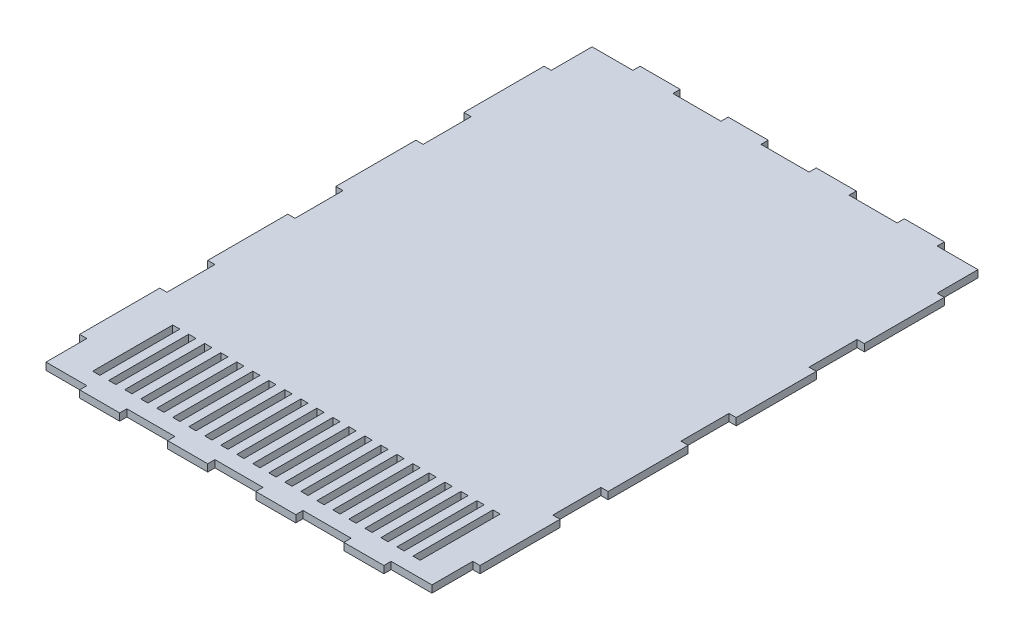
ISO-10303-21;
HEADER;
FILE_DESCRIPTION(('STEP AP214'),'2;1');
FILE_NAME('part.step','',(''),(''),'','','');
FILE_SCHEMA(('AUTOMOTIVE_DESIGN { 1 0 10303 214 1 1 1 1 }'));
ENDSEC;
DATA;
#1=APPLICATION_CONTEXT('core data for automotive mechanical design processes');
#2=APPLICATION_PROTOCOL_DEFINITION('international standard','automotive_design',2000,#1);
#3=PRODUCT_CONTEXT('',#1,'mechanical');
#4=PRODUCT('Part','Part','',(#3));
#5=PRODUCT_RELATED_PRODUCT_CATEGORY('part','',(#4));
#6=PRODUCT_DEFINITION_FORMATION('','',#4);
#7=PRODUCT_DEFINITION_CONTEXT('part definition',#1,'design');
#8=PRODUCT_DEFINITION('design','',#6,#7);
#9=PRODUCT_DEFINITION_SHAPE('','',#8);
#10=(LENGTH_UNIT() NAMED_UNIT(*) SI_UNIT(.MILLI.,.METRE.));
#11=(NAMED_UNIT(*) PLANE_ANGLE_UNIT() SI_UNIT($,.RADIAN.));
#12=(NAMED_UNIT(*) SI_UNIT($,.STERADIAN.) SOLID_ANGLE_UNIT());
#13=UNCERTAINTY_MEASURE_WITH_UNIT(LENGTH_MEASURE(1.E-05),#10,'distance_accuracy_value','');
#14=(GEOMETRIC_REPRESENTATION_CONTEXT(3) GLOBAL_UNCERTAINTY_ASSIGNED_CONTEXT((#13)) GLOBAL_UNIT_ASSIGNED_CONTEXT((#10,
#11,#12)) REPRESENTATION_CONTEXT('',''));
#15=CARTESIAN_POINT('',(0.,0.,0.));
#16=DIRECTION('',(0.,0.,1.));
#17=DIRECTION('',(1.,0.,0.));
#18=AXIS2_PLACEMENT_3D('',#15,#16,#17);
#19=CARTESIAN_POINT('',(241.,9.,-341.));
#20=DIRECTION('',(-1.,0.,0.));
#21=DIRECTION('',(0.,0.,1.));
#22=AXIS2_PLACEMENT_3D('',#19,#20,#21);
#23=PLANE('',#22);
#24=DIRECTION('',(0.,0.,-1.));
#25=VECTOR('',#24,1.);
#26=CARTESIAN_POINT('',(241.,9.,-341.));
#27=LINE('',#26,#25);
#28=CARTESIAN_POINT('',(241.,9.,190.));
#29=VERTEX_POINT('',#28);
#30=CARTESIAN_POINT('',(241.,9.,130.));
#31=VERTEX_POINT('',#30);
#32=EDGE_CURVE('E2471',#29,#31,#27,.T.);
#33=ORIENTED_EDGE('',*,*,#32,.F.);
#34=DIRECTION('',(0.,1.,0.));
#35=VECTOR('',#34,1.);
#36=CARTESIAN_POINT('',(241.000000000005,-100.404183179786,190.));
#37=LINE('',#36,#35);
#38=CARTESIAN_POINT('',(241.000000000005,0.,190.));
#39=VERTEX_POINT('',#38);
#40=EDGE_CURVE('E1902',#39,#29,#37,.T.);
#41=ORIENTED_EDGE('',*,*,#40,.F.);
#42=DIRECTION('',(0.,0.,-1.));
#43=VECTOR('',#42,1.);
#44=CARTESIAN_POINT('',(241.,0.,-341.));
#45=LINE('',#44,#43);
#46=CARTESIAN_POINT('',(241.,0.,130.));
#47=VERTEX_POINT('',#46);
#48=EDGE_CURVE('E2496',#39,#47,#45,.T.);
#49=ORIENTED_EDGE('',*,*,#48,.T.);
#50=DIRECTION('',(0.,1.,0.));
#51=VECTOR('',#50,1.);
#52=CARTESIAN_POINT('',(241.000000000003,-100.404183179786,130.));
#53=LINE('',#52,#51);
#54=EDGE_CURVE('E1987',#47,#31,#53,.T.);
#55=ORIENTED_EDGE('',*,*,#54,.T.);
#56=EDGE_LOOP('',(#33,#41,#49,#55));
#57=FACE_BOUND('',#56,.T.);
#58=ADVANCED_FACE('F38',(#57),#23,.F.);
#59=CARTESIAN_POINT('',(-241.,9.,341.));
#60=DIRECTION('',(1.,0.,0.));
#61=DIRECTION('',(0.,0.,-1.));
#62=AXIS2_PLACEMENT_3D('',#59,#60,#61);
#63=PLANE('',#62);
#64=DIRECTION('',(0.,0.,1.));
#65=VECTOR('',#64,1.);
#66=CARTESIAN_POINT('',(-241.,0.,341.));
#67=LINE('',#66,#65);
#68=CARTESIAN_POINT('',(-240.999999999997,0.,130.));
#69=VERTEX_POINT('',#68);
#70=CARTESIAN_POINT('',(-241.,0.,190.));
#71=VERTEX_POINT('',#70);
#72=EDGE_CURVE('E2606',#69,#71,#67,.T.);
#73=ORIENTED_EDGE('',*,*,#72,.T.);
#74=DIRECTION('',(0.,1.,0.));
#75=VECTOR('',#74,1.);
#76=CARTESIAN_POINT('',(-240.999999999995,-100.404183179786,190.));
#77=LINE('',#76,#75);
#78=CARTESIAN_POINT('',(-241.,9.,190.));
#79=VERTEX_POINT('',#78);
#80=EDGE_CURVE('E1937',#71,#79,#77,.T.);
#81=ORIENTED_EDGE('',*,*,#80,.T.);
#82=DIRECTION('',(0.,0.,1.));
#83=VECTOR('',#82,1.);
#84=CARTESIAN_POINT('',(-241.,9.,341.));
#85=LINE('',#84,#83);
#86=CARTESIAN_POINT('',(-241.,9.,130.));
#87=VERTEX_POINT('',#86);
#88=EDGE_CURVE('E4489',#87,#79,#85,.T.);
#89=ORIENTED_EDGE('',*,*,#88,.F.);
#90=DIRECTION('',(0.,1.,0.));
#91=VECTOR('',#90,1.);
#92=CARTESIAN_POINT('',(-240.999999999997,-100.404183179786,130.));
#93=LINE('',#92,#91);
#94=EDGE_CURVE('E2027',#69,#87,#93,.T.);
#95=ORIENTED_EDGE('',*,*,#94,.F.);
#96=EDGE_LOOP('',(#73,#81,#89,#95));
#97=FACE_BOUND('',#96,.T.);
#98=ADVANCED_FACE('F2714',(#97),#63,.F.);
#99=CARTESIAN_POINT('',(241.,9.,29.9999999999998));
#100=VERTEX_POINT('',#99);
#101=CARTESIAN_POINT('',(241.,9.,-30.0000000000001));
#102=VERTEX_POINT('',#101);
#103=EDGE_CURVE('E2619',#100,#102,#27,.T.);
#104=ORIENTED_EDGE('',*,*,#103,.F.);
#105=DIRECTION('',(0.,1.,0.));
#106=VECTOR('',#105,1.);
#107=CARTESIAN_POINT('',(241.000000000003,-100.404183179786,29.9999999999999));
#108=LINE('',#107,#106);
#109=CARTESIAN_POINT('',(241.000000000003,0.,29.9999999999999));
#110=VERTEX_POINT('',#109);
#111=EDGE_CURVE('E1972',#110,#100,#108,.T.);
#112=ORIENTED_EDGE('',*,*,#111,.F.);
#113=CARTESIAN_POINT('',(241.,0.,-30.0000000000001));
#114=VERTEX_POINT('',#113);
#115=EDGE_CURVE('E2642',#110,#114,#45,.T.);
#116=ORIENTED_EDGE('',*,*,#115,.T.);
#117=DIRECTION('',(0.,1.,0.));
#118=VECTOR('',#117,1.);
#119=CARTESIAN_POINT('',(241.000000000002,-100.404183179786,-30.0000000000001));
#120=LINE('',#119,#118);
#121=EDGE_CURVE('E2058',#114,#102,#120,.T.);
#122=ORIENTED_EDGE('',*,*,#121,.T.);
#123=EDGE_LOOP('',(#104,#112,#116,#122));
#124=FACE_BOUND('',#123,.T.);
#125=ADVANCED_FACE('F2641',(#124),#23,.F.);
#126=CARTESIAN_POINT('',(-240.999999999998,0.,-30.0000000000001));
#127=VERTEX_POINT('',#126);
#128=CARTESIAN_POINT('',(-241.,0.,30.));
#129=VERTEX_POINT('',#128);
#130=EDGE_CURVE('E2608',#127,#129,#67,.T.);
#131=ORIENTED_EDGE('',*,*,#130,.T.);
#132=DIRECTION('',(0.,1.,0.));
#133=VECTOR('',#132,1.);
#134=CARTESIAN_POINT('',(-240.999999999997,-100.404183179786,29.9999999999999));
#135=LINE('',#134,#133);
#136=CARTESIAN_POINT('',(-241.,9.,30.));
#137=VERTEX_POINT('',#136);
#138=EDGE_CURVE('E2008',#129,#137,#135,.T.);
#139=ORIENTED_EDGE('',*,*,#138,.T.);
#140=CARTESIAN_POINT('',(-241.,9.,-29.9999999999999));
#141=VERTEX_POINT('',#140);
#142=EDGE_CURVE('E4486',#141,#137,#85,.T.);
#143=ORIENTED_EDGE('',*,*,#142,.F.);
#144=DIRECTION('',(0.,1.,0.));
#145=VECTOR('',#144,1.);
#146=CARTESIAN_POINT('',(-240.999999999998,-100.404183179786,-30.0000000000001));
#147=LINE('',#146,#145);
#148=EDGE_CURVE('E2098',#127,#141,#147,.T.);
#149=ORIENTED_EDGE('',*,*,#148,.F.);
#150=EDGE_LOOP('',(#131,#139,#143,#149));
#151=FACE_BOUND('',#150,.T.);
#152=ADVANCED_FACE('F2720',(#151),#63,.F.);
#153=CARTESIAN_POINT('',(241.,9.,-130.));
#154=VERTEX_POINT('',#153);
#155=CARTESIAN_POINT('',(241.,9.,-190.));
#156=VERTEX_POINT('',#155);
#157=EDGE_CURVE('E2617',#154,#156,#27,.T.);
#158=ORIENTED_EDGE('',*,*,#157,.F.);
#159=DIRECTION('',(0.,1.,0.));
#160=VECTOR('',#159,1.);
#161=CARTESIAN_POINT('',(241.000000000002,-100.404183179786,-130.));
#162=LINE('',#161,#160);
#163=CARTESIAN_POINT('',(241.000000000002,0.,-130.));
#164=VERTEX_POINT('',#163);
#165=EDGE_CURVE('E2043',#164,#154,#162,.T.);
#166=ORIENTED_EDGE('',*,*,#165,.F.);
#167=CARTESIAN_POINT('',(241.,0.,-190.));
#168=VERTEX_POINT('',#167);
#169=EDGE_CURVE('E2663',#164,#168,#45,.T.);
#170=ORIENTED_EDGE('',*,*,#169,.T.);
#171=DIRECTION('',(0.,1.,0.));
#172=VECTOR('',#171,1.);
#173=CARTESIAN_POINT('',(241.,-100.404183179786,-190.));
#174=LINE('',#173,#172);
#175=EDGE_CURVE('E2129',#168,#156,#174,.T.);
#176=ORIENTED_EDGE('',*,*,#175,.T.);
#177=EDGE_LOOP('',(#158,#166,#170,#176));
#178=FACE_BOUND('',#177,.T.);
#179=ADVANCED_FACE('F2662',(#178),#23,.F.);
#180=CARTESIAN_POINT('',(-241.,0.,-190.));
#181=VERTEX_POINT('',#180);
#182=CARTESIAN_POINT('',(-241.,0.,-130.));
#183=VERTEX_POINT('',#182);
#184=EDGE_CURVE('E2506',#181,#183,#67,.T.);
#185=ORIENTED_EDGE('',*,*,#184,.T.);
#186=DIRECTION('',(0.,1.,0.));
#187=VECTOR('',#186,1.);
#188=CARTESIAN_POINT('',(-240.999999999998,-100.404183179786,-130.));
#189=LINE('',#188,#187);
#190=CARTESIAN_POINT('',(-241.,9.,-130.));
#191=VERTEX_POINT('',#190);
#192=EDGE_CURVE('E2079',#183,#191,#189,.T.);
#193=ORIENTED_EDGE('',*,*,#192,.T.);
#194=CARTESIAN_POINT('',(-241.,9.,-190.));
#195=VERTEX_POINT('',#194);
#196=EDGE_CURVE('E2484',#195,#191,#85,.T.);
#197=ORIENTED_EDGE('',*,*,#196,.F.);
#198=DIRECTION('',(0.,1.,0.));
#199=VECTOR('',#198,1.);
#200=CARTESIAN_POINT('',(-241.,-100.404183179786,-190.));
#201=LINE('',#200,#199);
#202=EDGE_CURVE('E2150',#181,#195,#201,.T.);
#203=ORIENTED_EDGE('',*,*,#202,.F.);
#204=EDGE_LOOP('',(#185,#193,#197,#203));
#205=FACE_BOUND('',#204,.T.);
#206=ADVANCED_FACE('F2730',(#205),#63,.F.);
#207=DIRECTION('',(0.,1.,0.));
#208=VECTOR('',#207,1.);
#209=CARTESIAN_POINT('',(241.,-100.404183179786,-290.));
#210=LINE('',#209,#208);
#211=CARTESIAN_POINT('',(241.,0.,-290.));
#212=VERTEX_POINT('',#211);
#213=CARTESIAN_POINT('',(241.,9.,-290.));
#214=VERTEX_POINT('',#213);
#215=EDGE_CURVE('E2114',#212,#214,#210,.T.);
#216=ORIENTED_EDGE('',*,*,#215,.F.);
#217=CARTESIAN_POINT('',(241.,0.,-341.));
#218=VERTEX_POINT('',#217);
#219=EDGE_CURVE('E2441',#212,#218,#45,.T.);
#220=ORIENTED_EDGE('',*,*,#219,.T.);
#221=DIRECTION('',(0.,-1.,0.));
#222=VECTOR('',#221,1.);
#223=CARTESIAN_POINT('',(241.,9.,-341.));
#224=LINE('',#223,#222);
#225=CARTESIAN_POINT('',(241.,9.,-341.));
#226=VERTEX_POINT('',#225);
#227=EDGE_CURVE('E11',#226,#218,#224,.T.);
#228=ORIENTED_EDGE('',*,*,#227,.F.);
#229=EDGE_CURVE('E2472',#214,#226,#27,.T.);
#230=ORIENTED_EDGE('',*,*,#229,.F.);
#231=EDGE_LOOP('',(#216,#220,#228,#230));
#232=FACE_BOUND('',#231,.T.);
#233=ADVANCED_FACE('F2679',(#232),#23,.F.);
#234=CARTESIAN_POINT('',(-241.,9.,290.));
#235=VERTEX_POINT('',#234);
#236=CARTESIAN_POINT('',(-241.,9.,341.));
#237=VERTEX_POINT('',#236);
#238=EDGE_CURVE('E2477',#235,#237,#85,.T.);
#239=ORIENTED_EDGE('',*,*,#238,.F.);
#240=DIRECTION('',(0.,1.,0.));
#241=VECTOR('',#240,1.);
#242=CARTESIAN_POINT('',(-240.999999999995,-100.404183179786,290.));
#243=LINE('',#242,#241);
#244=CARTESIAN_POINT('',(-240.999999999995,0.,290.));
#245=VERTEX_POINT('',#244);
#246=EDGE_CURVE('E1956',#245,#235,#243,.T.);
#247=ORIENTED_EDGE('',*,*,#246,.F.);
#248=CARTESIAN_POINT('',(-241.,0.,341.));
#249=VERTEX_POINT('',#248);
#250=EDGE_CURVE('E2500',#245,#249,#67,.T.);
#251=ORIENTED_EDGE('',*,*,#250,.T.);
#252=DIRECTION('',(0.,-1.,0.));
#253=VECTOR('',#252,1.);
#254=CARTESIAN_POINT('',(-241.,9.,341.));
#255=LINE('',#254,#253);
#256=EDGE_CURVE('E2515',#237,#249,#255,.T.);
#257=ORIENTED_EDGE('',*,*,#256,.F.);
#258=EDGE_LOOP('',(#239,#247,#251,#257));
#259=FACE_BOUND('',#258,.T.);
#260=ADVANCED_FACE('F2729',(#259),#63,.F.);
#261=CARTESIAN_POINT('',(-241.,9.,341.));
#262=DIRECTION('',(0.,0.,-1.));
#263=DIRECTION('',(-1.,0.,0.));
#264=AXIS2_PLACEMENT_3D('',#261,#262,#263);
#265=PLANE('',#264);
#266=DIRECTION('',(1.,0.,0.));
#267=VECTOR('',#266,1.);
#268=CARTESIAN_POINT('',(-241.,0.,341.));
#269=LINE('',#268,#267);
#270=CARTESIAN_POINT('',(-140.000000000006,0.,341.));
#271=VERTEX_POINT('',#270);
#272=CARTESIAN_POINT('',(-80.0000000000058,0.,341.));
#273=VERTEX_POINT('',#272);
#274=EDGE_CURVE('E2510',#271,#273,#269,.T.);
#275=ORIENTED_EDGE('',*,*,#274,.T.);
#276=DIRECTION('',(0.,1.,0.));
#277=VECTOR('',#276,1.);
#278=CARTESIAN_POINT('',(-80.0000000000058,-50.8035431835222,341.));
#279=LINE('',#278,#277);
#280=CARTESIAN_POINT('',(-80.0000000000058,9.,341.));
#281=VERTEX_POINT('',#280);
#282=EDGE_CURVE('E2185',#273,#281,#279,.T.);
#283=ORIENTED_EDGE('',*,*,#282,.T.);
#284=DIRECTION('',(1.,0.,0.));
#285=VECTOR('',#284,1.);
#286=CARTESIAN_POINT('',(-241.,9.,341.));
#287=LINE('',#286,#285);
#288=CARTESIAN_POINT('',(-140.000000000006,9.,341.));
#289=VERTEX_POINT('',#288);
#290=EDGE_CURVE('E2490',#289,#281,#287,.T.);
#291=ORIENTED_EDGE('',*,*,#290,.F.);
#292=DIRECTION('',(0.,1.,0.));
#293=VECTOR('',#292,1.);
#294=CARTESIAN_POINT('',(-140.000000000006,-50.8035431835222,341.));
#295=LINE('',#294,#293);
#296=EDGE_CURVE('E2311',#271,#289,#295,.T.);
#297=ORIENTED_EDGE('',*,*,#296,.F.);
#298=EDGE_LOOP('',(#275,#283,#291,#297));
#299=FACE_BOUND('',#298,.T.);
#300=ADVANCED_FACE('F2735',(#299),#265,.F.);
#301=CARTESIAN_POINT('',(-30.0000000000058,9.,341.));
#302=VERTEX_POINT('',#301);
#303=CARTESIAN_POINT('',(29.9999999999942,9.,341.));
#304=VERTEX_POINT('',#303);
#305=EDGE_CURVE('E2491',#302,#304,#287,.T.);
#306=ORIENTED_EDGE('',*,*,#305,.F.);
#307=DIRECTION('',(0.,1.,0.));
#308=VECTOR('',#307,1.);
#309=CARTESIAN_POINT('',(-30.0000000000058,-50.8035431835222,341.));
#310=LINE('',#309,#308);
#311=CARTESIAN_POINT('',(-30.0000000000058,0.,341.));
#312=VERTEX_POINT('',#311);
#313=EDGE_CURVE('E2204',#312,#302,#310,.T.);
#314=ORIENTED_EDGE('',*,*,#313,.F.);
#315=CARTESIAN_POINT('',(29.9999999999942,0.,341.));
#316=VERTEX_POINT('',#315);
#317=EDGE_CURVE('E2511',#312,#316,#269,.T.);
#318=ORIENTED_EDGE('',*,*,#317,.T.);
#319=DIRECTION('',(0.,1.,0.));
#320=VECTOR('',#319,1.);
#321=CARTESIAN_POINT('',(29.9999999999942,-50.8035431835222,341.));
#322=LINE('',#321,#320);
#323=EDGE_CURVE('E2220',#316,#304,#322,.T.);
#324=ORIENTED_EDGE('',*,*,#323,.T.);
#325=EDGE_LOOP('',(#306,#314,#318,#324));
#326=FACE_BOUND('',#325,.T.);
#327=ADVANCED_FACE('F4395',(#326),#265,.F.);
#328=CARTESIAN_POINT('',(79.9999999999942,9.,341.));
#329=VERTEX_POINT('',#328);
#330=CARTESIAN_POINT('',(139.999999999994,9.,341.));
#331=VERTEX_POINT('',#330);
#332=EDGE_CURVE('E4446',#329,#331,#287,.T.);
#333=ORIENTED_EDGE('',*,*,#332,.F.);
#334=DIRECTION('',(0.,1.,0.));
#335=VECTOR('',#334,1.);
#336=CARTESIAN_POINT('',(79.9999999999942,-50.8035431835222,341.));
#337=LINE('',#336,#335);
#338=CARTESIAN_POINT('',(79.9999999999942,0.,341.));
#339=VERTEX_POINT('',#338);
#340=EDGE_CURVE('E2240',#339,#329,#337,.T.);
#341=ORIENTED_EDGE('',*,*,#340,.F.);
#342=CARTESIAN_POINT('',(139.999999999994,0.,341.));
#343=VERTEX_POINT('',#342);
#344=EDGE_CURVE('E2612',#339,#343,#269,.T.);
#345=ORIENTED_EDGE('',*,*,#344,.T.);
#346=DIRECTION('',(0.,1.,0.));
#347=VECTOR('',#346,1.);
#348=CARTESIAN_POINT('',(139.999999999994,-50.8035431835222,341.));
#349=LINE('',#348,#347);
#350=EDGE_CURVE('E2256',#343,#331,#349,.T.);
#351=ORIENTED_EDGE('',*,*,#350,.T.);
#352=EDGE_LOOP('',(#333,#341,#345,#351));
#353=FACE_BOUND('',#352,.T.);
#354=ADVANCED_FACE('F4387',(#353),#265,.F.);
#355=CARTESIAN_POINT('',(189.999999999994,9.,341.));
#356=VERTEX_POINT('',#355);
#357=CARTESIAN_POINT('',(241.,9.,341.));
#358=VERTEX_POINT('',#357);
#359=EDGE_CURVE('E2483',#356,#358,#287,.T.);
#360=ORIENTED_EDGE('',*,*,#359,.F.);
#361=DIRECTION('',(0.,1.,0.));
#362=VECTOR('',#361,1.);
#363=CARTESIAN_POINT('',(189.999999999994,-50.8035431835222,341.));
#364=LINE('',#363,#362);
#365=CARTESIAN_POINT('',(189.999999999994,0.,341.));
#366=VERTEX_POINT('',#365);
#367=EDGE_CURVE('E2276',#366,#356,#364,.T.);
#368=ORIENTED_EDGE('',*,*,#367,.F.);
#369=CARTESIAN_POINT('',(241.,0.,341.));
#370=VERTEX_POINT('',#369);
#371=EDGE_CURVE('E2505',#366,#370,#269,.T.);
#372=ORIENTED_EDGE('',*,*,#371,.T.);
#373=DIRECTION('',(0.,-1.,0.));
#374=VECTOR('',#373,1.);
#375=CARTESIAN_POINT('',(241.,9.,341.));
#376=LINE('',#375,#374);
#377=EDGE_CURVE('E2489',#358,#370,#376,.T.);
#378=ORIENTED_EDGE('',*,*,#377,.F.);
#379=EDGE_LOOP('',(#360,#368,#372,#378));
#380=FACE_BOUND('',#379,.T.);
#381=ADVANCED_FACE('F2751',(#380),#265,.F.);
#382=CARTESIAN_POINT('',(-241.,9.,-341.));
#383=DIRECTION('',(0.,0.,1.));
#384=DIRECTION('',(1.,0.,0.));
#385=AXIS2_PLACEMENT_3D('',#382,#383,#384);
#386=PLANE('',#385);
#387=DIRECTION('',(-1.,0.,0.));
#388=VECTOR('',#387,1.);
#389=CARTESIAN_POINT('',(-241.,9.,-341.));
#390=LINE('',#389,#388);
#391=CARTESIAN_POINT('',(139.999999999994,9.,-341.));
#392=VERTEX_POINT('',#391);
#393=CARTESIAN_POINT('',(79.9999999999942,9.,-341.));
#394=VERTEX_POINT('',#393);
#395=EDGE_CURVE('E2478',#392,#394,#390,.T.);
#396=ORIENTED_EDGE('',*,*,#395,.F.);
#397=DIRECTION('',(0.,1.,0.));
#398=VECTOR('',#397,1.);
#399=CARTESIAN_POINT('',(139.999999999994,-50.8035431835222,-341.));
#400=LINE('',#399,#398);
#401=CARTESIAN_POINT('',(139.999999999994,0.,-341.));
#402=VERTEX_POINT('',#401);
#403=EDGE_CURVE('E2327',#402,#392,#400,.T.);
#404=ORIENTED_EDGE('',*,*,#403,.F.);
#405=DIRECTION('',(-1.,0.,0.));
#406=VECTOR('',#405,1.);
#407=CARTESIAN_POINT('',(-241.,0.,-341.));
#408=LINE('',#407,#406);
#409=CARTESIAN_POINT('',(79.9999999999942,0.,-341.));
#410=VERTEX_POINT('',#409);
#411=EDGE_CURVE('E2501',#402,#410,#408,.T.);
#412=ORIENTED_EDGE('',*,*,#411,.T.);
#413=DIRECTION('',(0.,1.,0.));
#414=VECTOR('',#413,1.);
#415=CARTESIAN_POINT('',(79.9999999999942,-50.8035431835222,-341.));
#416=LINE('',#415,#414);
#417=EDGE_CURVE('E2377',#410,#394,#416,.T.);
#418=ORIENTED_EDGE('',*,*,#417,.T.);
#419=EDGE_LOOP('',(#396,#404,#412,#418));
#420=FACE_BOUND('',#419,.T.);
#421=ADVANCED_FACE('F2551',(#420),#386,.F.);
#422=CARTESIAN_POINT('',(29.9999999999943,9.,-341.));
#423=VERTEX_POINT('',#422);
#424=CARTESIAN_POINT('',(-30.0000000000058,9.,-341.));
#425=VERTEX_POINT('',#424);
#426=EDGE_CURVE('E2543',#423,#425,#390,.T.);
#427=ORIENTED_EDGE('',*,*,#426,.F.);
#428=DIRECTION('',(0.,1.,0.));
#429=VECTOR('',#428,1.);
#430=CARTESIAN_POINT('',(29.9999999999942,-50.8035431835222,-341.));
#431=LINE('',#430,#429);
#432=CARTESIAN_POINT('',(29.9999999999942,0.,-341.));
#433=VERTEX_POINT('',#432);
#434=EDGE_CURVE('E2362',#433,#423,#431,.T.);
#435=ORIENTED_EDGE('',*,*,#434,.F.);
#436=CARTESIAN_POINT('',(-30.0000000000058,0.,-341.));
#437=VERTEX_POINT('',#436);
#438=EDGE_CURVE('E2568',#433,#437,#408,.T.);
#439=ORIENTED_EDGE('',*,*,#438,.T.);
#440=DIRECTION('',(0.,1.,0.));
#441=VECTOR('',#440,1.);
#442=CARTESIAN_POINT('',(-30.0000000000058,-50.8035431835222,-341.));
#443=LINE('',#442,#441);
#444=EDGE_CURVE('E2413',#437,#425,#443,.T.);
#445=ORIENTED_EDGE('',*,*,#444,.T.);
#446=EDGE_LOOP('',(#427,#435,#439,#445));
#447=FACE_BOUND('',#446,.T.);
#448=ADVANCED_FACE('F2567',(#447),#386,.F.);
#449=CARTESIAN_POINT('',(-80.0000000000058,9.,-341.));
#450=VERTEX_POINT('',#449);
#451=CARTESIAN_POINT('',(-140.000000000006,9.,-341.));
#452=VERTEX_POINT('',#451);
#453=EDGE_CURVE('E2541',#450,#452,#390,.T.);
#454=ORIENTED_EDGE('',*,*,#453,.F.);
#455=DIRECTION('',(0.,1.,0.));
#456=VECTOR('',#455,1.);
#457=CARTESIAN_POINT('',(-80.0000000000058,-50.8035431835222,-341.));
#458=LINE('',#457,#456);
#459=CARTESIAN_POINT('',(-80.0000000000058,0.,-341.));
#460=VERTEX_POINT('',#459);
#461=EDGE_CURVE('E2398',#460,#450,#458,.T.);
#462=ORIENTED_EDGE('',*,*,#461,.F.);
#463=CARTESIAN_POINT('',(-140.000000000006,0.,-341.));
#464=VERTEX_POINT('',#463);
#465=EDGE_CURVE('E2585',#460,#464,#408,.T.);
#466=ORIENTED_EDGE('',*,*,#465,.T.);
#467=DIRECTION('',(0.,1.,0.));
#468=VECTOR('',#467,1.);
#469=CARTESIAN_POINT('',(-140.000000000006,-50.8035431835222,-341.));
#470=LINE('',#469,#468);
#471=EDGE_CURVE('E2459',#464,#452,#470,.T.);
#472=ORIENTED_EDGE('',*,*,#471,.T.);
#473=EDGE_LOOP('',(#454,#462,#466,#472));
#474=FACE_BOUND('',#473,.T.);
#475=ADVANCED_FACE('F2584',(#474),#386,.F.);
#476=DIRECTION('',(0.,1.,0.));
#477=VECTOR('',#476,1.);
#478=CARTESIAN_POINT('',(-190.000000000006,-50.8035431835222,-341.));
#479=LINE('',#478,#477);
#480=CARTESIAN_POINT('',(-190.000000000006,0.,-341.));
#481=VERTEX_POINT('',#480);
#482=CARTESIAN_POINT('',(-190.000000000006,9.,-341.));
#483=VERTEX_POINT('',#482);
#484=EDGE_CURVE('E2453',#481,#483,#479,.T.);
#485=ORIENTED_EDGE('',*,*,#484,.F.);
#486=CARTESIAN_POINT('',(-241.,0.,-341.));
#487=VERTEX_POINT('',#486);
#488=EDGE_CURVE('E2495',#481,#487,#408,.T.);
#489=ORIENTED_EDGE('',*,*,#488,.T.);
#490=DIRECTION('',(0.,-1.,0.));
#491=VECTOR('',#490,1.);
#492=CARTESIAN_POINT('',(-241.,9.,-341.));
#493=LINE('',#492,#491);
#494=CARTESIAN_POINT('',(-241.,9.,-341.));
#495=VERTEX_POINT('',#494);
#496=EDGE_CURVE('E47',#495,#487,#493,.T.);
#497=ORIENTED_EDGE('',*,*,#496,.F.);
#498=EDGE_CURVE('E2470',#483,#495,#390,.T.);
#499=ORIENTED_EDGE('',*,*,#498,.F.);
#500=EDGE_LOOP('',(#485,#489,#497,#499));
#501=FACE_BOUND('',#500,.T.);
#502=ADVANCED_FACE('F2599',(#501),#386,.F.);
#503=CARTESIAN_POINT('',(241.,0.,290.));
#504=VERTEX_POINT('',#503);
#505=EDGE_CURVE('E2492',#370,#504,#45,.T.);
#506=ORIENTED_EDGE('',*,*,#505,.T.);
#507=DIRECTION('',(0.,1.,0.));
#508=VECTOR('',#507,1.);
#509=CARTESIAN_POINT('',(241.000000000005,-100.404183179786,290.));
#510=LINE('',#509,#508);
#511=CARTESIAN_POINT('',(241.,9.,290.));
#512=VERTEX_POINT('',#511);
#513=EDGE_CURVE('E1917',#504,#512,#510,.T.);
#514=ORIENTED_EDGE('',*,*,#513,.T.);
#515=EDGE_CURVE('E2466',#358,#512,#27,.T.);
#516=ORIENTED_EDGE('',*,*,#515,.F.);
#517=ORIENTED_EDGE('',*,*,#377,.T.);
#518=EDGE_LOOP('',(#506,#514,#516,#517));
#519=FACE_BOUND('',#518,.T.);
#520=ADVANCED_FACE('F40',(#519),#23,.F.);
#521=CARTESIAN_POINT('',(189.999999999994,0.,-341.));
#522=VERTEX_POINT('',#521);
#523=EDGE_CURVE('E2497',#218,#522,#408,.T.);
#524=ORIENTED_EDGE('',*,*,#523,.T.);
#525=DIRECTION('',(0.,1.,0.));
#526=VECTOR('',#525,1.);
#527=CARTESIAN_POINT('',(189.999999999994,-50.8035431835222,-341.));
#528=LINE('',#527,#526);
#529=CARTESIAN_POINT('',(189.999999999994,9.,-341.));
#530=VERTEX_POINT('',#529);
#531=EDGE_CURVE('E2342',#522,#530,#528,.T.);
#532=ORIENTED_EDGE('',*,*,#531,.T.);
#533=EDGE_CURVE('E2473',#226,#530,#390,.T.);
#534=ORIENTED_EDGE('',*,*,#533,.F.);
#535=ORIENTED_EDGE('',*,*,#227,.T.);
#536=EDGE_LOOP('',(#524,#532,#534,#535));
#537=FACE_BOUND('',#536,.T.);
#538=ADVANCED_FACE('F2690',(#537),#386,.F.);
#539=CARTESIAN_POINT('',(-241.,0.,-290.));
#540=VERTEX_POINT('',#539);
#541=EDGE_CURVE('E2502',#487,#540,#67,.T.);
#542=ORIENTED_EDGE('',*,*,#541,.T.);
#543=DIRECTION('',(0.,1.,0.));
#544=VECTOR('',#543,1.);
#545=CARTESIAN_POINT('',(-241.,-100.404183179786,-290.));
#546=LINE('',#545,#544);
#547=CARTESIAN_POINT('',(-241.,9.,-290.));
#548=VERTEX_POINT('',#547);
#549=EDGE_CURVE('E2165',#540,#548,#546,.T.);
#550=ORIENTED_EDGE('',*,*,#549,.T.);
#551=EDGE_CURVE('E2479',#495,#548,#85,.T.);
#552=ORIENTED_EDGE('',*,*,#551,.F.);
#553=ORIENTED_EDGE('',*,*,#496,.T.);
#554=EDGE_LOOP('',(#542,#550,#552,#553));
#555=FACE_BOUND('',#554,.T.);
#556=ADVANCED_FACE('F2524',(#555),#63,.F.);
#557=CARTESIAN_POINT('',(-190.000000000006,0.,341.));
#558=VERTEX_POINT('',#557);
#559=EDGE_CURVE('E2507',#249,#558,#269,.T.);
#560=ORIENTED_EDGE('',*,*,#559,.T.);
#561=DIRECTION('',(0.,1.,0.));
#562=VECTOR('',#561,1.);
#563=CARTESIAN_POINT('',(-190.000000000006,-50.8035431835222,341.));
#564=LINE('',#563,#562);
#565=CARTESIAN_POINT('',(-190.000000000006,9.,341.));
#566=VERTEX_POINT('',#565);
#567=EDGE_CURVE('E2292',#558,#566,#564,.T.);
#568=ORIENTED_EDGE('',*,*,#567,.T.);
#569=EDGE_CURVE('E2485',#237,#566,#287,.T.);
#570=ORIENTED_EDGE('',*,*,#569,.F.);
#571=ORIENTED_EDGE('',*,*,#256,.T.);
#572=EDGE_LOOP('',(#560,#568,#570,#571));
#573=FACE_BOUND('',#572,.T.);
#574=ADVANCED_FACE('F2747',(#573),#265,.F.);
#575=CARTESIAN_POINT('',(0.,9.,0.));
#576=DIRECTION('',(0.,1.,0.));
#577=DIRECTION('',(0.,0.,1.));
#578=AXIS2_PLACEMENT_3D('',#575,#576,#577);
#579=PLANE('',#578);
#580=DIRECTION('',(0.,0.,1.));
#581=VECTOR('',#580,1.);
#582=CARTESIAN_POINT('',(-202.,9.,221.733226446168));
#583=LINE('',#582,#581);
#584=CARTESIAN_POINT('',(-202.,9.,221.733226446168));
#585=VERTEX_POINT('',#584);
#586=CARTESIAN_POINT('',(-202.,9.,321.733226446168));
#587=VERTEX_POINT('',#586);
#588=EDGE_CURVE('E54',#585,#587,#583,.T.);
#589=ORIENTED_EDGE('',*,*,#588,.F.);
#590=DIRECTION('',(-1.,0.,0.));
#591=VECTOR('',#590,1.);
#592=CARTESIAN_POINT('',(-202.,9.,221.733226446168));
#593=LINE('',#592,#591);
#594=CARTESIAN_POINT('',(-193.,9.,221.733226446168));
#595=VERTEX_POINT('',#594);
#596=EDGE_CURVE('E992',#595,#585,#593,.T.);
#597=ORIENTED_EDGE('',*,*,#596,.F.);
#598=DIRECTION('',(0.,0.,-1.));
#599=VECTOR('',#598,1.);
#600=CARTESIAN_POINT('',(-193.,9.,221.733226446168));
#601=LINE('',#600,#599);
#602=CARTESIAN_POINT('',(-193.,9.,321.733226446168));
#603=VERTEX_POINT('',#602);
#604=EDGE_CURVE('E996',#603,#595,#601,.T.);
#605=ORIENTED_EDGE('',*,*,#604,.F.);
#606=DIRECTION('',(1.,0.,0.));
#607=VECTOR('',#606,1.);
#608=CARTESIAN_POINT('',(-202.,9.,321.733226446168));
#609=LINE('',#608,#607);
#610=EDGE_CURVE('E1005',#587,#603,#609,.T.);
#611=ORIENTED_EDGE('',*,*,#610,.F.);
#612=EDGE_LOOP('',(#589,#597,#605,#611));
#613=FACE_BOUND('',#612,.T.);
#614=DIRECTION('',(-1.,0.,0.));
#615=VECTOR('',#614,1.);
#616=CARTESIAN_POINT('',(-182.,9.,221.733226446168));
#617=LINE('',#616,#615);
#618=CARTESIAN_POINT('',(-173.,9.,221.733226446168));
#619=VERTEX_POINT('',#618);
#620=CARTESIAN_POINT('',(-182.,9.,221.733226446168));
#621=VERTEX_POINT('',#620);
#622=EDGE_CURVE('E62',#619,#621,#617,.T.);
#623=ORIENTED_EDGE('',*,*,#622,.F.);
#624=DIRECTION('',(0.,0.,-1.));
#625=VECTOR('',#624,1.);
#626=CARTESIAN_POINT('',(-173.,9.,221.733226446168));
#627=LINE('',#626,#625);
#628=CARTESIAN_POINT('',(-173.,9.,321.733226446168));
#629=VERTEX_POINT('',#628);
#630=EDGE_CURVE('E1026',#629,#619,#627,.T.);
#631=ORIENTED_EDGE('',*,*,#630,.F.);
#632=DIRECTION('',(1.,0.,0.));
#633=VECTOR('',#632,1.);
#634=CARTESIAN_POINT('',(-182.,9.,321.733226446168));
#635=LINE('',#634,#633);
#636=CARTESIAN_POINT('',(-182.,9.,321.733226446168));
#637=VERTEX_POINT('',#636);
#638=EDGE_CURVE('E1046',#637,#629,#635,.T.);
#639=ORIENTED_EDGE('',*,*,#638,.F.);
#640=DIRECTION('',(0.,0.,1.));
#641=VECTOR('',#640,1.);
#642=CARTESIAN_POINT('',(-182.,9.,221.733226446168));
#643=LINE('',#642,#641);
#644=EDGE_CURVE('E1041',#621,#637,#643,.T.);
#645=ORIENTED_EDGE('',*,*,#644,.F.);
#646=EDGE_LOOP('',(#623,#631,#639,#645));
#647=FACE_BOUND('',#646,.T.);
#648=DIRECTION('',(-1.,0.,0.));
#649=VECTOR('',#648,1.);
#650=CARTESIAN_POINT('',(-162.,9.,221.733226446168));
#651=LINE('',#650,#649);
#652=CARTESIAN_POINT('',(-153.,9.,221.733226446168));
#653=VERTEX_POINT('',#652);
#654=CARTESIAN_POINT('',(-162.,9.,221.733226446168));
#655=VERTEX_POINT('',#654);
#656=EDGE_CURVE('E1081',#653,#655,#651,.T.);
#657=ORIENTED_EDGE('',*,*,#656,.F.);
#658=DIRECTION('',(0.,0.,-1.));
#659=VECTOR('',#658,1.);
#660=CARTESIAN_POINT('',(-153.,9.,221.733226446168));
#661=LINE('',#660,#659);
#662=CARTESIAN_POINT('',(-153.,9.,321.733226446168));
#663=VERTEX_POINT('',#662);
#664=EDGE_CURVE('E1068',#663,#653,#661,.T.);
#665=ORIENTED_EDGE('',*,*,#664,.F.);
#666=DIRECTION('',(1.,0.,0.));
#667=VECTOR('',#666,1.);
#668=CARTESIAN_POINT('',(-162.,9.,321.733226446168));
#669=LINE('',#668,#667);
#670=CARTESIAN_POINT('',(-162.,9.,321.733226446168));
#671=VERTEX_POINT('',#670);
#672=EDGE_CURVE('E1089',#671,#663,#669,.T.);
#673=ORIENTED_EDGE('',*,*,#672,.F.);
#674=DIRECTION('',(0.,0.,1.));
#675=VECTOR('',#674,1.);
#676=CARTESIAN_POINT('',(-162.,9.,221.733226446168));
#677=LINE('',#676,#675);
#678=EDGE_CURVE('E1084',#655,#671,#677,.T.);
#679=ORIENTED_EDGE('',*,*,#678,.F.);
#680=EDGE_LOOP('',(#657,#665,#673,#679));
#681=FACE_BOUND('',#680,.T.);
#682=DIRECTION('',(-1.,0.,0.));
#683=VECTOR('',#682,1.);
#684=CARTESIAN_POINT('',(-142.,9.,221.733226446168));
#685=LINE('',#684,#683);
#686=CARTESIAN_POINT('',(-133.,9.,221.733226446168));
#687=VERTEX_POINT('',#686);
#688=CARTESIAN_POINT('',(-142.,9.,221.733226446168));
#689=VERTEX_POINT('',#688);
#690=EDGE_CURVE('E1125',#687,#689,#685,.T.);
#691=ORIENTED_EDGE('',*,*,#690,.F.);
#692=DIRECTION('',(0.,0.,-1.));
#693=VECTOR('',#692,1.);
#694=CARTESIAN_POINT('',(-133.,9.,221.733226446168));
#695=LINE('',#694,#693);
#696=CARTESIAN_POINT('',(-133.,9.,321.733226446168));
#697=VERTEX_POINT('',#696);
#698=EDGE_CURVE('E1112',#697,#687,#695,.T.);
#699=ORIENTED_EDGE('',*,*,#698,.F.);
#700=DIRECTION('',(1.,0.,0.));
#701=VECTOR('',#700,1.);
#702=CARTESIAN_POINT('',(-142.,9.,321.733226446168));
#703=LINE('',#702,#701);
#704=CARTESIAN_POINT('',(-142.,9.,321.733226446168));
#705=VERTEX_POINT('',#704);
#706=EDGE_CURVE('E1133',#705,#697,#703,.T.);
#707=ORIENTED_EDGE('',*,*,#706,.F.);
#708=DIRECTION('',(0.,0.,1.));
#709=VECTOR('',#708,1.);
#710=CARTESIAN_POINT('',(-142.,9.,221.733226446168));
#711=LINE('',#710,#709);
#712=EDGE_CURVE('E1128',#689,#705,#711,.T.);
#713=ORIENTED_EDGE('',*,*,#712,.F.);
#714=EDGE_LOOP('',(#691,#699,#707,#713));
#715=FACE_BOUND('',#714,.T.);
#716=DIRECTION('',(-1.,0.,0.));
#717=VECTOR('',#716,1.);
#718=CARTESIAN_POINT('',(-122.,9.,221.733226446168));
#719=LINE('',#718,#717);
#720=CARTESIAN_POINT('',(-113.,9.,221.733226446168));
#721=VERTEX_POINT('',#720);
#722=CARTESIAN_POINT('',(-122.,9.,221.733226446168));
#723=VERTEX_POINT('',#722);
#724=EDGE_CURVE('E1169',#721,#723,#719,.T.);
#725=ORIENTED_EDGE('',*,*,#724,.F.);
#726=DIRECTION('',(0.,0.,-1.));
#727=VECTOR('',#726,1.);
#728=CARTESIAN_POINT('',(-113.,9.,221.733226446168));
#729=LINE('',#728,#727);
#730=CARTESIAN_POINT('',(-113.,9.,321.733226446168));
#731=VERTEX_POINT('',#730);
#732=EDGE_CURVE('E1156',#731,#721,#729,.T.);
#733=ORIENTED_EDGE('',*,*,#732,.F.);
#734=DIRECTION('',(1.,0.,0.));
#735=VECTOR('',#734,1.);
#736=CARTESIAN_POINT('',(-122.,9.,321.733226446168));
#737=LINE('',#736,#735);
#738=CARTESIAN_POINT('',(-122.,9.,321.733226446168));
#739=VERTEX_POINT('',#738);
#740=EDGE_CURVE('E1177',#739,#731,#737,.T.);
#741=ORIENTED_EDGE('',*,*,#740,.F.);
#742=DIRECTION('',(0.,0.,1.));
#743=VECTOR('',#742,1.);
#744=CARTESIAN_POINT('',(-122.,9.,221.733226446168));
#745=LINE('',#744,#743);
#746=EDGE_CURVE('E1172',#723,#739,#745,.T.);
#747=ORIENTED_EDGE('',*,*,#746,.F.);
#748=EDGE_LOOP('',(#725,#733,#741,#747));
#749=FACE_BOUND('',#748,.T.);
#750=DIRECTION('',(-1.,0.,0.));
#751=VECTOR('',#750,1.);
#752=CARTESIAN_POINT('',(-102.,9.,221.733226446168));
#753=LINE('',#752,#751);
#754=CARTESIAN_POINT('',(-92.9999999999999,9.,221.733226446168));
#755=VERTEX_POINT('',#754);
#756=CARTESIAN_POINT('',(-102.,9.,221.733226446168));
#757=VERTEX_POINT('',#756);
#758=EDGE_CURVE('E1213',#755,#757,#753,.T.);
#759=ORIENTED_EDGE('',*,*,#758,.F.);
#760=DIRECTION('',(0.,0.,-1.));
#761=VECTOR('',#760,1.);
#762=CARTESIAN_POINT('',(-92.9999999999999,9.,221.733226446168));
#763=LINE('',#762,#761);
#764=CARTESIAN_POINT('',(-92.9999999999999,9.,321.733226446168));
#765=VERTEX_POINT('',#764);
#766=EDGE_CURVE('E1200',#765,#755,#763,.T.);
#767=ORIENTED_EDGE('',*,*,#766,.F.);
#768=DIRECTION('',(1.,0.,0.));
#769=VECTOR('',#768,1.);
#770=CARTESIAN_POINT('',(-102.,9.,321.733226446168));
#771=LINE('',#770,#769);
#772=CARTESIAN_POINT('',(-102.,9.,321.733226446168));
#773=VERTEX_POINT('',#772);
#774=EDGE_CURVE('E1221',#773,#765,#771,.T.);
#775=ORIENTED_EDGE('',*,*,#774,.F.);
#776=DIRECTION('',(0.,0.,1.));
#777=VECTOR('',#776,1.);
#778=CARTESIAN_POINT('',(-102.,9.,221.733226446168));
#779=LINE('',#778,#777);
#780=EDGE_CURVE('E1216',#757,#773,#779,.T.);
#781=ORIENTED_EDGE('',*,*,#780,.F.);
#782=EDGE_LOOP('',(#759,#767,#775,#781));
#783=FACE_BOUND('',#782,.T.);
#784=DIRECTION('',(-1.,0.,0.));
#785=VECTOR('',#784,1.);
#786=CARTESIAN_POINT('',(-81.9999999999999,9.,221.733226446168));
#787=LINE('',#786,#785);
#788=CARTESIAN_POINT('',(-72.9999999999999,9.,221.733226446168));
#789=VERTEX_POINT('',#788);
#790=CARTESIAN_POINT('',(-81.9999999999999,9.,221.733226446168));
#791=VERTEX_POINT('',#790);
#792=EDGE_CURVE('E1257',#789,#791,#787,.T.);
#793=ORIENTED_EDGE('',*,*,#792,.F.);
#794=DIRECTION('',(0.,0.,-1.));
#795=VECTOR('',#794,1.);
#796=CARTESIAN_POINT('',(-72.9999999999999,9.,221.733226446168));
#797=LINE('',#796,#795);
#798=CARTESIAN_POINT('',(-72.9999999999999,9.,321.733226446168));
#799=VERTEX_POINT('',#798);
#800=EDGE_CURVE('E1244',#799,#789,#797,.T.);
#801=ORIENTED_EDGE('',*,*,#800,.F.);
#802=DIRECTION('',(1.,0.,0.));
#803=VECTOR('',#802,1.);
#804=CARTESIAN_POINT('',(-81.9999999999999,9.,321.733226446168));
#805=LINE('',#804,#803);
#806=CARTESIAN_POINT('',(-81.9999999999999,9.,321.733226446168));
#807=VERTEX_POINT('',#806);
#808=EDGE_CURVE('E1265',#807,#799,#805,.T.);
#809=ORIENTED_EDGE('',*,*,#808,.F.);
#810=DIRECTION('',(0.,0.,1.));
#811=VECTOR('',#810,1.);
#812=CARTESIAN_POINT('',(-81.9999999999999,9.,221.733226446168));
#813=LINE('',#812,#811);
#814=EDGE_CURVE('E1260',#791,#807,#813,.T.);
#815=ORIENTED_EDGE('',*,*,#814,.F.);
#816=EDGE_LOOP('',(#793,#801,#809,#815));
#817=FACE_BOUND('',#816,.T.);
#818=DIRECTION('',(-1.,0.,0.));
#819=VECTOR('',#818,1.);
#820=CARTESIAN_POINT('',(-61.9999999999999,9.,221.733226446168));
#821=LINE('',#820,#819);
#822=CARTESIAN_POINT('',(-52.9999999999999,9.,221.733226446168));
#823=VERTEX_POINT('',#822);
#824=CARTESIAN_POINT('',(-61.9999999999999,9.,221.733226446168));
#825=VERTEX_POINT('',#824);
#826=EDGE_CURVE('E1301',#823,#825,#821,.T.);
#827=ORIENTED_EDGE('',*,*,#826,.F.);
#828=DIRECTION('',(0.,0.,-1.));
#829=VECTOR('',#828,1.);
#830=CARTESIAN_POINT('',(-52.9999999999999,9.,221.733226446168));
#831=LINE('',#830,#829);
#832=CARTESIAN_POINT('',(-52.9999999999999,9.,321.733226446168));
#833=VERTEX_POINT('',#832);
#834=EDGE_CURVE('E1288',#833,#823,#831,.T.);
#835=ORIENTED_EDGE('',*,*,#834,.F.);
#836=DIRECTION('',(1.,0.,0.));
#837=VECTOR('',#836,1.);
#838=CARTESIAN_POINT('',(-61.9999999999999,9.,321.733226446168));
#839=LINE('',#838,#837);
#840=CARTESIAN_POINT('',(-61.9999999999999,9.,321.733226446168));
#841=VERTEX_POINT('',#840);
#842=EDGE_CURVE('E1309',#841,#833,#839,.T.);
#843=ORIENTED_EDGE('',*,*,#842,.F.);
#844=DIRECTION('',(0.,0.,1.));
#845=VECTOR('',#844,1.);
#846=CARTESIAN_POINT('',(-61.9999999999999,9.,221.733226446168));
#847=LINE('',#846,#845);
#848=EDGE_CURVE('E1304',#825,#841,#847,.T.);
#849=ORIENTED_EDGE('',*,*,#848,.F.);
#850=EDGE_LOOP('',(#827,#835,#843,#849));
#851=FACE_BOUND('',#850,.T.);
#852=DIRECTION('',(-1.,0.,0.));
#853=VECTOR('',#852,1.);
#854=CARTESIAN_POINT('',(-41.9999999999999,9.,221.733226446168));
#855=LINE('',#854,#853);
#856=CARTESIAN_POINT('',(-32.9999999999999,9.,221.733226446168));
#857=VERTEX_POINT('',#856);
#858=CARTESIAN_POINT('',(-41.9999999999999,9.,221.733226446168));
#859=VERTEX_POINT('',#858);
#860=EDGE_CURVE('E1345',#857,#859,#855,.T.);
#861=ORIENTED_EDGE('',*,*,#860,.F.);
#862=DIRECTION('',(0.,0.,-1.));
#863=VECTOR('',#862,1.);
#864=CARTESIAN_POINT('',(-32.9999999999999,9.,221.733226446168));
#865=LINE('',#864,#863);
#866=CARTESIAN_POINT('',(-32.9999999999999,9.,321.733226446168));
#867=VERTEX_POINT('',#866);
#868=EDGE_CURVE('E1332',#867,#857,#865,.T.);
#869=ORIENTED_EDGE('',*,*,#868,.F.);
#870=DIRECTION('',(1.,0.,0.));
#871=VECTOR('',#870,1.);
#872=CARTESIAN_POINT('',(-41.9999999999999,9.,321.733226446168));
#873=LINE('',#872,#871);
#874=CARTESIAN_POINT('',(-41.9999999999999,9.,321.733226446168));
#875=VERTEX_POINT('',#874);
#876=EDGE_CURVE('E1353',#875,#867,#873,.T.);
#877=ORIENTED_EDGE('',*,*,#876,.F.);
#878=DIRECTION('',(0.,0.,1.));
#879=VECTOR('',#878,1.);
#880=CARTESIAN_POINT('',(-41.9999999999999,9.,221.733226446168));
#881=LINE('',#880,#879);
#882=EDGE_CURVE('E1348',#859,#875,#881,.T.);
#883=ORIENTED_EDGE('',*,*,#882,.F.);
#884=EDGE_LOOP('',(#861,#869,#877,#883));
#885=FACE_BOUND('',#884,.T.);
#886=DIRECTION('',(-1.,0.,0.));
#887=VECTOR('',#886,1.);
#888=CARTESIAN_POINT('',(-21.9999999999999,9.,221.733226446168));
#889=LINE('',#888,#887);
#890=CARTESIAN_POINT('',(-12.9999999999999,9.,221.733226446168));
#891=VERTEX_POINT('',#890);
#892=CARTESIAN_POINT('',(-21.9999999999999,9.,221.733226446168));
#893=VERTEX_POINT('',#892);
#894=EDGE_CURVE('E1389',#891,#893,#889,.T.);
#895=ORIENTED_EDGE('',*,*,#894,.F.);
#896=DIRECTION('',(0.,0.,-1.));
#897=VECTOR('',#896,1.);
#898=CARTESIAN_POINT('',(-12.9999999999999,9.,221.733226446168));
#899=LINE('',#898,#897);
#900=CARTESIAN_POINT('',(-12.9999999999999,9.,321.733226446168));
#901=VERTEX_POINT('',#900);
#902=EDGE_CURVE('E1376',#901,#891,#899,.T.);
#903=ORIENTED_EDGE('',*,*,#902,.F.);
#904=DIRECTION('',(1.,0.,0.));
#905=VECTOR('',#904,1.);
#906=CARTESIAN_POINT('',(-21.9999999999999,9.,321.733226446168));
#907=LINE('',#906,#905);
#908=CARTESIAN_POINT('',(-21.9999999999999,9.,321.733226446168));
#909=VERTEX_POINT('',#908);
#910=EDGE_CURVE('E1397',#909,#901,#907,.T.);
#911=ORIENTED_EDGE('',*,*,#910,.F.);
#912=DIRECTION('',(0.,0.,1.));
#913=VECTOR('',#912,1.);
#914=CARTESIAN_POINT('',(-21.9999999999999,9.,221.733226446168));
#915=LINE('',#914,#913);
#916=EDGE_CURVE('E1392',#893,#909,#915,.T.);
#917=ORIENTED_EDGE('',*,*,#916,.F.);
#918=EDGE_LOOP('',(#895,#903,#911,#917));
#919=FACE_BOUND('',#918,.T.);
#920=DIRECTION('',(-1.,0.,0.));
#921=VECTOR('',#920,1.);
#922=CARTESIAN_POINT('',(-1.99999999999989,9.,221.733226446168));
#923=LINE('',#922,#921);
#924=CARTESIAN_POINT('',(7.00000000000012,9.,221.733226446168));
#925=VERTEX_POINT('',#924);
#926=CARTESIAN_POINT('',(-1.99999999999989,9.,221.733226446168));
#927=VERTEX_POINT('',#926);
#928=EDGE_CURVE('E1433',#925,#927,#923,.T.);
#929=ORIENTED_EDGE('',*,*,#928,.F.);
#930=DIRECTION('',(0.,0.,-1.));
#931=VECTOR('',#930,1.);
#932=CARTESIAN_POINT('',(7.00000000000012,9.,221.733226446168));
#933=LINE('',#932,#931);
#934=CARTESIAN_POINT('',(7.00000000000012,9.,321.733226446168));
#935=VERTEX_POINT('',#934);
#936=EDGE_CURVE('E1420',#935,#925,#933,.T.);
#937=ORIENTED_EDGE('',*,*,#936,.F.);
#938=DIRECTION('',(1.,0.,0.));
#939=VECTOR('',#938,1.);
#940=CARTESIAN_POINT('',(-1.99999999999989,9.,321.733226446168));
#941=LINE('',#940,#939);
#942=CARTESIAN_POINT('',(-1.99999999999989,9.,321.733226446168));
#943=VERTEX_POINT('',#942);
#944=EDGE_CURVE('E1441',#943,#935,#941,.T.);
#945=ORIENTED_EDGE('',*,*,#944,.F.);
#946=DIRECTION('',(0.,0.,1.));
#947=VECTOR('',#946,1.);
#948=CARTESIAN_POINT('',(-1.99999999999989,9.,221.733226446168));
#949=LINE('',#948,#947);
#950=EDGE_CURVE('E1436',#927,#943,#949,.T.);
#951=ORIENTED_EDGE('',*,*,#950,.F.);
#952=EDGE_LOOP('',(#929,#937,#945,#951));
#953=FACE_BOUND('',#952,.T.);
#954=DIRECTION('',(-1.,0.,0.));
#955=VECTOR('',#954,1.);
#956=CARTESIAN_POINT('',(18.0000000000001,9.,221.733226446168));
#957=LINE('',#956,#955);
#958=CARTESIAN_POINT('',(27.0000000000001,9.,221.733226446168));
#959=VERTEX_POINT('',#958);
#960=CARTESIAN_POINT('',(18.0000000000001,9.,221.733226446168));
#961=VERTEX_POINT('',#960);
#962=EDGE_CURVE('E1477',#959,#961,#957,.T.);
#963=ORIENTED_EDGE('',*,*,#962,.F.);
#964=DIRECTION('',(0.,0.,-1.));
#965=VECTOR('',#964,1.);
#966=CARTESIAN_POINT('',(27.0000000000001,9.,221.733226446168));
#967=LINE('',#966,#965);
#968=CARTESIAN_POINT('',(27.0000000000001,9.,321.733226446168));
#969=VERTEX_POINT('',#968);
#970=EDGE_CURVE('E1464',#969,#959,#967,.T.);
#971=ORIENTED_EDGE('',*,*,#970,.F.);
#972=DIRECTION('',(1.,0.,0.));
#973=VECTOR('',#972,1.);
#974=CARTESIAN_POINT('',(18.0000000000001,9.,321.733226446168));
#975=LINE('',#974,#973);
#976=CARTESIAN_POINT('',(18.0000000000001,9.,321.733226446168));
#977=VERTEX_POINT('',#976);
#978=EDGE_CURVE('E1485',#977,#969,#975,.T.);
#979=ORIENTED_EDGE('',*,*,#978,.F.);
#980=DIRECTION('',(0.,0.,1.));
#981=VECTOR('',#980,1.);
#982=CARTESIAN_POINT('',(18.0000000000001,9.,221.733226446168));
#983=LINE('',#982,#981);
#984=EDGE_CURVE('E1480',#961,#977,#983,.T.);
#985=ORIENTED_EDGE('',*,*,#984,.F.);
#986=EDGE_LOOP('',(#963,#971,#979,#985));
#987=FACE_BOUND('',#986,.T.);
#988=DIRECTION('',(-1.,0.,0.));
#989=VECTOR('',#988,1.);
#990=CARTESIAN_POINT('',(38.0000000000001,9.,221.733226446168));
#991=LINE('',#990,#989);
#992=CARTESIAN_POINT('',(47.0000000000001,9.,221.733226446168));
#993=VERTEX_POINT('',#992);
#994=CARTESIAN_POINT('',(38.0000000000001,9.,221.733226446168));
#995=VERTEX_POINT('',#994);
#996=EDGE_CURVE('E1521',#993,#995,#991,.T.);
#997=ORIENTED_EDGE('',*,*,#996,.F.);
#998=DIRECTION('',(0.,0.,-1.));
#999=VECTOR('',#998,1.);
#1000=CARTESIAN_POINT('',(47.0000000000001,9.,221.733226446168));
#1001=LINE('',#1000,#999);
#1002=CARTESIAN_POINT('',(47.0000000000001,9.,321.733226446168));
#1003=VERTEX_POINT('',#1002);
#1004=EDGE_CURVE('E1508',#1003,#993,#1001,.T.);
#1005=ORIENTED_EDGE('',*,*,#1004,.F.);
#1006=DIRECTION('',(1.,0.,0.));
#1007=VECTOR('',#1006,1.);
#1008=CARTESIAN_POINT('',(38.0000000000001,9.,321.733226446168));
#1009=LINE('',#1008,#1007);
#1010=CARTESIAN_POINT('',(38.0000000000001,9.,321.733226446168));
#1011=VERTEX_POINT('',#1010);
#1012=EDGE_CURVE('E1529',#1011,#1003,#1009,.T.);
#1013=ORIENTED_EDGE('',*,*,#1012,.F.);
#1014=DIRECTION('',(0.,0.,1.));
#1015=VECTOR('',#1014,1.);
#1016=CARTESIAN_POINT('',(38.0000000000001,9.,221.733226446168));
#1017=LINE('',#1016,#1015);
#1018=EDGE_CURVE('E1524',#995,#1011,#1017,.T.);
#1019=ORIENTED_EDGE('',*,*,#1018,.F.);
#1020=EDGE_LOOP('',(#997,#1005,#1013,#1019));
#1021=FACE_BOUND('',#1020,.T.);
#1022=DIRECTION('',(-1.,0.,0.));
#1023=VECTOR('',#1022,1.);
#1024=CARTESIAN_POINT('',(58.0000000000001,9.,221.733226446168));
#1025=LINE('',#1024,#1023);
#1026=CARTESIAN_POINT('',(67.0000000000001,9.,221.733226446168));
#1027=VERTEX_POINT('',#1026);
#1028=CARTESIAN_POINT('',(58.0000000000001,9.,221.733226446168));
#1029=VERTEX_POINT('',#1028);
#1030=EDGE_CURVE('E1565',#1027,#1029,#1025,.T.);
#1031=ORIENTED_EDGE('',*,*,#1030,.F.);
#1032=DIRECTION('',(0.,0.,-1.));
#1033=VECTOR('',#1032,1.);
#1034=CARTESIAN_POINT('',(67.0000000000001,9.,221.733226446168));
#1035=LINE('',#1034,#1033);
#1036=CARTESIAN_POINT('',(67.0000000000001,9.,321.733226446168));
#1037=VERTEX_POINT('',#1036);
#1038=EDGE_CURVE('E1552',#1037,#1027,#1035,.T.);
#1039=ORIENTED_EDGE('',*,*,#1038,.F.);
#1040=DIRECTION('',(1.,0.,0.));
#1041=VECTOR('',#1040,1.);
#1042=CARTESIAN_POINT('',(58.0000000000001,9.,321.733226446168));
#1043=LINE('',#1042,#1041);
#1044=CARTESIAN_POINT('',(58.0000000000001,9.,321.733226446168));
#1045=VERTEX_POINT('',#1044);
#1046=EDGE_CURVE('E1573',#1045,#1037,#1043,.T.);
#1047=ORIENTED_EDGE('',*,*,#1046,.F.);
#1048=DIRECTION('',(0.,0.,1.));
#1049=VECTOR('',#1048,1.);
#1050=CARTESIAN_POINT('',(58.0000000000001,9.,221.733226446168));
#1051=LINE('',#1050,#1049);
#1052=EDGE_CURVE('E1568',#1029,#1045,#1051,.T.);
#1053=ORIENTED_EDGE('',*,*,#1052,.F.);
#1054=EDGE_LOOP('',(#1031,#1039,#1047,#1053));
#1055=FACE_BOUND('',#1054,.T.);
#1056=DIRECTION('',(-1.,0.,0.));
#1057=VECTOR('',#1056,1.);
#1058=CARTESIAN_POINT('',(78.0000000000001,9.,221.733226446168));
#1059=LINE('',#1058,#1057);
#1060=CARTESIAN_POINT('',(87.0000000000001,9.,221.733226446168));
#1061=VERTEX_POINT('',#1060);
#1062=CARTESIAN_POINT('',(78.0000000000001,9.,221.733226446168));
#1063=VERTEX_POINT('',#1062);
#1064=EDGE_CURVE('E1609',#1061,#1063,#1059,.T.);
#1065=ORIENTED_EDGE('',*,*,#1064,.F.);
#1066=DIRECTION('',(0.,0.,-1.));
#1067=VECTOR('',#1066,1.);
#1068=CARTESIAN_POINT('',(87.0000000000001,9.,221.733226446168));
#1069=LINE('',#1068,#1067);
#1070=CARTESIAN_POINT('',(87.0000000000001,9.,321.733226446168));
#1071=VERTEX_POINT('',#1070);
#1072=EDGE_CURVE('E1596',#1071,#1061,#1069,.T.);
#1073=ORIENTED_EDGE('',*,*,#1072,.F.);
#1074=DIRECTION('',(1.,0.,0.));
#1075=VECTOR('',#1074,1.);
#1076=CARTESIAN_POINT('',(78.0000000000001,9.,321.733226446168));
#1077=LINE('',#1076,#1075);
#1078=CARTESIAN_POINT('',(78.0000000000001,9.,321.733226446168));
#1079=VERTEX_POINT('',#1078);
#1080=EDGE_CURVE('E1617',#1079,#1071,#1077,.T.);
#1081=ORIENTED_EDGE('',*,*,#1080,.F.);
#1082=DIRECTION('',(0.,0.,1.));
#1083=VECTOR('',#1082,1.);
#1084=CARTESIAN_POINT('',(78.0000000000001,9.,221.733226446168));
#1085=LINE('',#1084,#1083);
#1086=EDGE_CURVE('E1612',#1063,#1079,#1085,.T.);
#1087=ORIENTED_EDGE('',*,*,#1086,.F.);
#1088=EDGE_LOOP('',(#1065,#1073,#1081,#1087));
#1089=FACE_BOUND('',#1088,.T.);
#1090=DIRECTION('',(-1.,0.,0.));
#1091=VECTOR('',#1090,1.);
#1092=CARTESIAN_POINT('',(98.0000000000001,9.,221.733226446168));
#1093=LINE('',#1092,#1091);
#1094=CARTESIAN_POINT('',(107.,9.,221.733226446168));
#1095=VERTEX_POINT('',#1094);
#1096=CARTESIAN_POINT('',(98.0000000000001,9.,221.733226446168));
#1097=VERTEX_POINT('',#1096);
#1098=EDGE_CURVE('E1653',#1095,#1097,#1093,.T.);
#1099=ORIENTED_EDGE('',*,*,#1098,.F.);
#1100=DIRECTION('',(0.,0.,-1.));
#1101=VECTOR('',#1100,1.);
#1102=CARTESIAN_POINT('',(107.,9.,221.733226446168));
#1103=LINE('',#1102,#1101);
#1104=CARTESIAN_POINT('',(107.,9.,321.733226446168));
#1105=VERTEX_POINT('',#1104);
#1106=EDGE_CURVE('E1640',#1105,#1095,#1103,.T.);
#1107=ORIENTED_EDGE('',*,*,#1106,.F.);
#1108=DIRECTION('',(1.,0.,0.));
#1109=VECTOR('',#1108,1.);
#1110=CARTESIAN_POINT('',(98.0000000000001,9.,321.733226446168));
#1111=LINE('',#1110,#1109);
#1112=CARTESIAN_POINT('',(98.0000000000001,9.,321.733226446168));
#1113=VERTEX_POINT('',#1112);
#1114=EDGE_CURVE('E1661',#1113,#1105,#1111,.T.);
#1115=ORIENTED_EDGE('',*,*,#1114,.F.);
#1116=DIRECTION('',(0.,0.,1.));
#1117=VECTOR('',#1116,1.);
#1118=CARTESIAN_POINT('',(98.0000000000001,9.,221.733226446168));
#1119=LINE('',#1118,#1117);
#1120=EDGE_CURVE('E1656',#1097,#1113,#1119,.T.);
#1121=ORIENTED_EDGE('',*,*,#1120,.F.);
#1122=EDGE_LOOP('',(#1099,#1107,#1115,#1121));
#1123=FACE_BOUND('',#1122,.T.);
#1124=DIRECTION('',(-1.,0.,0.));
#1125=VECTOR('',#1124,1.);
#1126=CARTESIAN_POINT('',(118.,9.,221.733226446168));
#1127=LINE('',#1126,#1125);
#1128=CARTESIAN_POINT('',(127.,9.,221.733226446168));
#1129=VERTEX_POINT('',#1128);
#1130=CARTESIAN_POINT('',(118.,9.,221.733226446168));
#1131=VERTEX_POINT('',#1130);
#1132=EDGE_CURVE('E1697',#1129,#1131,#1127,.T.);
#1133=ORIENTED_EDGE('',*,*,#1132,.F.);
#1134=DIRECTION('',(0.,0.,-1.));
#1135=VECTOR('',#1134,1.);
#1136=CARTESIAN_POINT('',(127.,9.,221.733226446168));
#1137=LINE('',#1136,#1135);
#1138=CARTESIAN_POINT('',(127.,9.,321.733226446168));
#1139=VERTEX_POINT('',#1138);
#1140=EDGE_CURVE('E1684',#1139,#1129,#1137,.T.);
#1141=ORIENTED_EDGE('',*,*,#1140,.F.);
#1142=DIRECTION('',(1.,0.,0.));
#1143=VECTOR('',#1142,1.);
#1144=CARTESIAN_POINT('',(118.,9.,321.733226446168));
#1145=LINE('',#1144,#1143);
#1146=CARTESIAN_POINT('',(118.,9.,321.733226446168));
#1147=VERTEX_POINT('',#1146);
#1148=EDGE_CURVE('E1705',#1147,#1139,#1145,.T.);
#1149=ORIENTED_EDGE('',*,*,#1148,.F.);
#1150=DIRECTION('',(0.,0.,1.));
#1151=VECTOR('',#1150,1.);
#1152=CARTESIAN_POINT('',(118.,9.,221.733226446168));
#1153=LINE('',#1152,#1151);
#1154=EDGE_CURVE('E1700',#1131,#1147,#1153,.T.);
#1155=ORIENTED_EDGE('',*,*,#1154,.F.);
#1156=EDGE_LOOP('',(#1133,#1141,#1149,#1155));
#1157=FACE_BOUND('',#1156,.T.);
#1158=DIRECTION('',(-1.,0.,0.));
#1159=VECTOR('',#1158,1.);
#1160=CARTESIAN_POINT('',(138.,9.,221.733226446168));
#1161=LINE('',#1160,#1159);
#1162=CARTESIAN_POINT('',(147.,9.,221.733226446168));
#1163=VERTEX_POINT('',#1162);
#1164=CARTESIAN_POINT('',(138.,9.,221.733226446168));
#1165=VERTEX_POINT('',#1164);
#1166=EDGE_CURVE('E1741',#1163,#1165,#1161,.T.);
#1167=ORIENTED_EDGE('',*,*,#1166,.F.);
#1168=DIRECTION('',(0.,0.,-1.));
#1169=VECTOR('',#1168,1.);
#1170=CARTESIAN_POINT('',(147.,9.,221.733226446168));
#1171=LINE('',#1170,#1169);
#1172=CARTESIAN_POINT('',(147.,9.,321.733226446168));
#1173=VERTEX_POINT('',#1172);
#1174=EDGE_CURVE('E1728',#1173,#1163,#1171,.T.);
#1175=ORIENTED_EDGE('',*,*,#1174,.F.);
#1176=DIRECTION('',(1.,0.,0.));
#1177=VECTOR('',#1176,1.);
#1178=CARTESIAN_POINT('',(138.,9.,321.733226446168));
#1179=LINE('',#1178,#1177);
#1180=CARTESIAN_POINT('',(138.,9.,321.733226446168));
#1181=VERTEX_POINT('',#1180);
#1182=EDGE_CURVE('E1749',#1181,#1173,#1179,.T.);
#1183=ORIENTED_EDGE('',*,*,#1182,.F.);
#1184=DIRECTION('',(0.,0.,1.));
#1185=VECTOR('',#1184,1.);
#1186=CARTESIAN_POINT('',(138.,9.,221.733226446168));
#1187=LINE('',#1186,#1185);
#1188=EDGE_CURVE('E1744',#1165,#1181,#1187,.T.);
#1189=ORIENTED_EDGE('',*,*,#1188,.F.);
#1190=EDGE_LOOP('',(#1167,#1175,#1183,#1189));
#1191=FACE_BOUND('',#1190,.T.);
#1192=DIRECTION('',(-1.,0.,0.));
#1193=VECTOR('',#1192,1.);
#1194=CARTESIAN_POINT('',(158.,9.,221.733226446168));
#1195=LINE('',#1194,#1193);
#1196=CARTESIAN_POINT('',(167.,9.,221.733226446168));
#1197=VERTEX_POINT('',#1196);
#1198=CARTESIAN_POINT('',(158.,9.,221.733226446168));
#1199=VERTEX_POINT('',#1198);
#1200=EDGE_CURVE('E1785',#1197,#1199,#1195,.T.);
#1201=ORIENTED_EDGE('',*,*,#1200,.F.);
#1202=DIRECTION('',(0.,0.,-1.));
#1203=VECTOR('',#1202,1.);
#1204=CARTESIAN_POINT('',(167.,9.,221.733226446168));
#1205=LINE('',#1204,#1203);
#1206=CARTESIAN_POINT('',(167.,9.,321.733226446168));
#1207=VERTEX_POINT('',#1206);
#1208=EDGE_CURVE('E1772',#1207,#1197,#1205,.T.);
#1209=ORIENTED_EDGE('',*,*,#1208,.F.);
#1210=DIRECTION('',(1.,0.,0.));
#1211=VECTOR('',#1210,1.);
#1212=CARTESIAN_POINT('',(158.,9.,321.733226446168));
#1213=LINE('',#1212,#1211);
#1214=CARTESIAN_POINT('',(158.,9.,321.733226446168));
#1215=VERTEX_POINT('',#1214);
#1216=EDGE_CURVE('E1793',#1215,#1207,#1213,.T.);
#1217=ORIENTED_EDGE('',*,*,#1216,.F.);
#1218=DIRECTION('',(0.,0.,1.));
#1219=VECTOR('',#1218,1.);
#1220=CARTESIAN_POINT('',(158.,9.,221.733226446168));
#1221=LINE('',#1220,#1219);
#1222=EDGE_CURVE('E1788',#1199,#1215,#1221,.T.);
#1223=ORIENTED_EDGE('',*,*,#1222,.F.);
#1224=EDGE_LOOP('',(#1201,#1209,#1217,#1223));
#1225=FACE_BOUND('',#1224,.T.);
#1226=DIRECTION('',(-1.,0.,0.));
#1227=VECTOR('',#1226,1.);
#1228=CARTESIAN_POINT('',(178.,9.,221.733226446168));
#1229=LINE('',#1228,#1227);
#1230=CARTESIAN_POINT('',(187.,9.,221.733226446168));
#1231=VERTEX_POINT('',#1230);
#1232=CARTESIAN_POINT('',(178.,9.,221.733226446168));
#1233=VERTEX_POINT('',#1232);
#1234=EDGE_CURVE('E1829',#1231,#1233,#1229,.T.);
#1235=ORIENTED_EDGE('',*,*,#1234,.F.);
#1236=DIRECTION('',(0.,0.,-1.));
#1237=VECTOR('',#1236,1.);
#1238=CARTESIAN_POINT('',(187.,9.,221.733226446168));
#1239=LINE('',#1238,#1237);
#1240=CARTESIAN_POINT('',(187.,9.,321.733226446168));
#1241=VERTEX_POINT('',#1240);
#1242=EDGE_CURVE('E1816',#1241,#1231,#1239,.T.);
#1243=ORIENTED_EDGE('',*,*,#1242,.F.);
#1244=DIRECTION('',(1.,0.,0.));
#1245=VECTOR('',#1244,1.);
#1246=CARTESIAN_POINT('',(178.,9.,321.733226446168));
#1247=LINE('',#1246,#1245);
#1248=CARTESIAN_POINT('',(178.,9.,321.733226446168));
#1249=VERTEX_POINT('',#1248);
#1250=EDGE_CURVE('E1837',#1249,#1241,#1247,.T.);
#1251=ORIENTED_EDGE('',*,*,#1250,.F.);
#1252=DIRECTION('',(0.,0.,1.));
#1253=VECTOR('',#1252,1.);
#1254=CARTESIAN_POINT('',(178.,9.,221.733226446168));
#1255=LINE('',#1254,#1253);
#1256=EDGE_CURVE('E1832',#1233,#1249,#1255,.T.);
#1257=ORIENTED_EDGE('',*,*,#1256,.F.);
#1258=EDGE_LOOP('',(#1235,#1243,#1251,#1257));
#1259=FACE_BOUND('',#1258,.T.);
#1260=DIRECTION('',(-1.,0.,0.));
#1261=VECTOR('',#1260,1.);
#1262=CARTESIAN_POINT('',(198.,9.,221.733226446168));
#1263=LINE('',#1262,#1261);
#1264=CARTESIAN_POINT('',(207.,9.,221.733226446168));
#1265=VERTEX_POINT('',#1264);
#1266=CARTESIAN_POINT('',(198.,9.,221.733226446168));
#1267=VERTEX_POINT('',#1266);
#1268=EDGE_CURVE('E1873',#1265,#1267,#1263,.T.);
#1269=ORIENTED_EDGE('',*,*,#1268,.F.);
#1270=DIRECTION('',(0.,0.,-1.));
#1271=VECTOR('',#1270,1.);
#1272=CARTESIAN_POINT('',(207.,9.,221.733226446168));
#1273=LINE('',#1272,#1271);
#1274=CARTESIAN_POINT('',(207.,9.,321.733226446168));
#1275=VERTEX_POINT('',#1274);
#1276=EDGE_CURVE('E1860',#1275,#1265,#1273,.T.);
#1277=ORIENTED_EDGE('',*,*,#1276,.F.);
#1278=DIRECTION('',(1.,0.,0.));
#1279=VECTOR('',#1278,1.);
#1280=CARTESIAN_POINT('',(198.,9.,321.733226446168));
#1281=LINE('',#1280,#1279);
#1282=CARTESIAN_POINT('',(198.,9.,321.733226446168));
#1283=VERTEX_POINT('',#1282);
#1284=EDGE_CURVE('E1880',#1283,#1275,#1281,.T.);
#1285=ORIENTED_EDGE('',*,*,#1284,.F.);
#1286=DIRECTION('',(0.,0.,1.));
#1287=VECTOR('',#1286,1.);
#1288=CARTESIAN_POINT('',(198.,9.,221.733226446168));
#1289=LINE('',#1288,#1287);
#1290=EDGE_CURVE('E1876',#1267,#1283,#1289,.T.);
#1291=ORIENTED_EDGE('',*,*,#1290,.F.);
#1292=EDGE_LOOP('',(#1269,#1277,#1285,#1291));
#1293=FACE_BOUND('',#1292,.T.);
#1294=ORIENTED_EDGE('',*,*,#515,.T.);
#1295=DIRECTION('',(1.,0.,0.));
#1296=VECTOR('',#1295,1.);
#1297=CARTESIAN_POINT('',(241.000000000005,9.,290.));
#1298=LINE('',#1297,#1296);
#1299=CARTESIAN_POINT('',(250.000000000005,9.,290.));
#1300=VERTEX_POINT('',#1299);
#1301=EDGE_CURVE('E1015',#512,#1300,#1298,.T.);
#1302=ORIENTED_EDGE('',*,*,#1301,.T.);
#1303=DIRECTION('',(0.,0.,-1.));
#1304=VECTOR('',#1303,1.);
#1305=CARTESIAN_POINT('',(250.000000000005,9.,190.));
#1306=LINE('',#1305,#1304);
#1307=CARTESIAN_POINT('',(250.000000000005,9.,190.));
#1308=VERTEX_POINT('',#1307);
#1309=EDGE_CURVE('E1909',#1300,#1308,#1306,.T.);
#1310=ORIENTED_EDGE('',*,*,#1309,.T.);
#1311=DIRECTION('',(-1.,0.,0.));
#1312=VECTOR('',#1311,1.);
#1313=CARTESIAN_POINT('',(241.000000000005,9.,190.));
#1314=LINE('',#1313,#1312);
#1315=EDGE_CURVE('E1913',#1308,#29,#1314,.T.);
#1316=ORIENTED_EDGE('',*,*,#1315,.T.);
#1317=ORIENTED_EDGE('',*,*,#32,.T.);
#1318=DIRECTION('',(1.,0.,0.));
#1319=VECTOR('',#1318,1.);
#1320=CARTESIAN_POINT('',(241.000000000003,9.,130.));
#1321=LINE('',#1320,#1319);
#1322=CARTESIAN_POINT('',(250.000000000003,9.,130.));
#1323=VERTEX_POINT('',#1322);
#1324=EDGE_CURVE('E1967',#31,#1323,#1321,.T.);
#1325=ORIENTED_EDGE('',*,*,#1324,.T.);
#1326=DIRECTION('',(0.,0.,-1.));
#1327=VECTOR('',#1326,1.);
#1328=CARTESIAN_POINT('',(250.000000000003,9.,29.9999999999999));
#1329=LINE('',#1328,#1327);
#1330=CARTESIAN_POINT('',(250.000000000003,9.,29.9999999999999));
#1331=VERTEX_POINT('',#1330);
#1332=EDGE_CURVE('E1979',#1323,#1331,#1329,.T.);
#1333=ORIENTED_EDGE('',*,*,#1332,.T.);
#1334=DIRECTION('',(-1.,0.,0.));
#1335=VECTOR('',#1334,1.);
#1336=CARTESIAN_POINT('',(241.000000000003,9.,29.9999999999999));
#1337=LINE('',#1336,#1335);
#1338=EDGE_CURVE('E1983',#1331,#100,#1337,.T.);
#1339=ORIENTED_EDGE('',*,*,#1338,.T.);
#1340=ORIENTED_EDGE('',*,*,#103,.T.);
#1341=DIRECTION('',(1.,0.,0.));
#1342=VECTOR('',#1341,1.);
#1343=CARTESIAN_POINT('',(241.000000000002,9.,-30.0000000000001));
#1344=LINE('',#1343,#1342);
#1345=CARTESIAN_POINT('',(250.000000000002,9.,-30.0000000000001));
#1346=VERTEX_POINT('',#1345);
#1347=EDGE_CURVE('E2038',#102,#1346,#1344,.T.);
#1348=ORIENTED_EDGE('',*,*,#1347,.T.);
#1349=DIRECTION('',(0.,0.,-1.));
#1350=VECTOR('',#1349,1.);
#1351=CARTESIAN_POINT('',(250.000000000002,9.,-130.));
#1352=LINE('',#1351,#1350);
#1353=CARTESIAN_POINT('',(250.000000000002,9.,-130.));
#1354=VERTEX_POINT('',#1353);
#1355=EDGE_CURVE('E2050',#1346,#1354,#1352,.T.);
#1356=ORIENTED_EDGE('',*,*,#1355,.T.);
#1357=DIRECTION('',(-1.,0.,0.));
#1358=VECTOR('',#1357,1.);
#1359=CARTESIAN_POINT('',(241.000000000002,9.,-130.));
#1360=LINE('',#1359,#1358);
#1361=EDGE_CURVE('E2054',#1354,#154,#1360,.T.);
#1362=ORIENTED_EDGE('',*,*,#1361,.T.);
#1363=ORIENTED_EDGE('',*,*,#157,.T.);
#1364=DIRECTION('',(1.,0.,0.));
#1365=VECTOR('',#1364,1.);
#1366=CARTESIAN_POINT('',(241.,9.,-190.));
#1367=LINE('',#1366,#1365);
#1368=CARTESIAN_POINT('',(250.,9.,-190.));
#1369=VERTEX_POINT('',#1368);
#1370=EDGE_CURVE('E2109',#156,#1369,#1367,.T.);
#1371=ORIENTED_EDGE('',*,*,#1370,.T.);
#1372=DIRECTION('',(0.,0.,-1.));
#1373=VECTOR('',#1372,1.);
#1374=CARTESIAN_POINT('',(250.,9.,-290.));
#1375=LINE('',#1374,#1373);
#1376=CARTESIAN_POINT('',(250.,9.,-290.));
#1377=VERTEX_POINT('',#1376);
#1378=EDGE_CURVE('E2121',#1369,#1377,#1375,.T.);
#1379=ORIENTED_EDGE('',*,*,#1378,.T.);
#1380=DIRECTION('',(-1.,0.,0.));
#1381=VECTOR('',#1380,1.);
#1382=CARTESIAN_POINT('',(241.,9.,-290.));
#1383=LINE('',#1382,#1381);
#1384=EDGE_CURVE('E2125',#1377,#214,#1383,.T.);
#1385=ORIENTED_EDGE('',*,*,#1384,.T.);
#1386=ORIENTED_EDGE('',*,*,#229,.T.);
#1387=ORIENTED_EDGE('',*,*,#533,.T.);
#1388=DIRECTION('',(0.,0.,-1.));
#1389=VECTOR('',#1388,1.);
#1390=CARTESIAN_POINT('',(189.999999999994,9.,-341.));
#1391=LINE('',#1390,#1389);
#1392=CARTESIAN_POINT('',(189.999999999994,9.,-350.));
#1393=VERTEX_POINT('',#1392);
#1394=EDGE_CURVE('E2322',#530,#1393,#1391,.T.);
#1395=ORIENTED_EDGE('',*,*,#1394,.T.);
#1396=DIRECTION('',(-1.,0.,0.));
#1397=VECTOR('',#1396,1.);
#1398=CARTESIAN_POINT('',(139.999999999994,9.,-350.));
#1399=LINE('',#1398,#1397);
#1400=CARTESIAN_POINT('',(139.999999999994,9.,-350.));
#1401=VERTEX_POINT('',#1400);
#1402=EDGE_CURVE('E2334',#1393,#1401,#1399,.T.);
#1403=ORIENTED_EDGE('',*,*,#1402,.T.);
#1404=DIRECTION('',(0.,0.,1.));
#1405=VECTOR('',#1404,1.);
#1406=CARTESIAN_POINT('',(139.999999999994,9.,-341.));
#1407=LINE('',#1406,#1405);
#1408=EDGE_CURVE('E2338',#1401,#392,#1407,.T.);
#1409=ORIENTED_EDGE('',*,*,#1408,.T.);
#1410=ORIENTED_EDGE('',*,*,#395,.T.);
#1411=DIRECTION('',(0.,0.,-1.));
#1412=VECTOR('',#1411,1.);
#1413=CARTESIAN_POINT('',(79.9999999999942,9.,-341.));
#1414=LINE('',#1413,#1412);
#1415=CARTESIAN_POINT('',(79.9999999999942,9.,-350.));
#1416=VERTEX_POINT('',#1415);
#1417=EDGE_CURVE('E2357',#394,#1416,#1414,.T.);
#1418=ORIENTED_EDGE('',*,*,#1417,.T.);
#1419=DIRECTION('',(-1.,0.,0.));
#1420=VECTOR('',#1419,1.);
#1421=CARTESIAN_POINT('',(29.9999999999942,9.,-350.));
#1422=LINE('',#1421,#1420);
#1423=CARTESIAN_POINT('',(29.9999999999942,9.,-350.));
#1424=VERTEX_POINT('',#1423);
#1425=EDGE_CURVE('E2369',#1416,#1424,#1422,.T.);
#1426=ORIENTED_EDGE('',*,*,#1425,.T.);
#1427=DIRECTION('',(0.,0.,1.));
#1428=VECTOR('',#1427,1.);
#1429=CARTESIAN_POINT('',(29.9999999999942,9.,-341.));
#1430=LINE('',#1429,#1428);
#1431=EDGE_CURVE('E2373',#1424,#423,#1430,.T.);
#1432=ORIENTED_EDGE('',*,*,#1431,.T.);
#1433=ORIENTED_EDGE('',*,*,#426,.T.);
#1434=DIRECTION('',(0.,0.,-1.));
#1435=VECTOR('',#1434,1.);
#1436=CARTESIAN_POINT('',(-30.0000000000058,9.,-341.));
#1437=LINE('',#1436,#1435);
#1438=CARTESIAN_POINT('',(-30.0000000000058,9.,-350.));
#1439=VERTEX_POINT('',#1438);
#1440=EDGE_CURVE('E2393',#425,#1439,#1437,.T.);
#1441=ORIENTED_EDGE('',*,*,#1440,.T.);
#1442=DIRECTION('',(-1.,0.,0.));
#1443=VECTOR('',#1442,1.);
#1444=CARTESIAN_POINT('',(-80.0000000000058,9.,-350.));
#1445=LINE('',#1444,#1443);
#1446=CARTESIAN_POINT('',(-80.0000000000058,9.,-350.));
#1447=VERTEX_POINT('',#1446);
#1448=EDGE_CURVE('E2405',#1439,#1447,#1445,.T.);
#1449=ORIENTED_EDGE('',*,*,#1448,.T.);
#1450=DIRECTION('',(0.,0.,1.));
#1451=VECTOR('',#1450,1.);
#1452=CARTESIAN_POINT('',(-80.0000000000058,9.,-341.));
#1453=LINE('',#1452,#1451);
#1454=EDGE_CURVE('E2409',#1447,#450,#1453,.T.);
#1455=ORIENTED_EDGE('',*,*,#1454,.T.);
#1456=ORIENTED_EDGE('',*,*,#453,.T.);
#1457=DIRECTION('',(0.,0.,-1.));
#1458=VECTOR('',#1457,1.);
#1459=CARTESIAN_POINT('',(-140.000000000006,9.,-341.));
#1460=LINE('',#1459,#1458);
#1461=CARTESIAN_POINT('',(-140.000000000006,9.,-350.));
#1462=VERTEX_POINT('',#1461);
#1463=EDGE_CURVE('E2445',#452,#1462,#1460,.T.);
#1464=ORIENTED_EDGE('',*,*,#1463,.T.);
#1465=DIRECTION('',(-1.,0.,0.));
#1466=VECTOR('',#1465,1.);
#1467=CARTESIAN_POINT('',(-190.000000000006,9.,-350.));
#1468=LINE('',#1467,#1466);
#1469=CARTESIAN_POINT('',(-190.000000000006,9.,-350.));
#1470=VERTEX_POINT('',#1469);
#1471=EDGE_CURVE('E2449',#1462,#1470,#1468,.T.);
#1472=ORIENTED_EDGE('',*,*,#1471,.T.);
#1473=DIRECTION('',(0.,0.,1.));
#1474=VECTOR('',#1473,1.);
#1475=CARTESIAN_POINT('',(-190.000000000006,9.,-341.));
#1476=LINE('',#1475,#1474);
#1477=EDGE_CURVE('E2429',#1470,#483,#1476,.T.);
#1478=ORIENTED_EDGE('',*,*,#1477,.T.);
#1479=ORIENTED_EDGE('',*,*,#498,.T.);
#1480=ORIENTED_EDGE('',*,*,#551,.T.);
#1481=DIRECTION('',(-1.,0.,0.));
#1482=VECTOR('',#1481,1.);
#1483=CARTESIAN_POINT('',(-241.,9.,-290.));
#1484=LINE('',#1483,#1482);
#1485=CARTESIAN_POINT('',(-250.,9.,-290.));
#1486=VERTEX_POINT('',#1485);
#1487=EDGE_CURVE('E2145',#548,#1486,#1484,.T.);
#1488=ORIENTED_EDGE('',*,*,#1487,.T.);
#1489=DIRECTION('',(0.,0.,1.));
#1490=VECTOR('',#1489,1.);
#1491=CARTESIAN_POINT('',(-250.,9.,-290.));
#1492=LINE('',#1491,#1490);
#1493=CARTESIAN_POINT('',(-250.,9.,-190.));
#1494=VERTEX_POINT('',#1493);
#1495=EDGE_CURVE('E2157',#1486,#1494,#1492,.T.);
#1496=ORIENTED_EDGE('',*,*,#1495,.T.);
#1497=DIRECTION('',(1.,0.,0.));
#1498=VECTOR('',#1497,1.);
#1499=CARTESIAN_POINT('',(-241.,9.,-190.));
#1500=LINE('',#1499,#1498);
#1501=EDGE_CURVE('E2161',#1494,#195,#1500,.T.);
#1502=ORIENTED_EDGE('',*,*,#1501,.T.);
#1503=ORIENTED_EDGE('',*,*,#196,.T.);
#1504=DIRECTION('',(-1.,0.,0.));
#1505=VECTOR('',#1504,1.);
#1506=CARTESIAN_POINT('',(-240.999999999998,9.,-130.));
#1507=LINE('',#1506,#1505);
#1508=CARTESIAN_POINT('',(-249.999999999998,9.,-130.));
#1509=VERTEX_POINT('',#1508);
#1510=EDGE_CURVE('E2074',#191,#1509,#1507,.T.);
#1511=ORIENTED_EDGE('',*,*,#1510,.T.);
#1512=DIRECTION('',(0.,0.,1.));
#1513=VECTOR('',#1512,1.);
#1514=CARTESIAN_POINT('',(-249.999999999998,9.,-130.));
#1515=LINE('',#1514,#1513);
#1516=CARTESIAN_POINT('',(-249.999999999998,9.,-30.0000000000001));
#1517=VERTEX_POINT('',#1516);
#1518=EDGE_CURVE('E2087',#1509,#1517,#1515,.T.);
#1519=ORIENTED_EDGE('',*,*,#1518,.T.);
#1520=DIRECTION('',(1.,0.,0.));
#1521=VECTOR('',#1520,1.);
#1522=CARTESIAN_POINT('',(-240.999999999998,9.,-30.0000000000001));
#1523=LINE('',#1522,#1521);
#1524=EDGE_CURVE('E2091',#1517,#141,#1523,.T.);
#1525=ORIENTED_EDGE('',*,*,#1524,.T.);
#1526=ORIENTED_EDGE('',*,*,#142,.T.);
#1527=DIRECTION('',(-1.,0.,0.));
#1528=VECTOR('',#1527,1.);
#1529=CARTESIAN_POINT('',(-240.999999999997,9.,29.9999999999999));
#1530=LINE('',#1529,#1528);
#1531=CARTESIAN_POINT('',(-249.999999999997,9.,29.9999999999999));
#1532=VERTEX_POINT('',#1531);
#1533=EDGE_CURVE('E2003',#137,#1532,#1530,.T.);
#1534=ORIENTED_EDGE('',*,*,#1533,.T.);
#1535=DIRECTION('',(0.,0.,1.));
#1536=VECTOR('',#1535,1.);
#1537=CARTESIAN_POINT('',(-249.999999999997,9.,29.9999999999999));
#1538=LINE('',#1537,#1536);
#1539=CARTESIAN_POINT('',(-249.999999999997,9.,130.));
#1540=VERTEX_POINT('',#1539);
#1541=EDGE_CURVE('E2016',#1532,#1540,#1538,.T.);
#1542=ORIENTED_EDGE('',*,*,#1541,.T.);
#1543=DIRECTION('',(1.,0.,0.));
#1544=VECTOR('',#1543,1.);
#1545=CARTESIAN_POINT('',(-240.999999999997,9.,130.));
#1546=LINE('',#1545,#1544);
#1547=EDGE_CURVE('E2020',#1540,#87,#1546,.T.);
#1548=ORIENTED_EDGE('',*,*,#1547,.T.);
#1549=ORIENTED_EDGE('',*,*,#88,.T.);
#1550=DIRECTION('',(-1.,0.,0.));
#1551=VECTOR('',#1550,1.);
#1552=CARTESIAN_POINT('',(-240.999999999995,9.,190.));
#1553=LINE('',#1552,#1551);
#1554=CARTESIAN_POINT('',(-249.999999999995,9.,190.));
#1555=VERTEX_POINT('',#1554);
#1556=EDGE_CURVE('E1932',#79,#1555,#1553,.T.);
#1557=ORIENTED_EDGE('',*,*,#1556,.T.);
#1558=DIRECTION('',(0.,0.,1.));
#1559=VECTOR('',#1558,1.);
#1560=CARTESIAN_POINT('',(-249.999999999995,9.,190.));
#1561=LINE('',#1560,#1559);
#1562=CARTESIAN_POINT('',(-249.999999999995,9.,290.));
#1563=VERTEX_POINT('',#1562);
#1564=EDGE_CURVE('E1945',#1555,#1563,#1561,.T.);
#1565=ORIENTED_EDGE('',*,*,#1564,.T.);
#1566=DIRECTION('',(1.,0.,0.));
#1567=VECTOR('',#1566,1.);
#1568=CARTESIAN_POINT('',(-240.999999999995,9.,290.));
#1569=LINE('',#1568,#1567);
#1570=EDGE_CURVE('E1949',#1563,#235,#1569,.T.);
#1571=ORIENTED_EDGE('',*,*,#1570,.T.);
#1572=ORIENTED_EDGE('',*,*,#238,.T.);
#1573=ORIENTED_EDGE('',*,*,#569,.T.);
#1574=DIRECTION('',(0.,0.,1.));
#1575=VECTOR('',#1574,1.);
#1576=CARTESIAN_POINT('',(-190.000000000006,9.,341.));
#1577=LINE('',#1576,#1575);
#1578=CARTESIAN_POINT('',(-190.000000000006,9.,350.));
#1579=VERTEX_POINT('',#1578);
#1580=EDGE_CURVE('E2287',#566,#1579,#1577,.T.);
#1581=ORIENTED_EDGE('',*,*,#1580,.T.);
#1582=DIRECTION('',(1.,0.,0.));
#1583=VECTOR('',#1582,1.);
#1584=CARTESIAN_POINT('',(-190.000000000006,9.,350.));
#1585=LINE('',#1584,#1583);
#1586=CARTESIAN_POINT('',(-140.000000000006,9.,350.));
#1587=VERTEX_POINT('',#1586);
#1588=EDGE_CURVE('E2300',#1579,#1587,#1585,.T.);
#1589=ORIENTED_EDGE('',*,*,#1588,.T.);
#1590=DIRECTION('',(0.,0.,-1.));
#1591=VECTOR('',#1590,1.);
#1592=CARTESIAN_POINT('',(-140.000000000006,9.,341.));
#1593=LINE('',#1592,#1591);
#1594=EDGE_CURVE('E2304',#1587,#289,#1593,.T.);
#1595=ORIENTED_EDGE('',*,*,#1594,.T.);
#1596=ORIENTED_EDGE('',*,*,#290,.T.);
#1597=DIRECTION('',(0.,0.,1.));
#1598=VECTOR('',#1597,1.);
#1599=CARTESIAN_POINT('',(-80.0000000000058,9.,341.));
#1600=LINE('',#1599,#1598);
#1601=CARTESIAN_POINT('',(-80.0000000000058,9.,350.));
#1602=VERTEX_POINT('',#1601);
#1603=EDGE_CURVE('E2180',#281,#1602,#1600,.T.);
#1604=ORIENTED_EDGE('',*,*,#1603,.T.);
#1605=DIRECTION('',(1.,0.,0.));
#1606=VECTOR('',#1605,1.);
#1607=CARTESIAN_POINT('',(-80.0000000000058,9.,350.));
#1608=LINE('',#1607,#1606);
#1609=CARTESIAN_POINT('',(-30.0000000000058,9.,350.));
#1610=VERTEX_POINT('',#1609);
#1611=EDGE_CURVE('E2193',#1602,#1610,#1608,.T.);
#1612=ORIENTED_EDGE('',*,*,#1611,.T.);
#1613=DIRECTION('',(0.,0.,-1.));
#1614=VECTOR('',#1613,1.);
#1615=CARTESIAN_POINT('',(-30.0000000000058,9.,341.));
#1616=LINE('',#1615,#1614);
#1617=EDGE_CURVE('E2197',#1610,#302,#1616,.T.);
#1618=ORIENTED_EDGE('',*,*,#1617,.T.);
#1619=ORIENTED_EDGE('',*,*,#305,.T.);
#1620=DIRECTION('',(0.,0.,1.));
#1621=VECTOR('',#1620,1.);
#1622=CARTESIAN_POINT('',(29.9999999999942,9.,341.));
#1623=LINE('',#1622,#1621);
#1624=CARTESIAN_POINT('',(29.9999999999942,9.,350.));
#1625=VERTEX_POINT('',#1624);
#1626=EDGE_CURVE('E2215',#304,#1625,#1623,.T.);
#1627=ORIENTED_EDGE('',*,*,#1626,.T.);
#1628=DIRECTION('',(1.,0.,0.));
#1629=VECTOR('',#1628,1.);
#1630=CARTESIAN_POINT('',(29.9999999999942,9.,350.));
#1631=LINE('',#1630,#1629);
#1632=CARTESIAN_POINT('',(79.9999999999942,9.,350.));
#1633=VERTEX_POINT('',#1632);
#1634=EDGE_CURVE('E2228',#1625,#1633,#1631,.T.);
#1635=ORIENTED_EDGE('',*,*,#1634,.T.);
#1636=DIRECTION('',(0.,0.,-1.));
#1637=VECTOR('',#1636,1.);
#1638=CARTESIAN_POINT('',(79.9999999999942,9.,341.));
#1639=LINE('',#1638,#1637);
#1640=EDGE_CURVE('E2232',#1633,#329,#1639,.T.);
#1641=ORIENTED_EDGE('',*,*,#1640,.T.);
#1642=ORIENTED_EDGE('',*,*,#332,.T.);
#1643=DIRECTION('',(0.,0.,1.));
#1644=VECTOR('',#1643,1.);
#1645=CARTESIAN_POINT('',(139.999999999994,9.,341.));
#1646=LINE('',#1645,#1644);
#1647=CARTESIAN_POINT('',(139.999999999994,9.,350.));
#1648=VERTEX_POINT('',#1647);
#1649=EDGE_CURVE('E2251',#331,#1648,#1646,.T.);
#1650=ORIENTED_EDGE('',*,*,#1649,.T.);
#1651=DIRECTION('',(1.,0.,0.));
#1652=VECTOR('',#1651,1.);
#1653=CARTESIAN_POINT('',(139.999999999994,9.,350.));
#1654=LINE('',#1653,#1652);
#1655=CARTESIAN_POINT('',(189.999999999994,9.,350.));
#1656=VERTEX_POINT('',#1655);
#1657=EDGE_CURVE('E2264',#1648,#1656,#1654,.T.);
#1658=ORIENTED_EDGE('',*,*,#1657,.T.);
#1659=DIRECTION('',(0.,0.,-1.));
#1660=VECTOR('',#1659,1.);
#1661=CARTESIAN_POINT('',(189.999999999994,9.,341.));
#1662=LINE('',#1661,#1660);
#1663=EDGE_CURVE('E2268',#1656,#356,#1662,.T.);
#1664=ORIENTED_EDGE('',*,*,#1663,.T.);
#1665=ORIENTED_EDGE('',*,*,#359,.T.);
#1666=EDGE_LOOP('',(#1294,#1302,#1310,#1316,#1317,#1325,#1333,#1339,#1340,#1348,#1356,#1362,
#1363,#1371,#1379,#1385,#1386,#1387,#1395,#1403,#1409,#1410,#1418,#1426,#1432,#1433,#1441,#1449,
#1455,#1456,#1464,#1472,#1478,#1479,#1480,#1488,#1496,#1502,#1503,#1511,#1519,#1525,#1526,#1534,
#1542,#1548,#1549,#1557,#1565,#1571,#1572,#1573,#1581,#1589,#1595,#1596,#1604,#1612,#1618,#1619,
#1627,#1635,#1641,#1642,#1650,#1658,#1664,#1665));
#1667=FACE_BOUND('',#1666,.T.);
#1668=ADVANCED_FACE('F2538',(#613,#647,#681,#715,#749,#783,#817,#851,#885,#919,#953,#987,#1021,
#1055,#1089,#1123,#1157,#1191,#1225,#1259,#1293,#1667),#579,.T.);
#1669=CARTESIAN_POINT('',(0.,0.,0.));
#1670=DIRECTION('',(0.,1.,0.));
#1671=DIRECTION('',(0.,0.,1.));
#1672=AXIS2_PLACEMENT_3D('',#1669,#1670,#1671);
#1673=PLANE('',#1672);
#1674=DIRECTION('',(-1.,0.,0.));
#1675=VECTOR('',#1674,1.);
#1676=CARTESIAN_POINT('',(-202.,0.,221.733226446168));
#1677=LINE('',#1676,#1675);
#1678=CARTESIAN_POINT('',(-193.,0.,221.733226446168));
#1679=VERTEX_POINT('',#1678);
#1680=CARTESIAN_POINT('',(-202.,0.,221.733226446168));
#1681=VERTEX_POINT('',#1680);
#1682=EDGE_CURVE('E977',#1679,#1681,#1677,.T.);
#1683=ORIENTED_EDGE('',*,*,#1682,.T.);
#1684=DIRECTION('',(0.,0.,1.));
#1685=VECTOR('',#1684,1.);
#1686=CARTESIAN_POINT('',(-202.,0.,221.733226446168));
#1687=LINE('',#1686,#1685);
#1688=CARTESIAN_POINT('',(-202.,0.,321.733226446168));
#1689=VERTEX_POINT('',#1688);
#1690=EDGE_CURVE('E970',#1681,#1689,#1687,.T.);
#1691=ORIENTED_EDGE('',*,*,#1690,.T.);
#1692=DIRECTION('',(1.,0.,0.));
#1693=VECTOR('',#1692,1.);
#1694=CARTESIAN_POINT('',(-202.,0.,321.733226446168));
#1695=LINE('',#1694,#1693);
#1696=CARTESIAN_POINT('',(-193.,0.,321.733226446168));
#1697=VERTEX_POINT('',#1696);
#1698=EDGE_CURVE('E981',#1689,#1697,#1695,.T.);
#1699=ORIENTED_EDGE('',*,*,#1698,.T.);
#1700=DIRECTION('',(0.,0.,-1.));
#1701=VECTOR('',#1700,1.);
#1702=CARTESIAN_POINT('',(-193.,0.,221.733226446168));
#1703=LINE('',#1702,#1701);
#1704=EDGE_CURVE('E986',#1697,#1679,#1703,.T.);
#1705=ORIENTED_EDGE('',*,*,#1704,.T.);
#1706=EDGE_LOOP('',(#1683,#1691,#1699,#1705));
#1707=FACE_BOUND('',#1706,.T.);
#1708=DIRECTION('',(0.,0.,-1.));
#1709=VECTOR('',#1708,1.);
#1710=CARTESIAN_POINT('',(-173.,0.,221.733226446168));
#1711=LINE('',#1710,#1709);
#1712=CARTESIAN_POINT('',(-173.,0.,321.733226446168));
#1713=VERTEX_POINT('',#1712);
#1714=CARTESIAN_POINT('',(-173.,0.,221.733226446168));
#1715=VERTEX_POINT('',#1714);
#1716=EDGE_CURVE('E1034',#1713,#1715,#1711,.T.);
#1717=ORIENTED_EDGE('',*,*,#1716,.T.);
#1718=DIRECTION('',(-1.,0.,0.));
#1719=VECTOR('',#1718,1.);
#1720=CARTESIAN_POINT('',(-182.,0.,221.733226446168));
#1721=LINE('',#1720,#1719);
#1722=CARTESIAN_POINT('',(-182.,0.,221.733226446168));
#1723=VERTEX_POINT('',#1722);
#1724=EDGE_CURVE('E1021',#1715,#1723,#1721,.T.);
#1725=ORIENTED_EDGE('',*,*,#1724,.T.);
#1726=DIRECTION('',(0.,0.,1.));
#1727=VECTOR('',#1726,1.);
#1728=CARTESIAN_POINT('',(-182.,0.,221.733226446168));
#1729=LINE('',#1728,#1727);
#1730=CARTESIAN_POINT('',(-182.,0.,321.733226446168));
#1731=VERTEX_POINT('',#1730);
#1732=EDGE_CURVE('E1025',#1723,#1731,#1729,.T.);
#1733=ORIENTED_EDGE('',*,*,#1732,.T.);
#1734=DIRECTION('',(1.,0.,0.));
#1735=VECTOR('',#1734,1.);
#1736=CARTESIAN_POINT('',(-182.,0.,321.733226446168));
#1737=LINE('',#1736,#1735);
#1738=EDGE_CURVE('E1030',#1731,#1713,#1737,.T.);
#1739=ORIENTED_EDGE('',*,*,#1738,.T.);
#1740=EDGE_LOOP('',(#1717,#1725,#1733,#1739));
#1741=FACE_BOUND('',#1740,.T.);
#1742=DIRECTION('',(0.,0.,-1.));
#1743=VECTOR('',#1742,1.);
#1744=CARTESIAN_POINT('',(-153.,0.,221.733226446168));
#1745=LINE('',#1744,#1743);
#1746=CARTESIAN_POINT('',(-153.,0.,321.733226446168));
#1747=VERTEX_POINT('',#1746);
#1748=CARTESIAN_POINT('',(-153.,0.,221.733226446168));
#1749=VERTEX_POINT('',#1748);
#1750=EDGE_CURVE('E1076',#1747,#1749,#1745,.T.);
#1751=ORIENTED_EDGE('',*,*,#1750,.T.);
#1752=DIRECTION('',(-1.,0.,0.));
#1753=VECTOR('',#1752,1.);
#1754=CARTESIAN_POINT('',(-162.,0.,221.733226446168));
#1755=LINE('',#1754,#1753);
#1756=CARTESIAN_POINT('',(-162.,0.,221.733226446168));
#1757=VERTEX_POINT('',#1756);
#1758=EDGE_CURVE('E1063',#1749,#1757,#1755,.T.);
#1759=ORIENTED_EDGE('',*,*,#1758,.T.);
#1760=DIRECTION('',(0.,0.,1.));
#1761=VECTOR('',#1760,1.);
#1762=CARTESIAN_POINT('',(-162.,0.,221.733226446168));
#1763=LINE('',#1762,#1761);
#1764=CARTESIAN_POINT('',(-162.,0.,321.733226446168));
#1765=VERTEX_POINT('',#1764);
#1766=EDGE_CURVE('E1067',#1757,#1765,#1763,.T.);
#1767=ORIENTED_EDGE('',*,*,#1766,.T.);
#1768=DIRECTION('',(1.,0.,0.));
#1769=VECTOR('',#1768,1.);
#1770=CARTESIAN_POINT('',(-162.,0.,321.733226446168));
#1771=LINE('',#1770,#1769);
#1772=EDGE_CURVE('E1072',#1765,#1747,#1771,.T.);
#1773=ORIENTED_EDGE('',*,*,#1772,.T.);
#1774=EDGE_LOOP('',(#1751,#1759,#1767,#1773));
#1775=FACE_BOUND('',#1774,.T.);
#1776=DIRECTION('',(0.,0.,-1.));
#1777=VECTOR('',#1776,1.);
#1778=CARTESIAN_POINT('',(-133.,0.,221.733226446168));
#1779=LINE('',#1778,#1777);
#1780=CARTESIAN_POINT('',(-133.,0.,321.733226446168));
#1781=VERTEX_POINT('',#1780);
#1782=CARTESIAN_POINT('',(-133.,0.,221.733226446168));
#1783=VERTEX_POINT('',#1782);
#1784=EDGE_CURVE('E1120',#1781,#1783,#1779,.T.);
#1785=ORIENTED_EDGE('',*,*,#1784,.T.);
#1786=DIRECTION('',(-1.,0.,0.));
#1787=VECTOR('',#1786,1.);
#1788=CARTESIAN_POINT('',(-142.,0.,221.733226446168));
#1789=LINE('',#1788,#1787);
#1790=CARTESIAN_POINT('',(-142.,0.,221.733226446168));
#1791=VERTEX_POINT('',#1790);
#1792=EDGE_CURVE('E1107',#1783,#1791,#1789,.T.);
#1793=ORIENTED_EDGE('',*,*,#1792,.T.);
#1794=DIRECTION('',(0.,0.,1.));
#1795=VECTOR('',#1794,1.);
#1796=CARTESIAN_POINT('',(-142.,0.,221.733226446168));
#1797=LINE('',#1796,#1795);
#1798=CARTESIAN_POINT('',(-142.,0.,321.733226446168));
#1799=VERTEX_POINT('',#1798);
#1800=EDGE_CURVE('E1111',#1791,#1799,#1797,.T.);
#1801=ORIENTED_EDGE('',*,*,#1800,.T.);
#1802=DIRECTION('',(1.,0.,0.));
#1803=VECTOR('',#1802,1.);
#1804=CARTESIAN_POINT('',(-142.,0.,321.733226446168));
#1805=LINE('',#1804,#1803);
#1806=EDGE_CURVE('E1116',#1799,#1781,#1805,.T.);
#1807=ORIENTED_EDGE('',*,*,#1806,.T.);
#1808=EDGE_LOOP('',(#1785,#1793,#1801,#1807));
#1809=FACE_BOUND('',#1808,.T.);
#1810=DIRECTION('',(0.,0.,-1.));
#1811=VECTOR('',#1810,1.);
#1812=CARTESIAN_POINT('',(-113.,0.,221.733226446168));
#1813=LINE('',#1812,#1811);
#1814=CARTESIAN_POINT('',(-113.,0.,321.733226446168));
#1815=VERTEX_POINT('',#1814);
#1816=CARTESIAN_POINT('',(-113.,0.,221.733226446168));
#1817=VERTEX_POINT('',#1816);
#1818=EDGE_CURVE('E1164',#1815,#1817,#1813,.T.);
#1819=ORIENTED_EDGE('',*,*,#1818,.T.);
#1820=DIRECTION('',(-1.,0.,0.));
#1821=VECTOR('',#1820,1.);
#1822=CARTESIAN_POINT('',(-122.,0.,221.733226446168));
#1823=LINE('',#1822,#1821);
#1824=CARTESIAN_POINT('',(-122.,0.,221.733226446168));
#1825=VERTEX_POINT('',#1824);
#1826=EDGE_CURVE('E1151',#1817,#1825,#1823,.T.);
#1827=ORIENTED_EDGE('',*,*,#1826,.T.);
#1828=DIRECTION('',(0.,0.,1.));
#1829=VECTOR('',#1828,1.);
#1830=CARTESIAN_POINT('',(-122.,0.,221.733226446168));
#1831=LINE('',#1830,#1829);
#1832=CARTESIAN_POINT('',(-122.,0.,321.733226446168));
#1833=VERTEX_POINT('',#1832);
#1834=EDGE_CURVE('E1155',#1825,#1833,#1831,.T.);
#1835=ORIENTED_EDGE('',*,*,#1834,.T.);
#1836=DIRECTION('',(1.,0.,0.));
#1837=VECTOR('',#1836,1.);
#1838=CARTESIAN_POINT('',(-122.,0.,321.733226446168));
#1839=LINE('',#1838,#1837);
#1840=EDGE_CURVE('E1160',#1833,#1815,#1839,.T.);
#1841=ORIENTED_EDGE('',*,*,#1840,.T.);
#1842=EDGE_LOOP('',(#1819,#1827,#1835,#1841));
#1843=FACE_BOUND('',#1842,.T.);
#1844=DIRECTION('',(0.,0.,-1.));
#1845=VECTOR('',#1844,1.);
#1846=CARTESIAN_POINT('',(-92.9999999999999,0.,221.733226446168));
#1847=LINE('',#1846,#1845);
#1848=CARTESIAN_POINT('',(-92.9999999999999,0.,321.733226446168));
#1849=VERTEX_POINT('',#1848);
#1850=CARTESIAN_POINT('',(-92.9999999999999,0.,221.733226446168));
#1851=VERTEX_POINT('',#1850);
#1852=EDGE_CURVE('E1208',#1849,#1851,#1847,.T.);
#1853=ORIENTED_EDGE('',*,*,#1852,.T.);
#1854=DIRECTION('',(-1.,0.,0.));
#1855=VECTOR('',#1854,1.);
#1856=CARTESIAN_POINT('',(-102.,0.,221.733226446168));
#1857=LINE('',#1856,#1855);
#1858=CARTESIAN_POINT('',(-102.,0.,221.733226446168));
#1859=VERTEX_POINT('',#1858);
#1860=EDGE_CURVE('E1195',#1851,#1859,#1857,.T.);
#1861=ORIENTED_EDGE('',*,*,#1860,.T.);
#1862=DIRECTION('',(0.,0.,1.));
#1863=VECTOR('',#1862,1.);
#1864=CARTESIAN_POINT('',(-102.,0.,221.733226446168));
#1865=LINE('',#1864,#1863);
#1866=CARTESIAN_POINT('',(-102.,0.,321.733226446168));
#1867=VERTEX_POINT('',#1866);
#1868=EDGE_CURVE('E1199',#1859,#1867,#1865,.T.);
#1869=ORIENTED_EDGE('',*,*,#1868,.T.);
#1870=DIRECTION('',(1.,0.,0.));
#1871=VECTOR('',#1870,1.);
#1872=CARTESIAN_POINT('',(-102.,0.,321.733226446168));
#1873=LINE('',#1872,#1871);
#1874=EDGE_CURVE('E1204',#1867,#1849,#1873,.T.);
#1875=ORIENTED_EDGE('',*,*,#1874,.T.);
#1876=EDGE_LOOP('',(#1853,#1861,#1869,#1875));
#1877=FACE_BOUND('',#1876,.T.);
#1878=DIRECTION('',(0.,0.,-1.));
#1879=VECTOR('',#1878,1.);
#1880=CARTESIAN_POINT('',(-72.9999999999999,0.,221.733226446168));
#1881=LINE('',#1880,#1879);
#1882=CARTESIAN_POINT('',(-72.9999999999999,0.,321.733226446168));
#1883=VERTEX_POINT('',#1882);
#1884=CARTESIAN_POINT('',(-72.9999999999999,0.,221.733226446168));
#1885=VERTEX_POINT('',#1884);
#1886=EDGE_CURVE('E1252',#1883,#1885,#1881,.T.);
#1887=ORIENTED_EDGE('',*,*,#1886,.T.);
#1888=DIRECTION('',(-1.,0.,0.));
#1889=VECTOR('',#1888,1.);
#1890=CARTESIAN_POINT('',(-81.9999999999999,0.,221.733226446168));
#1891=LINE('',#1890,#1889);
#1892=CARTESIAN_POINT('',(-81.9999999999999,0.,221.733226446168));
#1893=VERTEX_POINT('',#1892);
#1894=EDGE_CURVE('E1239',#1885,#1893,#1891,.T.);
#1895=ORIENTED_EDGE('',*,*,#1894,.T.);
#1896=DIRECTION('',(0.,0.,1.));
#1897=VECTOR('',#1896,1.);
#1898=CARTESIAN_POINT('',(-81.9999999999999,0.,221.733226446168));
#1899=LINE('',#1898,#1897);
#1900=CARTESIAN_POINT('',(-81.9999999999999,0.,321.733226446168));
#1901=VERTEX_POINT('',#1900);
#1902=EDGE_CURVE('E1243',#1893,#1901,#1899,.T.);
#1903=ORIENTED_EDGE('',*,*,#1902,.T.);
#1904=DIRECTION('',(1.,0.,0.));
#1905=VECTOR('',#1904,1.);
#1906=CARTESIAN_POINT('',(-81.9999999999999,0.,321.733226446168));
#1907=LINE('',#1906,#1905);
#1908=EDGE_CURVE('E1248',#1901,#1883,#1907,.T.);
#1909=ORIENTED_EDGE('',*,*,#1908,.T.);
#1910=EDGE_LOOP('',(#1887,#1895,#1903,#1909));
#1911=FACE_BOUND('',#1910,.T.);
#1912=DIRECTION('',(0.,0.,-1.));
#1913=VECTOR('',#1912,1.);
#1914=CARTESIAN_POINT('',(-52.9999999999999,0.,221.733226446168));
#1915=LINE('',#1914,#1913);
#1916=CARTESIAN_POINT('',(-52.9999999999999,0.,321.733226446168));
#1917=VERTEX_POINT('',#1916);
#1918=CARTESIAN_POINT('',(-52.9999999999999,0.,221.733226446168));
#1919=VERTEX_POINT('',#1918);
#1920=EDGE_CURVE('E1296',#1917,#1919,#1915,.T.);
#1921=ORIENTED_EDGE('',*,*,#1920,.T.);
#1922=DIRECTION('',(-1.,0.,0.));
#1923=VECTOR('',#1922,1.);
#1924=CARTESIAN_POINT('',(-61.9999999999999,0.,221.733226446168));
#1925=LINE('',#1924,#1923);
#1926=CARTESIAN_POINT('',(-61.9999999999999,0.,221.733226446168));
#1927=VERTEX_POINT('',#1926);
#1928=EDGE_CURVE('E1283',#1919,#1927,#1925,.T.);
#1929=ORIENTED_EDGE('',*,*,#1928,.T.);
#1930=DIRECTION('',(0.,0.,1.));
#1931=VECTOR('',#1930,1.);
#1932=CARTESIAN_POINT('',(-61.9999999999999,0.,221.733226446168));
#1933=LINE('',#1932,#1931);
#1934=CARTESIAN_POINT('',(-61.9999999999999,0.,321.733226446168));
#1935=VERTEX_POINT('',#1934);
#1936=EDGE_CURVE('E1287',#1927,#1935,#1933,.T.);
#1937=ORIENTED_EDGE('',*,*,#1936,.T.);
#1938=DIRECTION('',(1.,0.,0.));
#1939=VECTOR('',#1938,1.);
#1940=CARTESIAN_POINT('',(-61.9999999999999,0.,321.733226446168));
#1941=LINE('',#1940,#1939);
#1942=EDGE_CURVE('E1292',#1935,#1917,#1941,.T.);
#1943=ORIENTED_EDGE('',*,*,#1942,.T.);
#1944=EDGE_LOOP('',(#1921,#1929,#1937,#1943));
#1945=FACE_BOUND('',#1944,.T.);
#1946=DIRECTION('',(0.,0.,-1.));
#1947=VECTOR('',#1946,1.);
#1948=CARTESIAN_POINT('',(-32.9999999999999,0.,221.733226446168));
#1949=LINE('',#1948,#1947);
#1950=CARTESIAN_POINT('',(-32.9999999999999,0.,321.733226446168));
#1951=VERTEX_POINT('',#1950);
#1952=CARTESIAN_POINT('',(-32.9999999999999,0.,221.733226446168));
#1953=VERTEX_POINT('',#1952);
#1954=EDGE_CURVE('E1340',#1951,#1953,#1949,.T.);
#1955=ORIENTED_EDGE('',*,*,#1954,.T.);
#1956=DIRECTION('',(-1.,0.,0.));
#1957=VECTOR('',#1956,1.);
#1958=CARTESIAN_POINT('',(-41.9999999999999,0.,221.733226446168));
#1959=LINE('',#1958,#1957);
#1960=CARTESIAN_POINT('',(-41.9999999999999,0.,221.733226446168));
#1961=VERTEX_POINT('',#1960);
#1962=EDGE_CURVE('E1327',#1953,#1961,#1959,.T.);
#1963=ORIENTED_EDGE('',*,*,#1962,.T.);
#1964=DIRECTION('',(0.,0.,1.));
#1965=VECTOR('',#1964,1.);
#1966=CARTESIAN_POINT('',(-41.9999999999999,0.,221.733226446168));
#1967=LINE('',#1966,#1965);
#1968=CARTESIAN_POINT('',(-41.9999999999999,0.,321.733226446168));
#1969=VERTEX_POINT('',#1968);
#1970=EDGE_CURVE('E1331',#1961,#1969,#1967,.T.);
#1971=ORIENTED_EDGE('',*,*,#1970,.T.);
#1972=DIRECTION('',(1.,0.,0.));
#1973=VECTOR('',#1972,1.);
#1974=CARTESIAN_POINT('',(-41.9999999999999,0.,321.733226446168));
#1975=LINE('',#1974,#1973);
#1976=EDGE_CURVE('E1336',#1969,#1951,#1975,.T.);
#1977=ORIENTED_EDGE('',*,*,#1976,.T.);
#1978=EDGE_LOOP('',(#1955,#1963,#1971,#1977));
#1979=FACE_BOUND('',#1978,.T.);
#1980=DIRECTION('',(0.,0.,-1.));
#1981=VECTOR('',#1980,1.);
#1982=CARTESIAN_POINT('',(-12.9999999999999,0.,221.733226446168));
#1983=LINE('',#1982,#1981);
#1984=CARTESIAN_POINT('',(-12.9999999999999,0.,321.733226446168));
#1985=VERTEX_POINT('',#1984);
#1986=CARTESIAN_POINT('',(-12.9999999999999,0.,221.733226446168));
#1987=VERTEX_POINT('',#1986);
#1988=EDGE_CURVE('E1384',#1985,#1987,#1983,.T.);
#1989=ORIENTED_EDGE('',*,*,#1988,.T.);
#1990=DIRECTION('',(-1.,0.,0.));
#1991=VECTOR('',#1990,1.);
#1992=CARTESIAN_POINT('',(-21.9999999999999,0.,221.733226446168));
#1993=LINE('',#1992,#1991);
#1994=CARTESIAN_POINT('',(-21.9999999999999,0.,221.733226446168));
#1995=VERTEX_POINT('',#1994);
#1996=EDGE_CURVE('E1371',#1987,#1995,#1993,.T.);
#1997=ORIENTED_EDGE('',*,*,#1996,.T.);
#1998=DIRECTION('',(0.,0.,1.));
#1999=VECTOR('',#1998,1.);
#2000=CARTESIAN_POINT('',(-21.9999999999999,0.,221.733226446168));
#2001=LINE('',#2000,#1999);
#2002=CARTESIAN_POINT('',(-21.9999999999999,0.,321.733226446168));
#2003=VERTEX_POINT('',#2002);
#2004=EDGE_CURVE('E1375',#1995,#2003,#2001,.T.);
#2005=ORIENTED_EDGE('',*,*,#2004,.T.);
#2006=DIRECTION('',(1.,0.,0.));
#2007=VECTOR('',#2006,1.);
#2008=CARTESIAN_POINT('',(-21.9999999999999,0.,321.733226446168));
#2009=LINE('',#2008,#2007);
#2010=EDGE_CURVE('E1380',#2003,#1985,#2009,.T.);
#2011=ORIENTED_EDGE('',*,*,#2010,.T.);
#2012=EDGE_LOOP('',(#1989,#1997,#2005,#2011));
#2013=FACE_BOUND('',#2012,.T.);
#2014=DIRECTION('',(0.,0.,-1.));
#2015=VECTOR('',#2014,1.);
#2016=CARTESIAN_POINT('',(7.00000000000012,0.,221.733226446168));
#2017=LINE('',#2016,#2015);
#2018=CARTESIAN_POINT('',(7.00000000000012,0.,321.733226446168));
#2019=VERTEX_POINT('',#2018);
#2020=CARTESIAN_POINT('',(7.00000000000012,0.,221.733226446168));
#2021=VERTEX_POINT('',#2020);
#2022=EDGE_CURVE('E1428',#2019,#2021,#2017,.T.);
#2023=ORIENTED_EDGE('',*,*,#2022,.T.);
#2024=DIRECTION('',(-1.,0.,0.));
#2025=VECTOR('',#2024,1.);
#2026=CARTESIAN_POINT('',(-1.99999999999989,0.,221.733226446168));
#2027=LINE('',#2026,#2025);
#2028=CARTESIAN_POINT('',(-1.99999999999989,0.,221.733226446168));
#2029=VERTEX_POINT('',#2028);
#2030=EDGE_CURVE('E1415',#2021,#2029,#2027,.T.);
#2031=ORIENTED_EDGE('',*,*,#2030,.T.);
#2032=DIRECTION('',(0.,0.,1.));
#2033=VECTOR('',#2032,1.);
#2034=CARTESIAN_POINT('',(-1.99999999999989,0.,221.733226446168));
#2035=LINE('',#2034,#2033);
#2036=CARTESIAN_POINT('',(-1.99999999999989,0.,321.733226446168));
#2037=VERTEX_POINT('',#2036);
#2038=EDGE_CURVE('E1419',#2029,#2037,#2035,.T.);
#2039=ORIENTED_EDGE('',*,*,#2038,.T.);
#2040=DIRECTION('',(1.,0.,0.));
#2041=VECTOR('',#2040,1.);
#2042=CARTESIAN_POINT('',(-1.99999999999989,0.,321.733226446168));
#2043=LINE('',#2042,#2041);
#2044=EDGE_CURVE('E1424',#2037,#2019,#2043,.T.);
#2045=ORIENTED_EDGE('',*,*,#2044,.T.);
#2046=EDGE_LOOP('',(#2023,#2031,#2039,#2045));
#2047=FACE_BOUND('',#2046,.T.);
#2048=DIRECTION('',(0.,0.,-1.));
#2049=VECTOR('',#2048,1.);
#2050=CARTESIAN_POINT('',(27.0000000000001,0.,221.733226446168));
#2051=LINE('',#2050,#2049);
#2052=CARTESIAN_POINT('',(27.0000000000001,0.,321.733226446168));
#2053=VERTEX_POINT('',#2052);
#2054=CARTESIAN_POINT('',(27.0000000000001,0.,221.733226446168));
#2055=VERTEX_POINT('',#2054);
#2056=EDGE_CURVE('E1472',#2053,#2055,#2051,.T.);
#2057=ORIENTED_EDGE('',*,*,#2056,.T.);
#2058=DIRECTION('',(-1.,0.,0.));
#2059=VECTOR('',#2058,1.);
#2060=CARTESIAN_POINT('',(18.0000000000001,0.,221.733226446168));
#2061=LINE('',#2060,#2059);
#2062=CARTESIAN_POINT('',(18.0000000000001,0.,221.733226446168));
#2063=VERTEX_POINT('',#2062);
#2064=EDGE_CURVE('E1459',#2055,#2063,#2061,.T.);
#2065=ORIENTED_EDGE('',*,*,#2064,.T.);
#2066=DIRECTION('',(0.,0.,1.));
#2067=VECTOR('',#2066,1.);
#2068=CARTESIAN_POINT('',(18.0000000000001,0.,221.733226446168));
#2069=LINE('',#2068,#2067);
#2070=CARTESIAN_POINT('',(18.0000000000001,0.,321.733226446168));
#2071=VERTEX_POINT('',#2070);
#2072=EDGE_CURVE('E1463',#2063,#2071,#2069,.T.);
#2073=ORIENTED_EDGE('',*,*,#2072,.T.);
#2074=DIRECTION('',(1.,0.,0.));
#2075=VECTOR('',#2074,1.);
#2076=CARTESIAN_POINT('',(18.0000000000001,0.,321.733226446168));
#2077=LINE('',#2076,#2075);
#2078=EDGE_CURVE('E1468',#2071,#2053,#2077,.T.);
#2079=ORIENTED_EDGE('',*,*,#2078,.T.);
#2080=EDGE_LOOP('',(#2057,#2065,#2073,#2079));
#2081=FACE_BOUND('',#2080,.T.);
#2082=DIRECTION('',(0.,0.,-1.));
#2083=VECTOR('',#2082,1.);
#2084=CARTESIAN_POINT('',(47.0000000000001,0.,221.733226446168));
#2085=LINE('',#2084,#2083);
#2086=CARTESIAN_POINT('',(47.0000000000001,0.,321.733226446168));
#2087=VERTEX_POINT('',#2086);
#2088=CARTESIAN_POINT('',(47.0000000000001,0.,221.733226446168));
#2089=VERTEX_POINT('',#2088);
#2090=EDGE_CURVE('E1516',#2087,#2089,#2085,.T.);
#2091=ORIENTED_EDGE('',*,*,#2090,.T.);
#2092=DIRECTION('',(-1.,0.,0.));
#2093=VECTOR('',#2092,1.);
#2094=CARTESIAN_POINT('',(38.0000000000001,0.,221.733226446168));
#2095=LINE('',#2094,#2093);
#2096=CARTESIAN_POINT('',(38.0000000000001,0.,221.733226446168));
#2097=VERTEX_POINT('',#2096);
#2098=EDGE_CURVE('E1503',#2089,#2097,#2095,.T.);
#2099=ORIENTED_EDGE('',*,*,#2098,.T.);
#2100=DIRECTION('',(0.,0.,1.));
#2101=VECTOR('',#2100,1.);
#2102=CARTESIAN_POINT('',(38.0000000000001,0.,221.733226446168));
#2103=LINE('',#2102,#2101);
#2104=CARTESIAN_POINT('',(38.0000000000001,0.,321.733226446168));
#2105=VERTEX_POINT('',#2104);
#2106=EDGE_CURVE('E1507',#2097,#2105,#2103,.T.);
#2107=ORIENTED_EDGE('',*,*,#2106,.T.);
#2108=DIRECTION('',(1.,0.,0.));
#2109=VECTOR('',#2108,1.);
#2110=CARTESIAN_POINT('',(38.0000000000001,0.,321.733226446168));
#2111=LINE('',#2110,#2109);
#2112=EDGE_CURVE('E1512',#2105,#2087,#2111,.T.);
#2113=ORIENTED_EDGE('',*,*,#2112,.T.);
#2114=EDGE_LOOP('',(#2091,#2099,#2107,#2113));
#2115=FACE_BOUND('',#2114,.T.);
#2116=DIRECTION('',(0.,0.,-1.));
#2117=VECTOR('',#2116,1.);
#2118=CARTESIAN_POINT('',(67.0000000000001,0.,221.733226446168));
#2119=LINE('',#2118,#2117);
#2120=CARTESIAN_POINT('',(67.0000000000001,0.,321.733226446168));
#2121=VERTEX_POINT('',#2120);
#2122=CARTESIAN_POINT('',(67.0000000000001,0.,221.733226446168));
#2123=VERTEX_POINT('',#2122);
#2124=EDGE_CURVE('E1560',#2121,#2123,#2119,.T.);
#2125=ORIENTED_EDGE('',*,*,#2124,.T.);
#2126=DIRECTION('',(-1.,0.,0.));
#2127=VECTOR('',#2126,1.);
#2128=CARTESIAN_POINT('',(58.0000000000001,0.,221.733226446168));
#2129=LINE('',#2128,#2127);
#2130=CARTESIAN_POINT('',(58.0000000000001,0.,221.733226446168));
#2131=VERTEX_POINT('',#2130);
#2132=EDGE_CURVE('E1547',#2123,#2131,#2129,.T.);
#2133=ORIENTED_EDGE('',*,*,#2132,.T.);
#2134=DIRECTION('',(0.,0.,1.));
#2135=VECTOR('',#2134,1.);
#2136=CARTESIAN_POINT('',(58.0000000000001,0.,221.733226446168));
#2137=LINE('',#2136,#2135);
#2138=CARTESIAN_POINT('',(58.0000000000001,0.,321.733226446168));
#2139=VERTEX_POINT('',#2138);
#2140=EDGE_CURVE('E1551',#2131,#2139,#2137,.T.);
#2141=ORIENTED_EDGE('',*,*,#2140,.T.);
#2142=DIRECTION('',(1.,0.,0.));
#2143=VECTOR('',#2142,1.);
#2144=CARTESIAN_POINT('',(58.0000000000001,0.,321.733226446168));
#2145=LINE('',#2144,#2143);
#2146=EDGE_CURVE('E1556',#2139,#2121,#2145,.T.);
#2147=ORIENTED_EDGE('',*,*,#2146,.T.);
#2148=EDGE_LOOP('',(#2125,#2133,#2141,#2147));
#2149=FACE_BOUND('',#2148,.T.);
#2150=DIRECTION('',(0.,0.,-1.));
#2151=VECTOR('',#2150,1.);
#2152=CARTESIAN_POINT('',(87.0000000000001,0.,221.733226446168));
#2153=LINE('',#2152,#2151);
#2154=CARTESIAN_POINT('',(87.0000000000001,0.,321.733226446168));
#2155=VERTEX_POINT('',#2154);
#2156=CARTESIAN_POINT('',(87.0000000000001,0.,221.733226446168));
#2157=VERTEX_POINT('',#2156);
#2158=EDGE_CURVE('E1604',#2155,#2157,#2153,.T.);
#2159=ORIENTED_EDGE('',*,*,#2158,.T.);
#2160=DIRECTION('',(-1.,0.,0.));
#2161=VECTOR('',#2160,1.);
#2162=CARTESIAN_POINT('',(78.0000000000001,0.,221.733226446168));
#2163=LINE('',#2162,#2161);
#2164=CARTESIAN_POINT('',(78.0000000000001,0.,221.733226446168));
#2165=VERTEX_POINT('',#2164);
#2166=EDGE_CURVE('E1591',#2157,#2165,#2163,.T.);
#2167=ORIENTED_EDGE('',*,*,#2166,.T.);
#2168=DIRECTION('',(0.,0.,1.));
#2169=VECTOR('',#2168,1.);
#2170=CARTESIAN_POINT('',(78.0000000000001,0.,221.733226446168));
#2171=LINE('',#2170,#2169);
#2172=CARTESIAN_POINT('',(78.0000000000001,0.,321.733226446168));
#2173=VERTEX_POINT('',#2172);
#2174=EDGE_CURVE('E1595',#2165,#2173,#2171,.T.);
#2175=ORIENTED_EDGE('',*,*,#2174,.T.);
#2176=DIRECTION('',(1.,0.,0.));
#2177=VECTOR('',#2176,1.);
#2178=CARTESIAN_POINT('',(78.0000000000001,0.,321.733226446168));
#2179=LINE('',#2178,#2177);
#2180=EDGE_CURVE('E1600',#2173,#2155,#2179,.T.);
#2181=ORIENTED_EDGE('',*,*,#2180,.T.);
#2182=EDGE_LOOP('',(#2159,#2167,#2175,#2181));
#2183=FACE_BOUND('',#2182,.T.);
#2184=DIRECTION('',(0.,0.,-1.));
#2185=VECTOR('',#2184,1.);
#2186=CARTESIAN_POINT('',(107.,0.,221.733226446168));
#2187=LINE('',#2186,#2185);
#2188=CARTESIAN_POINT('',(107.,0.,321.733226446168));
#2189=VERTEX_POINT('',#2188);
#2190=CARTESIAN_POINT('',(107.,0.,221.733226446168));
#2191=VERTEX_POINT('',#2190);
#2192=EDGE_CURVE('E1648',#2189,#2191,#2187,.T.);
#2193=ORIENTED_EDGE('',*,*,#2192,.T.);
#2194=DIRECTION('',(-1.,0.,0.));
#2195=VECTOR('',#2194,1.);
#2196=CARTESIAN_POINT('',(98.0000000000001,0.,221.733226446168));
#2197=LINE('',#2196,#2195);
#2198=CARTESIAN_POINT('',(98.0000000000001,0.,221.733226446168));
#2199=VERTEX_POINT('',#2198);
#2200=EDGE_CURVE('E1635',#2191,#2199,#2197,.T.);
#2201=ORIENTED_EDGE('',*,*,#2200,.T.);
#2202=DIRECTION('',(0.,0.,1.));
#2203=VECTOR('',#2202,1.);
#2204=CARTESIAN_POINT('',(98.0000000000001,0.,221.733226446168));
#2205=LINE('',#2204,#2203);
#2206=CARTESIAN_POINT('',(98.0000000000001,0.,321.733226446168));
#2207=VERTEX_POINT('',#2206);
#2208=EDGE_CURVE('E1639',#2199,#2207,#2205,.T.);
#2209=ORIENTED_EDGE('',*,*,#2208,.T.);
#2210=DIRECTION('',(1.,0.,0.));
#2211=VECTOR('',#2210,1.);
#2212=CARTESIAN_POINT('',(98.0000000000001,0.,321.733226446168));
#2213=LINE('',#2212,#2211);
#2214=EDGE_CURVE('E1644',#2207,#2189,#2213,.T.);
#2215=ORIENTED_EDGE('',*,*,#2214,.T.);
#2216=EDGE_LOOP('',(#2193,#2201,#2209,#2215));
#2217=FACE_BOUND('',#2216,.T.);
#2218=DIRECTION('',(0.,0.,-1.));
#2219=VECTOR('',#2218,1.);
#2220=CARTESIAN_POINT('',(127.,0.,221.733226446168));
#2221=LINE('',#2220,#2219);
#2222=CARTESIAN_POINT('',(127.,0.,321.733226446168));
#2223=VERTEX_POINT('',#2222);
#2224=CARTESIAN_POINT('',(127.,0.,221.733226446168));
#2225=VERTEX_POINT('',#2224);
#2226=EDGE_CURVE('E1692',#2223,#2225,#2221,.T.);
#2227=ORIENTED_EDGE('',*,*,#2226,.T.);
#2228=DIRECTION('',(-1.,0.,0.));
#2229=VECTOR('',#2228,1.);
#2230=CARTESIAN_POINT('',(118.,0.,221.733226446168));
#2231=LINE('',#2230,#2229);
#2232=CARTESIAN_POINT('',(118.,0.,221.733226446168));
#2233=VERTEX_POINT('',#2232);
#2234=EDGE_CURVE('E1679',#2225,#2233,#2231,.T.);
#2235=ORIENTED_EDGE('',*,*,#2234,.T.);
#2236=DIRECTION('',(0.,0.,1.));
#2237=VECTOR('',#2236,1.);
#2238=CARTESIAN_POINT('',(118.,0.,221.733226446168));
#2239=LINE('',#2238,#2237);
#2240=CARTESIAN_POINT('',(118.,0.,321.733226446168));
#2241=VERTEX_POINT('',#2240);
#2242=EDGE_CURVE('E1683',#2233,#2241,#2239,.T.);
#2243=ORIENTED_EDGE('',*,*,#2242,.T.);
#2244=DIRECTION('',(1.,0.,0.));
#2245=VECTOR('',#2244,1.);
#2246=CARTESIAN_POINT('',(118.,0.,321.733226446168));
#2247=LINE('',#2246,#2245);
#2248=EDGE_CURVE('E1688',#2241,#2223,#2247,.T.);
#2249=ORIENTED_EDGE('',*,*,#2248,.T.);
#2250=EDGE_LOOP('',(#2227,#2235,#2243,#2249));
#2251=FACE_BOUND('',#2250,.T.);
#2252=DIRECTION('',(0.,0.,-1.));
#2253=VECTOR('',#2252,1.);
#2254=CARTESIAN_POINT('',(147.,0.,221.733226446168));
#2255=LINE('',#2254,#2253);
#2256=CARTESIAN_POINT('',(147.,0.,321.733226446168));
#2257=VERTEX_POINT('',#2256);
#2258=CARTESIAN_POINT('',(147.,0.,221.733226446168));
#2259=VERTEX_POINT('',#2258);
#2260=EDGE_CURVE('E1736',#2257,#2259,#2255,.T.);
#2261=ORIENTED_EDGE('',*,*,#2260,.T.);
#2262=DIRECTION('',(-1.,0.,0.));
#2263=VECTOR('',#2262,1.);
#2264=CARTESIAN_POINT('',(138.,0.,221.733226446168));
#2265=LINE('',#2264,#2263);
#2266=CARTESIAN_POINT('',(138.,0.,221.733226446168));
#2267=VERTEX_POINT('',#2266);
#2268=EDGE_CURVE('E1723',#2259,#2267,#2265,.T.);
#2269=ORIENTED_EDGE('',*,*,#2268,.T.);
#2270=DIRECTION('',(0.,0.,1.));
#2271=VECTOR('',#2270,1.);
#2272=CARTESIAN_POINT('',(138.,0.,221.733226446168));
#2273=LINE('',#2272,#2271);
#2274=CARTESIAN_POINT('',(138.,0.,321.733226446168));
#2275=VERTEX_POINT('',#2274);
#2276=EDGE_CURVE('E1727',#2267,#2275,#2273,.T.);
#2277=ORIENTED_EDGE('',*,*,#2276,.T.);
#2278=DIRECTION('',(1.,0.,0.));
#2279=VECTOR('',#2278,1.);
#2280=CARTESIAN_POINT('',(138.,0.,321.733226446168));
#2281=LINE('',#2280,#2279);
#2282=EDGE_CURVE('E1732',#2275,#2257,#2281,.T.);
#2283=ORIENTED_EDGE('',*,*,#2282,.T.);
#2284=EDGE_LOOP('',(#2261,#2269,#2277,#2283));
#2285=FACE_BOUND('',#2284,.T.);
#2286=DIRECTION('',(0.,0.,-1.));
#2287=VECTOR('',#2286,1.);
#2288=CARTESIAN_POINT('',(167.,0.,221.733226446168));
#2289=LINE('',#2288,#2287);
#2290=CARTESIAN_POINT('',(167.,0.,321.733226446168));
#2291=VERTEX_POINT('',#2290);
#2292=CARTESIAN_POINT('',(167.,0.,221.733226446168));
#2293=VERTEX_POINT('',#2292);
#2294=EDGE_CURVE('E1780',#2291,#2293,#2289,.T.);
#2295=ORIENTED_EDGE('',*,*,#2294,.T.);
#2296=DIRECTION('',(-1.,0.,0.));
#2297=VECTOR('',#2296,1.);
#2298=CARTESIAN_POINT('',(158.,0.,221.733226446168));
#2299=LINE('',#2298,#2297);
#2300=CARTESIAN_POINT('',(158.,0.,221.733226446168));
#2301=VERTEX_POINT('',#2300);
#2302=EDGE_CURVE('E1767',#2293,#2301,#2299,.T.);
#2303=ORIENTED_EDGE('',*,*,#2302,.T.);
#2304=DIRECTION('',(0.,0.,1.));
#2305=VECTOR('',#2304,1.);
#2306=CARTESIAN_POINT('',(158.,0.,221.733226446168));
#2307=LINE('',#2306,#2305);
#2308=CARTESIAN_POINT('',(158.,0.,321.733226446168));
#2309=VERTEX_POINT('',#2308);
#2310=EDGE_CURVE('E1771',#2301,#2309,#2307,.T.);
#2311=ORIENTED_EDGE('',*,*,#2310,.T.);
#2312=DIRECTION('',(1.,0.,0.));
#2313=VECTOR('',#2312,1.);
#2314=CARTESIAN_POINT('',(158.,0.,321.733226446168));
#2315=LINE('',#2314,#2313);
#2316=EDGE_CURVE('E1776',#2309,#2291,#2315,.T.);
#2317=ORIENTED_EDGE('',*,*,#2316,.T.);
#2318=EDGE_LOOP('',(#2295,#2303,#2311,#2317));
#2319=FACE_BOUND('',#2318,.T.);
#2320=DIRECTION('',(0.,0.,-1.));
#2321=VECTOR('',#2320,1.);
#2322=CARTESIAN_POINT('',(187.,0.,221.733226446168));
#2323=LINE('',#2322,#2321);
#2324=CARTESIAN_POINT('',(187.,0.,321.733226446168));
#2325=VERTEX_POINT('',#2324);
#2326=CARTESIAN_POINT('',(187.,0.,221.733226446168));
#2327=VERTEX_POINT('',#2326);
#2328=EDGE_CURVE('E1824',#2325,#2327,#2323,.T.);
#2329=ORIENTED_EDGE('',*,*,#2328,.T.);
#2330=DIRECTION('',(-1.,0.,0.));
#2331=VECTOR('',#2330,1.);
#2332=CARTESIAN_POINT('',(178.,0.,221.733226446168));
#2333=LINE('',#2332,#2331);
#2334=CARTESIAN_POINT('',(178.,0.,221.733226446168));
#2335=VERTEX_POINT('',#2334);
#2336=EDGE_CURVE('E1811',#2327,#2335,#2333,.T.);
#2337=ORIENTED_EDGE('',*,*,#2336,.T.);
#2338=DIRECTION('',(0.,0.,1.));
#2339=VECTOR('',#2338,1.);
#2340=CARTESIAN_POINT('',(178.,0.,221.733226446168));
#2341=LINE('',#2340,#2339);
#2342=CARTESIAN_POINT('',(178.,0.,321.733226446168));
#2343=VERTEX_POINT('',#2342);
#2344=EDGE_CURVE('E1815',#2335,#2343,#2341,.T.);
#2345=ORIENTED_EDGE('',*,*,#2344,.T.);
#2346=DIRECTION('',(1.,0.,0.));
#2347=VECTOR('',#2346,1.);
#2348=CARTESIAN_POINT('',(178.,0.,321.733226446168));
#2349=LINE('',#2348,#2347);
#2350=EDGE_CURVE('E1820',#2343,#2325,#2349,.T.);
#2351=ORIENTED_EDGE('',*,*,#2350,.T.);
#2352=EDGE_LOOP('',(#2329,#2337,#2345,#2351));
#2353=FACE_BOUND('',#2352,.T.);
#2354=DIRECTION('',(0.,0.,-1.));
#2355=VECTOR('',#2354,1.);
#2356=CARTESIAN_POINT('',(207.,0.,221.733226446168));
#2357=LINE('',#2356,#2355);
#2358=CARTESIAN_POINT('',(207.,0.,321.733226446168));
#2359=VERTEX_POINT('',#2358);
#2360=CARTESIAN_POINT('',(207.,0.,221.733226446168));
#2361=VERTEX_POINT('',#2360);
#2362=EDGE_CURVE('E1868',#2359,#2361,#2357,.T.);
#2363=ORIENTED_EDGE('',*,*,#2362,.T.);
#2364=DIRECTION('',(-1.,0.,0.));
#2365=VECTOR('',#2364,1.);
#2366=CARTESIAN_POINT('',(198.,0.,221.733226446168));
#2367=LINE('',#2366,#2365);
#2368=CARTESIAN_POINT('',(198.,0.,221.733226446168));
#2369=VERTEX_POINT('',#2368);
#2370=EDGE_CURVE('E1855',#2361,#2369,#2367,.T.);
#2371=ORIENTED_EDGE('',*,*,#2370,.T.);
#2372=DIRECTION('',(0.,0.,1.));
#2373=VECTOR('',#2372,1.);
#2374=CARTESIAN_POINT('',(198.,0.,221.733226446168));
#2375=LINE('',#2374,#2373);
#2376=CARTESIAN_POINT('',(198.,0.,321.733226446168));
#2377=VERTEX_POINT('',#2376);
#2378=EDGE_CURVE('E1859',#2369,#2377,#2375,.T.);
#2379=ORIENTED_EDGE('',*,*,#2378,.T.);
#2380=DIRECTION('',(1.,0.,0.));
#2381=VECTOR('',#2380,1.);
#2382=CARTESIAN_POINT('',(198.,0.,321.733226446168));
#2383=LINE('',#2382,#2381);
#2384=EDGE_CURVE('E1864',#2377,#2359,#2383,.T.);
#2385=ORIENTED_EDGE('',*,*,#2384,.T.);
#2386=EDGE_LOOP('',(#2363,#2371,#2379,#2385));
#2387=FACE_BOUND('',#2386,.T.);
#2388=ORIENTED_EDGE('',*,*,#505,.F.);
#2389=ORIENTED_EDGE('',*,*,#371,.F.);
#2390=DIRECTION('',(0.,0.,1.));
#2391=VECTOR('',#2390,1.);
#2392=CARTESIAN_POINT('',(189.999999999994,0.,341.));
#2393=LINE('',#2392,#2391);
#2394=CARTESIAN_POINT('',(189.999999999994,0.,350.));
#2395=VERTEX_POINT('',#2394);
#2396=EDGE_CURVE('E2252',#366,#2395,#2393,.T.);
#2397=ORIENTED_EDGE('',*,*,#2396,.T.);
#2398=DIRECTION('',(-1.,0.,0.));
#2399=VECTOR('',#2398,1.);
#2400=CARTESIAN_POINT('',(139.999999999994,0.,350.));
#2401=LINE('',#2400,#2399);
#2402=CARTESIAN_POINT('',(139.999999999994,0.,350.));
#2403=VERTEX_POINT('',#2402);
#2404=EDGE_CURVE('E2260',#2395,#2403,#2401,.T.);
#2405=ORIENTED_EDGE('',*,*,#2404,.T.);
#2406=DIRECTION('',(0.,0.,-1.));
#2407=VECTOR('',#2406,1.);
#2408=CARTESIAN_POINT('',(139.999999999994,0.,341.));
#2409=LINE('',#2408,#2407);
#2410=EDGE_CURVE('E2255',#2403,#343,#2409,.T.);
#2411=ORIENTED_EDGE('',*,*,#2410,.T.);
#2412=ORIENTED_EDGE('',*,*,#344,.F.);
#2413=DIRECTION('',(0.,0.,1.));
#2414=VECTOR('',#2413,1.);
#2415=CARTESIAN_POINT('',(79.9999999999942,0.,341.));
#2416=LINE('',#2415,#2414);
#2417=CARTESIAN_POINT('',(79.9999999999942,0.,350.));
#2418=VERTEX_POINT('',#2417);
#2419=EDGE_CURVE('E2216',#339,#2418,#2416,.T.);
#2420=ORIENTED_EDGE('',*,*,#2419,.T.);
#2421=DIRECTION('',(-1.,0.,0.));
#2422=VECTOR('',#2421,1.);
#2423=CARTESIAN_POINT('',(29.9999999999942,0.,350.));
#2424=LINE('',#2423,#2422);
#2425=CARTESIAN_POINT('',(29.9999999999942,0.,350.));
#2426=VERTEX_POINT('',#2425);
#2427=EDGE_CURVE('E2224',#2418,#2426,#2424,.T.);
#2428=ORIENTED_EDGE('',*,*,#2427,.T.);
#2429=DIRECTION('',(0.,0.,-1.));
#2430=VECTOR('',#2429,1.);
#2431=CARTESIAN_POINT('',(29.9999999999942,0.,341.));
#2432=LINE('',#2431,#2430);
#2433=EDGE_CURVE('E2219',#2426,#316,#2432,.T.);
#2434=ORIENTED_EDGE('',*,*,#2433,.T.);
#2435=ORIENTED_EDGE('',*,*,#317,.F.);
#2436=DIRECTION('',(0.,0.,1.));
#2437=VECTOR('',#2436,1.);
#2438=CARTESIAN_POINT('',(-30.0000000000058,0.,341.));
#2439=LINE('',#2438,#2437);
#2440=CARTESIAN_POINT('',(-30.0000000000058,0.,350.));
#2441=VERTEX_POINT('',#2440);
#2442=EDGE_CURVE('E2181',#312,#2441,#2439,.T.);
#2443=ORIENTED_EDGE('',*,*,#2442,.T.);
#2444=DIRECTION('',(-1.,0.,0.));
#2445=VECTOR('',#2444,1.);
#2446=CARTESIAN_POINT('',(-80.0000000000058,0.,350.));
#2447=LINE('',#2446,#2445);
#2448=CARTESIAN_POINT('',(-80.0000000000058,0.,350.));
#2449=VERTEX_POINT('',#2448);
#2450=EDGE_CURVE('E2189',#2441,#2449,#2447,.T.);
#2451=ORIENTED_EDGE('',*,*,#2450,.T.);
#2452=DIRECTION('',(0.,0.,-1.));
#2453=VECTOR('',#2452,1.);
#2454=CARTESIAN_POINT('',(-80.0000000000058,0.,341.));
#2455=LINE('',#2454,#2453);
#2456=EDGE_CURVE('E2184',#2449,#273,#2455,.T.);
#2457=ORIENTED_EDGE('',*,*,#2456,.T.);
#2458=ORIENTED_EDGE('',*,*,#274,.F.);
#2459=DIRECTION('',(0.,0.,1.));
#2460=VECTOR('',#2459,1.);
#2461=CARTESIAN_POINT('',(-140.000000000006,0.,341.));
#2462=LINE('',#2461,#2460);
#2463=CARTESIAN_POINT('',(-140.000000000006,0.,350.));
#2464=VERTEX_POINT('',#2463);
#2465=EDGE_CURVE('E2288',#271,#2464,#2462,.T.);
#2466=ORIENTED_EDGE('',*,*,#2465,.T.);
#2467=DIRECTION('',(-1.,0.,0.));
#2468=VECTOR('',#2467,1.);
#2469=CARTESIAN_POINT('',(-190.000000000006,0.,350.));
#2470=LINE('',#2469,#2468);
#2471=CARTESIAN_POINT('',(-190.000000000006,0.,350.));
#2472=VERTEX_POINT('',#2471);
#2473=EDGE_CURVE('E2296',#2464,#2472,#2470,.T.);
#2474=ORIENTED_EDGE('',*,*,#2473,.T.);
#2475=DIRECTION('',(0.,0.,-1.));
#2476=VECTOR('',#2475,1.);
#2477=CARTESIAN_POINT('',(-190.000000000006,0.,341.));
#2478=LINE('',#2477,#2476);
#2479=EDGE_CURVE('E2291',#2472,#558,#2478,.T.);
#2480=ORIENTED_EDGE('',*,*,#2479,.T.);
#2481=ORIENTED_EDGE('',*,*,#559,.F.);
#2482=ORIENTED_EDGE('',*,*,#250,.F.);
#2483=DIRECTION('',(-1.,0.,0.));
#2484=VECTOR('',#2483,1.);
#2485=CARTESIAN_POINT('',(-240.999999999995,0.,290.));
#2486=LINE('',#2485,#2484);
#2487=CARTESIAN_POINT('',(-249.999999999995,0.,290.));
#2488=VERTEX_POINT('',#2487);
#2489=EDGE_CURVE('E1933',#245,#2488,#2486,.T.);
#2490=ORIENTED_EDGE('',*,*,#2489,.T.);
#2491=DIRECTION('',(0.,0.,-1.));
#2492=VECTOR('',#2491,1.);
#2493=CARTESIAN_POINT('',(-249.999999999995,0.,190.));
#2494=LINE('',#2493,#2492);
#2495=CARTESIAN_POINT('',(-249.999999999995,0.,190.));
#2496=VERTEX_POINT('',#2495);
#2497=EDGE_CURVE('E1941',#2488,#2496,#2494,.T.);
#2498=ORIENTED_EDGE('',*,*,#2497,.T.);
#2499=DIRECTION('',(1.,0.,0.));
#2500=VECTOR('',#2499,1.);
#2501=CARTESIAN_POINT('',(-240.999999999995,0.,190.));
#2502=LINE('',#2501,#2500);
#2503=EDGE_CURVE('E1936',#2496,#71,#2502,.T.);
#2504=ORIENTED_EDGE('',*,*,#2503,.T.);
#2505=ORIENTED_EDGE('',*,*,#72,.F.);
#2506=DIRECTION('',(-1.,0.,0.));
#2507=VECTOR('',#2506,1.);
#2508=CARTESIAN_POINT('',(-240.999999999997,0.,130.));
#2509=LINE('',#2508,#2507);
#2510=CARTESIAN_POINT('',(-249.999999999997,0.,130.));
#2511=VERTEX_POINT('',#2510);
#2512=EDGE_CURVE('E2004',#69,#2511,#2509,.T.);
#2513=ORIENTED_EDGE('',*,*,#2512,.T.);
#2514=DIRECTION('',(0.,0.,-1.));
#2515=VECTOR('',#2514,1.);
#2516=CARTESIAN_POINT('',(-249.999999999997,0.,29.9999999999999));
#2517=LINE('',#2516,#2515);
#2518=CARTESIAN_POINT('',(-249.999999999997,0.,29.9999999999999));
#2519=VERTEX_POINT('',#2518);
#2520=EDGE_CURVE('E2012',#2511,#2519,#2517,.T.);
#2521=ORIENTED_EDGE('',*,*,#2520,.T.);
#2522=DIRECTION('',(1.,0.,0.));
#2523=VECTOR('',#2522,1.);
#2524=CARTESIAN_POINT('',(-240.999999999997,0.,29.9999999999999));
#2525=LINE('',#2524,#2523);
#2526=EDGE_CURVE('E2007',#2519,#129,#2525,.T.);
#2527=ORIENTED_EDGE('',*,*,#2526,.T.);
#2528=ORIENTED_EDGE('',*,*,#130,.F.);
#2529=DIRECTION('',(-1.,0.,0.));
#2530=VECTOR('',#2529,1.);
#2531=CARTESIAN_POINT('',(-240.999999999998,0.,-30.0000000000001));
#2532=LINE('',#2531,#2530);
#2533=CARTESIAN_POINT('',(-249.999999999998,0.,-30.0000000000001));
#2534=VERTEX_POINT('',#2533);
#2535=EDGE_CURVE('E2075',#127,#2534,#2532,.T.);
#2536=ORIENTED_EDGE('',*,*,#2535,.T.);
#2537=DIRECTION('',(0.,0.,-1.));
#2538=VECTOR('',#2537,1.);
#2539=CARTESIAN_POINT('',(-249.999999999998,0.,-130.));
#2540=LINE('',#2539,#2538);
#2541=CARTESIAN_POINT('',(-249.999999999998,0.,-130.));
#2542=VERTEX_POINT('',#2541);
#2543=EDGE_CURVE('E2083',#2534,#2542,#2540,.T.);
#2544=ORIENTED_EDGE('',*,*,#2543,.T.);
#2545=DIRECTION('',(1.,0.,0.));
#2546=VECTOR('',#2545,1.);
#2547=CARTESIAN_POINT('',(-240.999999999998,0.,-130.));
#2548=LINE('',#2547,#2546);
#2549=EDGE_CURVE('E2078',#2542,#183,#2548,.T.);
#2550=ORIENTED_EDGE('',*,*,#2549,.T.);
#2551=ORIENTED_EDGE('',*,*,#184,.F.);
#2552=DIRECTION('',(-1.,0.,0.));
#2553=VECTOR('',#2552,1.);
#2554=CARTESIAN_POINT('',(-241.,0.,-190.));
#2555=LINE('',#2554,#2553);
#2556=CARTESIAN_POINT('',(-250.,0.,-190.));
#2557=VERTEX_POINT('',#2556);
#2558=EDGE_CURVE('E2149',#181,#2557,#2555,.T.);
#2559=ORIENTED_EDGE('',*,*,#2558,.T.);
#2560=DIRECTION('',(0.,0.,-1.));
#2561=VECTOR('',#2560,1.);
#2562=CARTESIAN_POINT('',(-250.,0.,-290.));
#2563=LINE('',#2562,#2561);
#2564=CARTESIAN_POINT('',(-250.,0.,-290.));
#2565=VERTEX_POINT('',#2564);
#2566=EDGE_CURVE('E2146',#2557,#2565,#2563,.T.);
#2567=ORIENTED_EDGE('',*,*,#2566,.T.);
#2568=DIRECTION('',(1.,0.,0.));
#2569=VECTOR('',#2568,1.);
#2570=CARTESIAN_POINT('',(-241.,0.,-290.));
#2571=LINE('',#2570,#2569);
#2572=EDGE_CURVE('E2153',#2565,#540,#2571,.T.);
#2573=ORIENTED_EDGE('',*,*,#2572,.T.);
#2574=ORIENTED_EDGE('',*,*,#541,.F.);
#2575=ORIENTED_EDGE('',*,*,#488,.F.);
#2576=DIRECTION('',(0.,0.,-1.));
#2577=VECTOR('',#2576,1.);
#2578=CARTESIAN_POINT('',(-190.000000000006,0.,-341.));
#2579=LINE('',#2578,#2577);
#2580=CARTESIAN_POINT('',(-190.000000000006,0.,-350.));
#2581=VERTEX_POINT('',#2580);
#2582=EDGE_CURVE('E2438',#481,#2581,#2579,.T.);
#2583=ORIENTED_EDGE('',*,*,#2582,.T.);
#2584=DIRECTION('',(1.,0.,0.));
#2585=VECTOR('',#2584,1.);
#2586=CARTESIAN_POINT('',(-190.000000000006,0.,-350.));
#2587=LINE('',#2586,#2585);
#2588=CARTESIAN_POINT('',(-140.000000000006,0.,-350.));
#2589=VERTEX_POINT('',#2588);
#2590=EDGE_CURVE('E2434',#2581,#2589,#2587,.T.);
#2591=ORIENTED_EDGE('',*,*,#2590,.T.);
#2592=DIRECTION('',(0.,0.,1.));
#2593=VECTOR('',#2592,1.);
#2594=CARTESIAN_POINT('',(-140.000000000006,0.,-341.));
#2595=LINE('',#2594,#2593);
#2596=EDGE_CURVE('E2430',#2589,#464,#2595,.T.);
#2597=ORIENTED_EDGE('',*,*,#2596,.T.);
#2598=ORIENTED_EDGE('',*,*,#465,.F.);
#2599=DIRECTION('',(0.,0.,-1.));
#2600=VECTOR('',#2599,1.);
#2601=CARTESIAN_POINT('',(-80.0000000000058,0.,-341.));
#2602=LINE('',#2601,#2600);
#2603=CARTESIAN_POINT('',(-80.0000000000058,0.,-350.));
#2604=VERTEX_POINT('',#2603);
#2605=EDGE_CURVE('E2397',#460,#2604,#2602,.T.);
#2606=ORIENTED_EDGE('',*,*,#2605,.T.);
#2607=DIRECTION('',(1.,0.,0.));
#2608=VECTOR('',#2607,1.);
#2609=CARTESIAN_POINT('',(-80.0000000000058,0.,-350.));
#2610=LINE('',#2609,#2608);
#2611=CARTESIAN_POINT('',(-30.0000000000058,0.,-350.));
#2612=VERTEX_POINT('',#2611);
#2613=EDGE_CURVE('E2394',#2604,#2612,#2610,.T.);
#2614=ORIENTED_EDGE('',*,*,#2613,.T.);
#2615=DIRECTION('',(0.,0.,1.));
#2616=VECTOR('',#2615,1.);
#2617=CARTESIAN_POINT('',(-30.0000000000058,0.,-341.));
#2618=LINE('',#2617,#2616);
#2619=EDGE_CURVE('E2401',#2612,#437,#2618,.T.);
#2620=ORIENTED_EDGE('',*,*,#2619,.T.);
#2621=ORIENTED_EDGE('',*,*,#438,.F.);
#2622=DIRECTION('',(0.,0.,-1.));
#2623=VECTOR('',#2622,1.);
#2624=CARTESIAN_POINT('',(29.9999999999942,0.,-341.));
#2625=LINE('',#2624,#2623);
#2626=CARTESIAN_POINT('',(29.9999999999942,0.,-350.));
#2627=VERTEX_POINT('',#2626);
#2628=EDGE_CURVE('E2361',#433,#2627,#2625,.T.);
#2629=ORIENTED_EDGE('',*,*,#2628,.T.);
#2630=DIRECTION('',(1.,0.,0.));
#2631=VECTOR('',#2630,1.);
#2632=CARTESIAN_POINT('',(29.9999999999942,0.,-350.));
#2633=LINE('',#2632,#2631);
#2634=CARTESIAN_POINT('',(79.9999999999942,0.,-350.));
#2635=VERTEX_POINT('',#2634);
#2636=EDGE_CURVE('E2358',#2627,#2635,#2633,.T.);
#2637=ORIENTED_EDGE('',*,*,#2636,.T.);
#2638=DIRECTION('',(0.,0.,1.));
#2639=VECTOR('',#2638,1.);
#2640=CARTESIAN_POINT('',(79.9999999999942,0.,-341.));
#2641=LINE('',#2640,#2639);
#2642=EDGE_CURVE('E2365',#2635,#410,#2641,.T.);
#2643=ORIENTED_EDGE('',*,*,#2642,.T.);
#2644=ORIENTED_EDGE('',*,*,#411,.F.);
#2645=DIRECTION('',(0.,0.,-1.));
#2646=VECTOR('',#2645,1.);
#2647=CARTESIAN_POINT('',(139.999999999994,0.,-341.));
#2648=LINE('',#2647,#2646);
#2649=CARTESIAN_POINT('',(139.999999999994,0.,-350.));
#2650=VERTEX_POINT('',#2649);
#2651=EDGE_CURVE('E2326',#402,#2650,#2648,.T.);
#2652=ORIENTED_EDGE('',*,*,#2651,.T.);
#2653=DIRECTION('',(1.,0.,0.));
#2654=VECTOR('',#2653,1.);
#2655=CARTESIAN_POINT('',(139.999999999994,0.,-350.));
#2656=LINE('',#2655,#2654);
#2657=CARTESIAN_POINT('',(189.999999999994,0.,-350.));
#2658=VERTEX_POINT('',#2657);
#2659=EDGE_CURVE('E2323',#2650,#2658,#2656,.T.);
#2660=ORIENTED_EDGE('',*,*,#2659,.T.);
#2661=DIRECTION('',(0.,0.,1.));
#2662=VECTOR('',#2661,1.);
#2663=CARTESIAN_POINT('',(189.999999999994,0.,-341.));
#2664=LINE('',#2663,#2662);
#2665=EDGE_CURVE('E2330',#2658,#522,#2664,.T.);
#2666=ORIENTED_EDGE('',*,*,#2665,.T.);
#2667=ORIENTED_EDGE('',*,*,#523,.F.);
#2668=ORIENTED_EDGE('',*,*,#219,.F.);
#2669=DIRECTION('',(1.,0.,0.));
#2670=VECTOR('',#2669,1.);
#2671=CARTESIAN_POINT('',(241.,0.,-290.));
#2672=LINE('',#2671,#2670);
#2673=CARTESIAN_POINT('',(250.,0.,-290.));
#2674=VERTEX_POINT('',#2673);
#2675=EDGE_CURVE('E2113',#212,#2674,#2672,.T.);
#2676=ORIENTED_EDGE('',*,*,#2675,.T.);
#2677=DIRECTION('',(0.,0.,1.));
#2678=VECTOR('',#2677,1.);
#2679=CARTESIAN_POINT('',(250.,0.,-290.));
#2680=LINE('',#2679,#2678);
#2681=CARTESIAN_POINT('',(250.,0.,-190.));
#2682=VERTEX_POINT('',#2681);
#2683=EDGE_CURVE('E2110',#2674,#2682,#2680,.T.);
#2684=ORIENTED_EDGE('',*,*,#2683,.T.);
#2685=DIRECTION('',(-1.,0.,0.));
#2686=VECTOR('',#2685,1.);
#2687=CARTESIAN_POINT('',(241.,0.,-190.));
#2688=LINE('',#2687,#2686);
#2689=EDGE_CURVE('E2117',#2682,#168,#2688,.T.);
#2690=ORIENTED_EDGE('',*,*,#2689,.T.);
#2691=ORIENTED_EDGE('',*,*,#169,.F.);
#2692=DIRECTION('',(1.,0.,0.));
#2693=VECTOR('',#2692,1.);
#2694=CARTESIAN_POINT('',(241.000000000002,0.,-130.));
#2695=LINE('',#2694,#2693);
#2696=CARTESIAN_POINT('',(250.000000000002,0.,-130.));
#2697=VERTEX_POINT('',#2696);
#2698=EDGE_CURVE('E2042',#164,#2697,#2695,.T.);
#2699=ORIENTED_EDGE('',*,*,#2698,.T.);
#2700=DIRECTION('',(0.,0.,1.));
#2701=VECTOR('',#2700,1.);
#2702=CARTESIAN_POINT('',(250.000000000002,0.,-130.));
#2703=LINE('',#2702,#2701);
#2704=CARTESIAN_POINT('',(250.000000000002,0.,-30.0000000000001));
#2705=VERTEX_POINT('',#2704);
#2706=EDGE_CURVE('E2039',#2697,#2705,#2703,.T.);
#2707=ORIENTED_EDGE('',*,*,#2706,.T.);
#2708=DIRECTION('',(-1.,0.,0.));
#2709=VECTOR('',#2708,1.);
#2710=CARTESIAN_POINT('',(241.000000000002,0.,-30.0000000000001));
#2711=LINE('',#2710,#2709);
#2712=EDGE_CURVE('E2046',#2705,#114,#2711,.T.);
#2713=ORIENTED_EDGE('',*,*,#2712,.T.);
#2714=ORIENTED_EDGE('',*,*,#115,.F.);
#2715=DIRECTION('',(1.,0.,0.));
#2716=VECTOR('',#2715,1.);
#2717=CARTESIAN_POINT('',(241.000000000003,0.,29.9999999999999));
#2718=LINE('',#2717,#2716);
#2719=CARTESIAN_POINT('',(250.000000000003,0.,29.9999999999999));
#2720=VERTEX_POINT('',#2719);
#2721=EDGE_CURVE('E1971',#110,#2720,#2718,.T.);
#2722=ORIENTED_EDGE('',*,*,#2721,.T.);
#2723=DIRECTION('',(0.,0.,1.));
#2724=VECTOR('',#2723,1.);
#2725=CARTESIAN_POINT('',(250.000000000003,0.,29.9999999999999));
#2726=LINE('',#2725,#2724);
#2727=CARTESIAN_POINT('',(250.000000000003,0.,130.));
#2728=VERTEX_POINT('',#2727);
#2729=EDGE_CURVE('E1968',#2720,#2728,#2726,.T.);
#2730=ORIENTED_EDGE('',*,*,#2729,.T.);
#2731=DIRECTION('',(-1.,0.,0.));
#2732=VECTOR('',#2731,1.);
#2733=CARTESIAN_POINT('',(241.000000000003,0.,130.));
#2734=LINE('',#2733,#2732);
#2735=EDGE_CURVE('E1975',#2728,#47,#2734,.T.);
#2736=ORIENTED_EDGE('',*,*,#2735,.T.);
#2737=ORIENTED_EDGE('',*,*,#48,.F.);
#2738=DIRECTION('',(1.,0.,0.));
#2739=VECTOR('',#2738,1.);
#2740=CARTESIAN_POINT('',(241.000000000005,0.,190.));
#2741=LINE('',#2740,#2739);
#2742=CARTESIAN_POINT('',(250.000000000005,0.,190.));
#2743=VERTEX_POINT('',#2742);
#2744=EDGE_CURVE('E1901',#39,#2743,#2741,.T.);
#2745=ORIENTED_EDGE('',*,*,#2744,.T.);
#2746=DIRECTION('',(0.,0.,1.));
#2747=VECTOR('',#2746,1.);
#2748=CARTESIAN_POINT('',(250.000000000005,0.,190.));
#2749=LINE('',#2748,#2747);
#2750=CARTESIAN_POINT('',(250.000000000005,0.,290.));
#2751=VERTEX_POINT('',#2750);
#2752=EDGE_CURVE('E1898',#2743,#2751,#2749,.T.);
#2753=ORIENTED_EDGE('',*,*,#2752,.T.);
#2754=DIRECTION('',(-1.,0.,0.));
#2755=VECTOR('',#2754,1.);
#2756=CARTESIAN_POINT('',(241.000000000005,0.,290.));
#2757=LINE('',#2756,#2755);
#2758=EDGE_CURVE('E1905',#2751,#504,#2757,.T.);
#2759=ORIENTED_EDGE('',*,*,#2758,.T.);
#2760=EDGE_LOOP('',(#2388,#2389,#2397,#2405,#2411,#2412,#2420,#2428,#2434,#2435,#2443,#2451,
#2457,#2458,#2466,#2474,#2480,#2481,#2482,#2490,#2498,#2504,#2505,#2513,#2521,#2527,#2528,#2536,
#2544,#2550,#2551,#2559,#2567,#2573,#2574,#2575,#2583,#2591,#2597,#2598,#2606,#2614,#2620,#2621,
#2629,#2637,#2643,#2644,#2652,#2660,#2666,#2667,#2668,#2676,#2684,#2690,#2691,#2699,#2707,#2713,
#2714,#2722,#2730,#2736,#2737,#2745,#2753,#2759));
#2761=FACE_BOUND('',#2760,.T.);
#2762=ADVANCED_FACE('F988',(#1707,#1741,#1775,#1809,#1843,#1877,#1911,#1945,#1979,#2013,#2047,
#2081,#2115,#2149,#2183,#2217,#2251,#2285,#2319,#2353,#2387,#2761),#1673,.F.);
#2763=CARTESIAN_POINT('',(-190.000000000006,-50.8035431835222,-341.));
#2764=DIRECTION('',(-1.,0.,0.));
#2765=DIRECTION('',(0.,0.,1.));
#2766=AXIS2_PLACEMENT_3D('',#2763,#2764,#2765);
#2767=PLANE('',#2766);
#2768=ORIENTED_EDGE('',*,*,#2582,.F.);
#2769=ORIENTED_EDGE('',*,*,#484,.T.);
#2770=ORIENTED_EDGE('',*,*,#1477,.F.);
#2771=DIRECTION('',(0.,1.,0.));
#2772=VECTOR('',#2771,1.);
#2773=CARTESIAN_POINT('',(-190.000000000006,-50.8035431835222,-350.));
#2774=LINE('',#2773,#2772);
#2775=EDGE_CURVE('E2435',#2581,#1470,#2774,.T.);
#2776=ORIENTED_EDGE('',*,*,#2775,.F.);
#2777=EDGE_LOOP('',(#2768,#2769,#2770,#2776));
#2778=FACE_BOUND('',#2777,.T.);
#2779=ADVANCED_FACE('F2598',(#2778),#2767,.T.);
#2780=CARTESIAN_POINT('',(-190.000000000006,-50.8035431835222,-350.));
#2781=DIRECTION('',(0.,0.,-1.));
#2782=DIRECTION('',(-1.,0.,0.));
#2783=AXIS2_PLACEMENT_3D('',#2780,#2781,#2782);
#2784=PLANE('',#2783);
#2785=ORIENTED_EDGE('',*,*,#2590,.F.);
#2786=ORIENTED_EDGE('',*,*,#2775,.T.);
#2787=ORIENTED_EDGE('',*,*,#1471,.F.);
#2788=DIRECTION('',(0.,1.,0.));
#2789=VECTOR('',#2788,1.);
#2790=CARTESIAN_POINT('',(-140.000000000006,-50.8035431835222,-350.));
#2791=LINE('',#2790,#2789);
#2792=EDGE_CURVE('E2456',#2589,#1462,#2791,.T.);
#2793=ORIENTED_EDGE('',*,*,#2792,.F.);
#2794=EDGE_LOOP('',(#2785,#2786,#2787,#2793));
#2795=FACE_BOUND('',#2794,.T.);
#2796=ADVANCED_FACE('F2595',(#2795),#2784,.T.);
#2797=CARTESIAN_POINT('',(-140.000000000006,-50.8035431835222,-341.));
#2798=DIRECTION('',(1.,0.,0.));
#2799=DIRECTION('',(0.,0.,-1.));
#2800=AXIS2_PLACEMENT_3D('',#2797,#2798,#2799);
#2801=PLANE('',#2800);
#2802=ORIENTED_EDGE('',*,*,#2596,.F.);
#2803=ORIENTED_EDGE('',*,*,#2792,.T.);
#2804=ORIENTED_EDGE('',*,*,#1463,.F.);
#2805=ORIENTED_EDGE('',*,*,#471,.F.);
#2806=EDGE_LOOP('',(#2802,#2803,#2804,#2805));
#2807=FACE_BOUND('',#2806,.T.);
#2808=ADVANCED_FACE('F2590',(#2807),#2801,.T.);
#2809=CARTESIAN_POINT('',(-80.0000000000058,-50.8035431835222,-341.));
#2810=DIRECTION('',(-1.,0.,0.));
#2811=DIRECTION('',(0.,0.,1.));
#2812=AXIS2_PLACEMENT_3D('',#2809,#2810,#2811);
#2813=PLANE('',#2812);
#2814=ORIENTED_EDGE('',*,*,#2605,.F.);
#2815=ORIENTED_EDGE('',*,*,#461,.T.);
#2816=ORIENTED_EDGE('',*,*,#1454,.F.);
#2817=DIRECTION('',(0.,1.,0.));
#2818=VECTOR('',#2817,1.);
#2819=CARTESIAN_POINT('',(-80.0000000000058,-50.8035431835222,-350.));
#2820=LINE('',#2819,#2818);
#2821=EDGE_CURVE('E2417',#2604,#1447,#2820,.T.);
#2822=ORIENTED_EDGE('',*,*,#2821,.F.);
#2823=EDGE_LOOP('',(#2814,#2815,#2816,#2822));
#2824=FACE_BOUND('',#2823,.T.);
#2825=ADVANCED_FACE('F2581',(#2824),#2813,.T.);
#2826=CARTESIAN_POINT('',(-80.0000000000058,-50.8035431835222,-350.));
#2827=DIRECTION('',(0.,0.,-1.));
#2828=DIRECTION('',(-1.,0.,0.));
#2829=AXIS2_PLACEMENT_3D('',#2826,#2827,#2828);
#2830=PLANE('',#2829);
#2831=ORIENTED_EDGE('',*,*,#2613,.F.);
#2832=ORIENTED_EDGE('',*,*,#2821,.T.);
#2833=ORIENTED_EDGE('',*,*,#1448,.F.);
#2834=DIRECTION('',(0.,1.,0.));
#2835=VECTOR('',#2834,1.);
#2836=CARTESIAN_POINT('',(-30.0000000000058,-50.8035431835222,-350.));
#2837=LINE('',#2836,#2835);
#2838=EDGE_CURVE('E2420',#2612,#1439,#2837,.T.);
#2839=ORIENTED_EDGE('',*,*,#2838,.F.);
#2840=EDGE_LOOP('',(#2831,#2832,#2833,#2839));
#2841=FACE_BOUND('',#2840,.T.);
#2842=ADVANCED_FACE('F2704',(#2841),#2830,.T.);
#2843=CARTESIAN_POINT('',(-30.0000000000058,-50.8035431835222,-341.));
#2844=DIRECTION('',(1.,0.,0.));
#2845=DIRECTION('',(0.,0.,-1.));
#2846=AXIS2_PLACEMENT_3D('',#2843,#2844,#2845);
#2847=PLANE('',#2846);
#2848=ORIENTED_EDGE('',*,*,#2619,.F.);
#2849=ORIENTED_EDGE('',*,*,#2838,.T.);
#2850=ORIENTED_EDGE('',*,*,#1440,.F.);
#2851=ORIENTED_EDGE('',*,*,#444,.F.);
#2852=EDGE_LOOP('',(#2848,#2849,#2850,#2851));
#2853=FACE_BOUND('',#2852,.T.);
#2854=ADVANCED_FACE('F2573',(#2853),#2847,.T.);
#2855=CARTESIAN_POINT('',(29.9999999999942,-50.8035431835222,-341.));
#2856=DIRECTION('',(-1.,0.,0.));
#2857=DIRECTION('',(0.,0.,1.));
#2858=AXIS2_PLACEMENT_3D('',#2855,#2856,#2857);
#2859=PLANE('',#2858);
#2860=ORIENTED_EDGE('',*,*,#2628,.F.);
#2861=ORIENTED_EDGE('',*,*,#434,.T.);
#2862=ORIENTED_EDGE('',*,*,#1431,.F.);
#2863=DIRECTION('',(0.,1.,0.));
#2864=VECTOR('',#2863,1.);
#2865=CARTESIAN_POINT('',(29.9999999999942,-50.8035431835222,-350.));
#2866=LINE('',#2865,#2864);
#2867=EDGE_CURVE('E2381',#2627,#1424,#2866,.T.);
#2868=ORIENTED_EDGE('',*,*,#2867,.F.);
#2869=EDGE_LOOP('',(#2860,#2861,#2862,#2868));
#2870=FACE_BOUND('',#2869,.T.);
#2871=ADVANCED_FACE('F2564',(#2870),#2859,.T.);
#2872=CARTESIAN_POINT('',(29.9999999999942,-50.8035431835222,-350.));
#2873=DIRECTION('',(0.,0.,-1.));
#2874=DIRECTION('',(-1.,0.,0.));
#2875=AXIS2_PLACEMENT_3D('',#2872,#2873,#2874);
#2876=PLANE('',#2875);
#2877=ORIENTED_EDGE('',*,*,#2636,.F.);
#2878=ORIENTED_EDGE('',*,*,#2867,.T.);
#2879=ORIENTED_EDGE('',*,*,#1425,.F.);
#2880=DIRECTION('',(0.,1.,0.));
#2881=VECTOR('',#2880,1.);
#2882=CARTESIAN_POINT('',(79.9999999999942,-50.8035431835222,-350.));
#2883=LINE('',#2882,#2881);
#2884=EDGE_CURVE('E2384',#2635,#1416,#2883,.T.);
#2885=ORIENTED_EDGE('',*,*,#2884,.F.);
#2886=EDGE_LOOP('',(#2877,#2878,#2879,#2885));
#2887=FACE_BOUND('',#2886,.T.);
#2888=ADVANCED_FACE('F2559',(#2887),#2876,.T.);
#2889=CARTESIAN_POINT('',(79.9999999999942,-50.8035431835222,-341.));
#2890=DIRECTION('',(1.,0.,0.));
#2891=DIRECTION('',(0.,0.,-1.));
#2892=AXIS2_PLACEMENT_3D('',#2889,#2890,#2891);
#2893=PLANE('',#2892);
#2894=ORIENTED_EDGE('',*,*,#2642,.F.);
#2895=ORIENTED_EDGE('',*,*,#2884,.T.);
#2896=ORIENTED_EDGE('',*,*,#1417,.F.);
#2897=ORIENTED_EDGE('',*,*,#417,.F.);
#2898=EDGE_LOOP('',(#2894,#2895,#2896,#2897));
#2899=FACE_BOUND('',#2898,.T.);
#2900=ADVANCED_FACE('F2554',(#2899),#2893,.T.);
#2901=CARTESIAN_POINT('',(139.999999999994,-50.8035431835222,-341.));
#2902=DIRECTION('',(-1.,0.,0.));
#2903=DIRECTION('',(0.,0.,1.));
#2904=AXIS2_PLACEMENT_3D('',#2901,#2902,#2903);
#2905=PLANE('',#2904);
#2906=ORIENTED_EDGE('',*,*,#2651,.F.);
#2907=ORIENTED_EDGE('',*,*,#403,.T.);
#2908=ORIENTED_EDGE('',*,*,#1408,.F.);
#2909=DIRECTION('',(0.,1.,0.));
#2910=VECTOR('',#2909,1.);
#2911=CARTESIAN_POINT('',(139.999999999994,-50.8035431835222,-350.));
#2912=LINE('',#2911,#2910);
#2913=EDGE_CURVE('E2346',#2650,#1401,#2912,.T.);
#2914=ORIENTED_EDGE('',*,*,#2913,.F.);
#2915=EDGE_LOOP('',(#2906,#2907,#2908,#2914));
#2916=FACE_BOUND('',#2915,.T.);
#2917=ADVANCED_FACE('F2702',(#2916),#2905,.T.);
#2918=CARTESIAN_POINT('',(139.999999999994,-50.8035431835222,-350.));
#2919=DIRECTION('',(0.,0.,-1.));
#2920=DIRECTION('',(-1.,0.,0.));
#2921=AXIS2_PLACEMENT_3D('',#2918,#2919,#2920);
#2922=PLANE('',#2921);
#2923=ORIENTED_EDGE('',*,*,#2659,.F.);
#2924=ORIENTED_EDGE('',*,*,#2913,.T.);
#2925=ORIENTED_EDGE('',*,*,#1402,.F.);
#2926=DIRECTION('',(0.,1.,0.));
#2927=VECTOR('',#2926,1.);
#2928=CARTESIAN_POINT('',(189.999999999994,-50.8035431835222,-350.));
#2929=LINE('',#2928,#2927);
#2930=EDGE_CURVE('E2349',#2658,#1393,#2929,.T.);
#2931=ORIENTED_EDGE('',*,*,#2930,.F.);
#2932=EDGE_LOOP('',(#2923,#2924,#2925,#2931));
#2933=FACE_BOUND('',#2932,.T.);
#2934=ADVANCED_FACE('F2698',(#2933),#2922,.T.);
#2935=CARTESIAN_POINT('',(189.999999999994,-50.8035431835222,-341.));
#2936=DIRECTION('',(1.,0.,0.));
#2937=DIRECTION('',(0.,0.,-1.));
#2938=AXIS2_PLACEMENT_3D('',#2935,#2936,#2937);
#2939=PLANE('',#2938);
#2940=ORIENTED_EDGE('',*,*,#2665,.F.);
#2941=ORIENTED_EDGE('',*,*,#2930,.T.);
#2942=ORIENTED_EDGE('',*,*,#1394,.F.);
#2943=ORIENTED_EDGE('',*,*,#531,.F.);
#2944=EDGE_LOOP('',(#2940,#2941,#2942,#2943));
#2945=FACE_BOUND('',#2944,.T.);
#2946=ADVANCED_FACE('F2693',(#2945),#2939,.T.);
#2947=CARTESIAN_POINT('',(-190.000000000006,-50.8035431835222,341.));
#2948=DIRECTION('',(-1.,0.,0.));
#2949=DIRECTION('',(0.,0.,1.));
#2950=AXIS2_PLACEMENT_3D('',#2947,#2948,#2949);
#2951=PLANE('',#2950);
#2952=ORIENTED_EDGE('',*,*,#2479,.F.);
#2953=DIRECTION('',(0.,1.,0.));
#2954=VECTOR('',#2953,1.);
#2955=CARTESIAN_POINT('',(-190.000000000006,-50.8035431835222,350.));
#2956=LINE('',#2955,#2954);
#2957=EDGE_CURVE('E2308',#2472,#1579,#2956,.T.);
#2958=ORIENTED_EDGE('',*,*,#2957,.T.);
#2959=ORIENTED_EDGE('',*,*,#1580,.F.);
#2960=ORIENTED_EDGE('',*,*,#567,.F.);
#2961=EDGE_LOOP('',(#2952,#2958,#2959,#2960));
#2962=FACE_BOUND('',#2961,.T.);
#2963=ADVANCED_FACE('F2834',(#2962),#2951,.T.);
#2964=CARTESIAN_POINT('',(-140.000000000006,-50.8035431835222,341.));
#2965=DIRECTION('',(1.,0.,0.));
#2966=DIRECTION('',(0.,0.,-1.));
#2967=AXIS2_PLACEMENT_3D('',#2964,#2965,#2966);
#2968=PLANE('',#2967);
#2969=ORIENTED_EDGE('',*,*,#2465,.F.);
#2970=ORIENTED_EDGE('',*,*,#296,.T.);
#2971=ORIENTED_EDGE('',*,*,#1594,.F.);
#2972=DIRECTION('',(0.,1.,0.));
#2973=VECTOR('',#2972,1.);
#2974=CARTESIAN_POINT('',(-140.000000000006,-50.8035431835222,350.));
#2975=LINE('',#2974,#2973);
#2976=EDGE_CURVE('E2315',#2464,#1587,#2975,.T.);
#2977=ORIENTED_EDGE('',*,*,#2976,.F.);
#2978=EDGE_LOOP('',(#2969,#2970,#2971,#2977));
#2979=FACE_BOUND('',#2978,.T.);
#2980=ADVANCED_FACE('F2843',(#2979),#2968,.T.);
#2981=CARTESIAN_POINT('',(-190.000000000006,-50.8035431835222,350.));
#2982=DIRECTION('',(0.,0.,1.));
#2983=DIRECTION('',(1.,0.,0.));
#2984=AXIS2_PLACEMENT_3D('',#2981,#2982,#2983);
#2985=PLANE('',#2984);
#2986=ORIENTED_EDGE('',*,*,#2473,.F.);
#2987=ORIENTED_EDGE('',*,*,#2976,.T.);
#2988=ORIENTED_EDGE('',*,*,#1588,.F.);
#2989=ORIENTED_EDGE('',*,*,#2957,.F.);
#2990=EDGE_LOOP('',(#2986,#2987,#2988,#2989));
#2991=FACE_BOUND('',#2990,.T.);
#2992=ADVANCED_FACE('F2853',(#2991),#2985,.T.);
#2993=CARTESIAN_POINT('',(139.999999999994,-50.8035431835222,341.));
#2994=DIRECTION('',(-1.,0.,0.));
#2995=DIRECTION('',(0.,0.,1.));
#2996=AXIS2_PLACEMENT_3D('',#2993,#2994,#2995);
#2997=PLANE('',#2996);
#2998=ORIENTED_EDGE('',*,*,#2410,.F.);
#2999=DIRECTION('',(0.,1.,0.));
#3000=VECTOR('',#2999,1.);
#3001=CARTESIAN_POINT('',(139.999999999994,-50.8035431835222,350.));
#3002=LINE('',#3001,#3000);
#3003=EDGE_CURVE('E2272',#2403,#1648,#3002,.T.);
#3004=ORIENTED_EDGE('',*,*,#3003,.T.);
#3005=ORIENTED_EDGE('',*,*,#1649,.F.);
#3006=ORIENTED_EDGE('',*,*,#350,.F.);
#3007=EDGE_LOOP('',(#2998,#3004,#3005,#3006));
#3008=FACE_BOUND('',#3007,.T.);
#3009=ADVANCED_FACE('F2863',(#3008),#2997,.T.);
#3010=CARTESIAN_POINT('',(189.999999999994,-50.8035431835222,341.));
#3011=DIRECTION('',(1.,0.,0.));
#3012=DIRECTION('',(0.,0.,-1.));
#3013=AXIS2_PLACEMENT_3D('',#3010,#3011,#3012);
#3014=PLANE('',#3013);
#3015=ORIENTED_EDGE('',*,*,#2396,.F.);
#3016=ORIENTED_EDGE('',*,*,#367,.T.);
#3017=ORIENTED_EDGE('',*,*,#1663,.F.);
#3018=DIRECTION('',(0.,1.,0.));
#3019=VECTOR('',#3018,1.);
#3020=CARTESIAN_POINT('',(189.999999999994,-50.8035431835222,350.));
#3021=LINE('',#3020,#3019);
#3022=EDGE_CURVE('E2280',#2395,#1656,#3021,.T.);
#3023=ORIENTED_EDGE('',*,*,#3022,.F.);
#3024=EDGE_LOOP('',(#3015,#3016,#3017,#3023));
#3025=FACE_BOUND('',#3024,.T.);
#3026=ADVANCED_FACE('F2873',(#3025),#3014,.T.);
#3027=CARTESIAN_POINT('',(139.999999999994,-50.8035431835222,350.));
#3028=DIRECTION('',(0.,0.,1.));
#3029=DIRECTION('',(1.,0.,0.));
#3030=AXIS2_PLACEMENT_3D('',#3027,#3028,#3029);
#3031=PLANE('',#3030);
#3032=ORIENTED_EDGE('',*,*,#2404,.F.);
#3033=ORIENTED_EDGE('',*,*,#3022,.T.);
#3034=ORIENTED_EDGE('',*,*,#1657,.F.);
#3035=ORIENTED_EDGE('',*,*,#3003,.F.);
#3036=EDGE_LOOP('',(#3032,#3033,#3034,#3035));
#3037=FACE_BOUND('',#3036,.T.);
#3038=ADVANCED_FACE('F2883',(#3037),#3031,.T.);
#3039=CARTESIAN_POINT('',(29.9999999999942,-50.8035431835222,341.));
#3040=DIRECTION('',(-1.,0.,0.));
#3041=DIRECTION('',(0.,0.,1.));
#3042=AXIS2_PLACEMENT_3D('',#3039,#3040,#3041);
#3043=PLANE('',#3042);
#3044=ORIENTED_EDGE('',*,*,#2433,.F.);
#3045=DIRECTION('',(0.,1.,0.));
#3046=VECTOR('',#3045,1.);
#3047=CARTESIAN_POINT('',(29.9999999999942,-50.8035431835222,350.));
#3048=LINE('',#3047,#3046);
#3049=EDGE_CURVE('E2236',#2426,#1625,#3048,.T.);
#3050=ORIENTED_EDGE('',*,*,#3049,.T.);
#3051=ORIENTED_EDGE('',*,*,#1626,.F.);
#3052=ORIENTED_EDGE('',*,*,#323,.F.);
#3053=EDGE_LOOP('',(#3044,#3050,#3051,#3052));
#3054=FACE_BOUND('',#3053,.T.);
#3055=ADVANCED_FACE('F2893',(#3054),#3043,.T.);
#3056=CARTESIAN_POINT('',(79.9999999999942,-50.8035431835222,341.));
#3057=DIRECTION('',(1.,0.,0.));
#3058=DIRECTION('',(0.,0.,-1.));
#3059=AXIS2_PLACEMENT_3D('',#3056,#3057,#3058);
#3060=PLANE('',#3059);
#3061=ORIENTED_EDGE('',*,*,#2419,.F.);
#3062=ORIENTED_EDGE('',*,*,#340,.T.);
#3063=ORIENTED_EDGE('',*,*,#1640,.F.);
#3064=DIRECTION('',(0.,1.,0.));
#3065=VECTOR('',#3064,1.);
#3066=CARTESIAN_POINT('',(79.9999999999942,-50.8035431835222,350.));
#3067=LINE('',#3066,#3065);
#3068=EDGE_CURVE('E2244',#2418,#1633,#3067,.T.);
#3069=ORIENTED_EDGE('',*,*,#3068,.F.);
#3070=EDGE_LOOP('',(#3061,#3062,#3063,#3069));
#3071=FACE_BOUND('',#3070,.T.);
#3072=ADVANCED_FACE('F2903',(#3071),#3060,.T.);
#3073=CARTESIAN_POINT('',(29.9999999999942,-50.8035431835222,350.));
#3074=DIRECTION('',(0.,0.,1.));
#3075=DIRECTION('',(1.,0.,0.));
#3076=AXIS2_PLACEMENT_3D('',#3073,#3074,#3075);
#3077=PLANE('',#3076);
#3078=ORIENTED_EDGE('',*,*,#2427,.F.);
#3079=ORIENTED_EDGE('',*,*,#3068,.T.);
#3080=ORIENTED_EDGE('',*,*,#1634,.F.);
#3081=ORIENTED_EDGE('',*,*,#3049,.F.);
#3082=EDGE_LOOP('',(#3078,#3079,#3080,#3081));
#3083=FACE_BOUND('',#3082,.T.);
#3084=ADVANCED_FACE('F2913',(#3083),#3077,.T.);
#3085=CARTESIAN_POINT('',(-80.0000000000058,-50.8035431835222,341.));
#3086=DIRECTION('',(-1.,0.,0.));
#3087=DIRECTION('',(0.,0.,1.));
#3088=AXIS2_PLACEMENT_3D('',#3085,#3086,#3087);
#3089=PLANE('',#3088);
#3090=ORIENTED_EDGE('',*,*,#2456,.F.);
#3091=DIRECTION('',(0.,1.,0.));
#3092=VECTOR('',#3091,1.);
#3093=CARTESIAN_POINT('',(-80.0000000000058,-50.8035431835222,350.));
#3094=LINE('',#3093,#3092);
#3095=EDGE_CURVE('E2201',#2449,#1602,#3094,.T.);
#3096=ORIENTED_EDGE('',*,*,#3095,.T.);
#3097=ORIENTED_EDGE('',*,*,#1603,.F.);
#3098=ORIENTED_EDGE('',*,*,#282,.F.);
#3099=EDGE_LOOP('',(#3090,#3096,#3097,#3098));
#3100=FACE_BOUND('',#3099,.T.);
#3101=ADVANCED_FACE('F2923',(#3100),#3089,.T.);
#3102=CARTESIAN_POINT('',(-30.0000000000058,-50.8035431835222,341.));
#3103=DIRECTION('',(1.,0.,0.));
#3104=DIRECTION('',(0.,0.,-1.));
#3105=AXIS2_PLACEMENT_3D('',#3102,#3103,#3104);
#3106=PLANE('',#3105);
#3107=ORIENTED_EDGE('',*,*,#2442,.F.);
#3108=ORIENTED_EDGE('',*,*,#313,.T.);
#3109=ORIENTED_EDGE('',*,*,#1617,.F.);
#3110=DIRECTION('',(0.,1.,0.));
#3111=VECTOR('',#3110,1.);
#3112=CARTESIAN_POINT('',(-30.0000000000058,-50.8035431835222,350.));
#3113=LINE('',#3112,#3111);
#3114=EDGE_CURVE('E2208',#2441,#1610,#3113,.T.);
#3115=ORIENTED_EDGE('',*,*,#3114,.F.);
#3116=EDGE_LOOP('',(#3107,#3108,#3109,#3115));
#3117=FACE_BOUND('',#3116,.T.);
#3118=ADVANCED_FACE('F2933',(#3117),#3106,.T.);
#3119=CARTESIAN_POINT('',(-80.0000000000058,-50.8035431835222,350.));
#3120=DIRECTION('',(0.,0.,1.));
#3121=DIRECTION('',(1.,0.,0.));
#3122=AXIS2_PLACEMENT_3D('',#3119,#3120,#3121);
#3123=PLANE('',#3122);
#3124=ORIENTED_EDGE('',*,*,#2450,.F.);
#3125=ORIENTED_EDGE('',*,*,#3114,.T.);
#3126=ORIENTED_EDGE('',*,*,#1611,.F.);
#3127=ORIENTED_EDGE('',*,*,#3095,.F.);
#3128=EDGE_LOOP('',(#3124,#3125,#3126,#3127));
#3129=FACE_BOUND('',#3128,.T.);
#3130=ADVANCED_FACE('F2943',(#3129),#3123,.T.);
#3131=CARTESIAN_POINT('',(-241.,-100.404183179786,-190.));
#3132=DIRECTION('',(0.,0.,1.));
#3133=DIRECTION('',(1.,0.,0.));
#3134=AXIS2_PLACEMENT_3D('',#3131,#3132,#3133);
#3135=PLANE('',#3134);
#3136=ORIENTED_EDGE('',*,*,#2558,.F.);
#3137=ORIENTED_EDGE('',*,*,#202,.T.);
#3138=ORIENTED_EDGE('',*,*,#1501,.F.);
#3139=DIRECTION('',(0.,1.,0.));
#3140=VECTOR('',#3139,1.);
#3141=CARTESIAN_POINT('',(-250.,-100.404183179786,-190.));
#3142=LINE('',#3141,#3140);
#3143=EDGE_CURVE('E2169',#2557,#1494,#3142,.T.);
#3144=ORIENTED_EDGE('',*,*,#3143,.F.);
#3145=EDGE_LOOP('',(#3136,#3137,#3138,#3144));
#3146=FACE_BOUND('',#3145,.T.);
#3147=ADVANCED_FACE('F2952',(#3146),#3135,.T.);
#3148=CARTESIAN_POINT('',(-250.,-100.404183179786,-290.));
#3149=DIRECTION('',(-1.,0.,0.));
#3150=DIRECTION('',(0.,0.,1.));
#3151=AXIS2_PLACEMENT_3D('',#3148,#3149,#3150);
#3152=PLANE('',#3151);
#3153=ORIENTED_EDGE('',*,*,#2566,.F.);
#3154=ORIENTED_EDGE('',*,*,#3143,.T.);
#3155=ORIENTED_EDGE('',*,*,#1495,.F.);
#3156=DIRECTION('',(0.,1.,0.));
#3157=VECTOR('',#3156,1.);
#3158=CARTESIAN_POINT('',(-250.,-100.404183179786,-290.));
#3159=LINE('',#3158,#3157);
#3160=EDGE_CURVE('E2172',#2565,#1486,#3159,.T.);
#3161=ORIENTED_EDGE('',*,*,#3160,.F.);
#3162=EDGE_LOOP('',(#3153,#3154,#3155,#3161));
#3163=FACE_BOUND('',#3162,.T.);
#3164=ADVANCED_FACE('F3017',(#3163),#3152,.T.);
#3165=CARTESIAN_POINT('',(-241.,-100.404183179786,-290.));
#3166=DIRECTION('',(0.,0.,-1.));
#3167=DIRECTION('',(-1.,0.,0.));
#3168=AXIS2_PLACEMENT_3D('',#3165,#3166,#3167);
#3169=PLANE('',#3168);
#3170=ORIENTED_EDGE('',*,*,#2572,.F.);
#3171=ORIENTED_EDGE('',*,*,#3160,.T.);
#3172=ORIENTED_EDGE('',*,*,#1487,.F.);
#3173=ORIENTED_EDGE('',*,*,#549,.F.);
#3174=EDGE_LOOP('',(#3170,#3171,#3172,#3173));
#3175=FACE_BOUND('',#3174,.T.);
#3176=ADVANCED_FACE('F2536',(#3175),#3169,.T.);
#3177=CARTESIAN_POINT('',(241.,-100.404183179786,-290.));
#3178=DIRECTION('',(0.,0.,-1.));
#3179=DIRECTION('',(-1.,0.,0.));
#3180=AXIS2_PLACEMENT_3D('',#3177,#3178,#3179);
#3181=PLANE('',#3180);
#3182=ORIENTED_EDGE('',*,*,#2675,.F.);
#3183=ORIENTED_EDGE('',*,*,#215,.T.);
#3184=ORIENTED_EDGE('',*,*,#1384,.F.);
#3185=DIRECTION('',(0.,1.,0.));
#3186=VECTOR('',#3185,1.);
#3187=CARTESIAN_POINT('',(250.,-100.404183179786,-290.));
#3188=LINE('',#3187,#3186);
#3189=EDGE_CURVE('E2133',#2674,#1377,#3188,.T.);
#3190=ORIENTED_EDGE('',*,*,#3189,.F.);
#3191=EDGE_LOOP('',(#3182,#3183,#3184,#3190));
#3192=FACE_BOUND('',#3191,.T.);
#3193=ADVANCED_FACE('F2676',(#3192),#3181,.T.);
#3194=CARTESIAN_POINT('',(250.,-100.404183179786,-290.));
#3195=DIRECTION('',(1.,0.,0.));
#3196=DIRECTION('',(0.,0.,-1.));
#3197=AXIS2_PLACEMENT_3D('',#3194,#3195,#3196);
#3198=PLANE('',#3197);
#3199=ORIENTED_EDGE('',*,*,#2683,.F.);
#3200=ORIENTED_EDGE('',*,*,#3189,.T.);
#3201=ORIENTED_EDGE('',*,*,#1378,.F.);
#3202=DIRECTION('',(0.,1.,0.));
#3203=VECTOR('',#3202,1.);
#3204=CARTESIAN_POINT('',(250.,-100.404183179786,-190.));
#3205=LINE('',#3204,#3203);
#3206=EDGE_CURVE('E2136',#2682,#1369,#3205,.T.);
#3207=ORIENTED_EDGE('',*,*,#3206,.F.);
#3208=EDGE_LOOP('',(#3199,#3200,#3201,#3207));
#3209=FACE_BOUND('',#3208,.T.);
#3210=ADVANCED_FACE('F2671',(#3209),#3198,.T.);
#3211=CARTESIAN_POINT('',(241.,-100.404183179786,-190.));
#3212=DIRECTION('',(0.,0.,1.));
#3213=DIRECTION('',(1.,0.,0.));
#3214=AXIS2_PLACEMENT_3D('',#3211,#3212,#3213);
#3215=PLANE('',#3214);
#3216=ORIENTED_EDGE('',*,*,#2689,.F.);
#3217=ORIENTED_EDGE('',*,*,#3206,.T.);
#3218=ORIENTED_EDGE('',*,*,#1370,.F.);
#3219=ORIENTED_EDGE('',*,*,#175,.F.);
#3220=EDGE_LOOP('',(#3216,#3217,#3218,#3219));
#3221=FACE_BOUND('',#3220,.T.);
#3222=ADVANCED_FACE('F2666',(#3221),#3215,.T.);
#3223=CARTESIAN_POINT('',(-240.999999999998,-100.404183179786,-130.));
#3224=DIRECTION('',(0.,0.,-1.));
#3225=DIRECTION('',(-1.,0.,0.));
#3226=AXIS2_PLACEMENT_3D('',#3223,#3224,#3225);
#3227=PLANE('',#3226);
#3228=ORIENTED_EDGE('',*,*,#2549,.F.);
#3229=DIRECTION('',(0.,1.,0.));
#3230=VECTOR('',#3229,1.);
#3231=CARTESIAN_POINT('',(-249.999999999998,-100.404183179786,-130.));
#3232=LINE('',#3231,#3230);
#3233=EDGE_CURVE('E2095',#2542,#1509,#3232,.T.);
#3234=ORIENTED_EDGE('',*,*,#3233,.T.);
#3235=ORIENTED_EDGE('',*,*,#1510,.F.);
#3236=ORIENTED_EDGE('',*,*,#192,.F.);
#3237=EDGE_LOOP('',(#3228,#3234,#3235,#3236));
#3238=FACE_BOUND('',#3237,.T.);
#3239=ADVANCED_FACE('F3061',(#3238),#3227,.T.);
#3240=CARTESIAN_POINT('',(-240.999999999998,-100.404183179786,-30.0000000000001));
#3241=DIRECTION('',(0.,0.,1.));
#3242=DIRECTION('',(1.,0.,0.));
#3243=AXIS2_PLACEMENT_3D('',#3240,#3241,#3242);
#3244=PLANE('',#3243);
#3245=ORIENTED_EDGE('',*,*,#2535,.F.);
#3246=ORIENTED_EDGE('',*,*,#148,.T.);
#3247=ORIENTED_EDGE('',*,*,#1524,.F.);
#3248=DIRECTION('',(0.,1.,0.));
#3249=VECTOR('',#3248,1.);
#3250=CARTESIAN_POINT('',(-249.999999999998,-100.404183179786,-30.0000000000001));
#3251=LINE('',#3250,#3249);
#3252=EDGE_CURVE('E2102',#2534,#1517,#3251,.T.);
#3253=ORIENTED_EDGE('',*,*,#3252,.F.);
#3254=EDGE_LOOP('',(#3245,#3246,#3247,#3253));
#3255=FACE_BOUND('',#3254,.T.);
#3256=ADVANCED_FACE('F3070',(#3255),#3244,.T.);
#3257=CARTESIAN_POINT('',(-249.999999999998,-100.404183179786,-130.));
#3258=DIRECTION('',(-1.,0.,0.));
#3259=DIRECTION('',(0.,0.,1.));
#3260=AXIS2_PLACEMENT_3D('',#3257,#3258,#3259);
#3261=PLANE('',#3260);
#3262=ORIENTED_EDGE('',*,*,#2543,.F.);
#3263=ORIENTED_EDGE('',*,*,#3252,.T.);
#3264=ORIENTED_EDGE('',*,*,#1518,.F.);
#3265=ORIENTED_EDGE('',*,*,#3233,.F.);
#3266=EDGE_LOOP('',(#3262,#3263,#3264,#3265));
#3267=FACE_BOUND('',#3266,.T.);
#3268=ADVANCED_FACE('F3080',(#3267),#3261,.T.);
#3269=CARTESIAN_POINT('',(241.000000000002,-100.404183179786,-130.));
#3270=DIRECTION('',(0.,0.,-1.));
#3271=DIRECTION('',(-1.,0.,0.));
#3272=AXIS2_PLACEMENT_3D('',#3269,#3270,#3271);
#3273=PLANE('',#3272);
#3274=ORIENTED_EDGE('',*,*,#2698,.F.);
#3275=ORIENTED_EDGE('',*,*,#165,.T.);
#3276=ORIENTED_EDGE('',*,*,#1361,.F.);
#3277=DIRECTION('',(0.,1.,0.));
#3278=VECTOR('',#3277,1.);
#3279=CARTESIAN_POINT('',(250.000000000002,-100.404183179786,-130.));
#3280=LINE('',#3279,#3278);
#3281=EDGE_CURVE('E2062',#2697,#1354,#3280,.T.);
#3282=ORIENTED_EDGE('',*,*,#3281,.F.);
#3283=EDGE_LOOP('',(#3274,#3275,#3276,#3282));
#3284=FACE_BOUND('',#3283,.T.);
#3285=ADVANCED_FACE('F2657',(#3284),#3273,.T.);
#3286=CARTESIAN_POINT('',(250.000000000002,-100.404183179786,-130.));
#3287=DIRECTION('',(1.,0.,0.));
#3288=DIRECTION('',(0.,0.,-1.));
#3289=AXIS2_PLACEMENT_3D('',#3286,#3287,#3288);
#3290=PLANE('',#3289);
#3291=ORIENTED_EDGE('',*,*,#2706,.F.);
#3292=ORIENTED_EDGE('',*,*,#3281,.T.);
#3293=ORIENTED_EDGE('',*,*,#1355,.F.);
#3294=DIRECTION('',(0.,1.,0.));
#3295=VECTOR('',#3294,1.);
#3296=CARTESIAN_POINT('',(250.000000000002,-100.404183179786,-30.0000000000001));
#3297=LINE('',#3296,#3295);
#3298=EDGE_CURVE('E2065',#2705,#1346,#3297,.T.);
#3299=ORIENTED_EDGE('',*,*,#3298,.F.);
#3300=EDGE_LOOP('',(#3291,#3292,#3293,#3299));
#3301=FACE_BOUND('',#3300,.T.);
#3302=ADVANCED_FACE('F2653',(#3301),#3290,.T.);
#3303=CARTESIAN_POINT('',(241.000000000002,-100.404183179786,-30.0000000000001));
#3304=DIRECTION('',(0.,0.,1.));
#3305=DIRECTION('',(1.,0.,0.));
#3306=AXIS2_PLACEMENT_3D('',#3303,#3304,#3305);
#3307=PLANE('',#3306);
#3308=ORIENTED_EDGE('',*,*,#2712,.F.);
#3309=ORIENTED_EDGE('',*,*,#3298,.T.);
#3310=ORIENTED_EDGE('',*,*,#1347,.F.);
#3311=ORIENTED_EDGE('',*,*,#121,.F.);
#3312=EDGE_LOOP('',(#3308,#3309,#3310,#3311));
#3313=FACE_BOUND('',#3312,.T.);
#3314=ADVANCED_FACE('F2649',(#3313),#3307,.T.);
#3315=CARTESIAN_POINT('',(-240.999999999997,-100.404183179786,29.9999999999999));
#3316=DIRECTION('',(0.,0.,-1.));
#3317=DIRECTION('',(-1.,0.,0.));
#3318=AXIS2_PLACEMENT_3D('',#3315,#3316,#3317);
#3319=PLANE('',#3318);
#3320=ORIENTED_EDGE('',*,*,#2526,.F.);
#3321=DIRECTION('',(0.,1.,0.));
#3322=VECTOR('',#3321,1.);
#3323=CARTESIAN_POINT('',(-249.999999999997,-100.404183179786,29.9999999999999));
#3324=LINE('',#3323,#3322);
#3325=EDGE_CURVE('E2024',#2519,#1532,#3324,.T.);
#3326=ORIENTED_EDGE('',*,*,#3325,.T.);
#3327=ORIENTED_EDGE('',*,*,#1533,.F.);
#3328=ORIENTED_EDGE('',*,*,#138,.F.);
#3329=EDGE_LOOP('',(#3320,#3326,#3327,#3328));
#3330=FACE_BOUND('',#3329,.T.);
#3331=ADVANCED_FACE('F3115',(#3330),#3319,.T.);
#3332=CARTESIAN_POINT('',(-240.999999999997,-100.404183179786,130.));
#3333=DIRECTION('',(0.,0.,1.));
#3334=DIRECTION('',(1.,0.,0.));
#3335=AXIS2_PLACEMENT_3D('',#3332,#3333,#3334);
#3336=PLANE('',#3335);
#3337=ORIENTED_EDGE('',*,*,#2512,.F.);
#3338=ORIENTED_EDGE('',*,*,#94,.T.);
#3339=ORIENTED_EDGE('',*,*,#1547,.F.);
#3340=DIRECTION('',(0.,1.,0.));
#3341=VECTOR('',#3340,1.);
#3342=CARTESIAN_POINT('',(-249.999999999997,-100.404183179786,130.));
#3343=LINE('',#3342,#3341);
#3344=EDGE_CURVE('E2031',#2511,#1540,#3343,.T.);
#3345=ORIENTED_EDGE('',*,*,#3344,.F.);
#3346=EDGE_LOOP('',(#3337,#3338,#3339,#3345));
#3347=FACE_BOUND('',#3346,.T.);
#3348=ADVANCED_FACE('F3124',(#3347),#3336,.T.);
#3349=CARTESIAN_POINT('',(-249.999999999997,-100.404183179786,29.9999999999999));
#3350=DIRECTION('',(-1.,0.,0.));
#3351=DIRECTION('',(0.,0.,1.));
#3352=AXIS2_PLACEMENT_3D('',#3349,#3350,#3351);
#3353=PLANE('',#3352);
#3354=ORIENTED_EDGE('',*,*,#2520,.F.);
#3355=ORIENTED_EDGE('',*,*,#3344,.T.);
#3356=ORIENTED_EDGE('',*,*,#1541,.F.);
#3357=ORIENTED_EDGE('',*,*,#3325,.F.);
#3358=EDGE_LOOP('',(#3354,#3355,#3356,#3357));
#3359=FACE_BOUND('',#3358,.T.);
#3360=ADVANCED_FACE('F3134',(#3359),#3353,.T.);
#3361=CARTESIAN_POINT('',(241.000000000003,-100.404183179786,29.9999999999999));
#3362=DIRECTION('',(0.,0.,-1.));
#3363=DIRECTION('',(-1.,0.,0.));
#3364=AXIS2_PLACEMENT_3D('',#3361,#3362,#3363);
#3365=PLANE('',#3364);
#3366=ORIENTED_EDGE('',*,*,#2721,.F.);
#3367=ORIENTED_EDGE('',*,*,#111,.T.);
#3368=ORIENTED_EDGE('',*,*,#1338,.F.);
#3369=DIRECTION('',(0.,1.,0.));
#3370=VECTOR('',#3369,1.);
#3371=CARTESIAN_POINT('',(250.000000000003,-100.404183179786,29.9999999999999));
#3372=LINE('',#3371,#3370);
#3373=EDGE_CURVE('E1991',#2720,#1331,#3372,.T.);
#3374=ORIENTED_EDGE('',*,*,#3373,.F.);
#3375=EDGE_LOOP('',(#3366,#3367,#3368,#3374));
#3376=FACE_BOUND('',#3375,.T.);
#3377=ADVANCED_FACE('F2638',(#3376),#3365,.T.);
#3378=CARTESIAN_POINT('',(250.000000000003,-100.404183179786,29.9999999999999));
#3379=DIRECTION('',(1.,0.,0.));
#3380=DIRECTION('',(0.,0.,-1.));
#3381=AXIS2_PLACEMENT_3D('',#3378,#3379,#3380);
#3382=PLANE('',#3381);
#3383=ORIENTED_EDGE('',*,*,#2729,.F.);
#3384=ORIENTED_EDGE('',*,*,#3373,.T.);
#3385=ORIENTED_EDGE('',*,*,#1332,.F.);
#3386=DIRECTION('',(0.,1.,0.));
#3387=VECTOR('',#3386,1.);
#3388=CARTESIAN_POINT('',(250.000000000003,-100.404183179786,130.));
#3389=LINE('',#3388,#3387);
#3390=EDGE_CURVE('E1994',#2728,#1323,#3389,.T.);
#3391=ORIENTED_EDGE('',*,*,#3390,.F.);
#3392=EDGE_LOOP('',(#3383,#3384,#3385,#3391));
#3393=FACE_BOUND('',#3392,.T.);
#3394=ADVANCED_FACE('F2633',(#3393),#3382,.T.);
#3395=CARTESIAN_POINT('',(241.000000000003,-100.404183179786,130.));
#3396=DIRECTION('',(0.,0.,1.));
#3397=DIRECTION('',(1.,0.,0.));
#3398=AXIS2_PLACEMENT_3D('',#3395,#3396,#3397);
#3399=PLANE('',#3398);
#3400=ORIENTED_EDGE('',*,*,#2735,.F.);
#3401=ORIENTED_EDGE('',*,*,#3390,.T.);
#3402=ORIENTED_EDGE('',*,*,#1324,.F.);
#3403=ORIENTED_EDGE('',*,*,#54,.F.);
#3404=EDGE_LOOP('',(#3400,#3401,#3402,#3403));
#3405=FACE_BOUND('',#3404,.T.);
#3406=ADVANCED_FACE('F2628',(#3405),#3399,.T.);
#3407=CARTESIAN_POINT('',(-240.999999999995,-100.404183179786,190.));
#3408=DIRECTION('',(0.,0.,-1.));
#3409=DIRECTION('',(-1.,0.,0.));
#3410=AXIS2_PLACEMENT_3D('',#3407,#3408,#3409);
#3411=PLANE('',#3410);
#3412=ORIENTED_EDGE('',*,*,#2503,.F.);
#3413=DIRECTION('',(0.,1.,0.));
#3414=VECTOR('',#3413,1.);
#3415=CARTESIAN_POINT('',(-249.999999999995,-100.404183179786,190.));
#3416=LINE('',#3415,#3414);
#3417=EDGE_CURVE('E1953',#2496,#1555,#3416,.T.);
#3418=ORIENTED_EDGE('',*,*,#3417,.T.);
#3419=ORIENTED_EDGE('',*,*,#1556,.F.);
#3420=ORIENTED_EDGE('',*,*,#80,.F.);
#3421=EDGE_LOOP('',(#3412,#3418,#3419,#3420));
#3422=FACE_BOUND('',#3421,.T.);
#3423=ADVANCED_FACE('F3169',(#3422),#3411,.T.);
#3424=CARTESIAN_POINT('',(-240.999999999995,-100.404183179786,290.));
#3425=DIRECTION('',(0.,0.,1.));
#3426=DIRECTION('',(1.,0.,0.));
#3427=AXIS2_PLACEMENT_3D('',#3424,#3425,#3426);
#3428=PLANE('',#3427);
#3429=ORIENTED_EDGE('',*,*,#2489,.F.);
#3430=ORIENTED_EDGE('',*,*,#246,.T.);
#3431=ORIENTED_EDGE('',*,*,#1570,.F.);
#3432=DIRECTION('',(0.,1.,0.));
#3433=VECTOR('',#3432,1.);
#3434=CARTESIAN_POINT('',(-249.999999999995,-100.404183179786,290.));
#3435=LINE('',#3434,#3433);
#3436=EDGE_CURVE('E1960',#2488,#1563,#3435,.T.);
#3437=ORIENTED_EDGE('',*,*,#3436,.F.);
#3438=EDGE_LOOP('',(#3429,#3430,#3431,#3437));
#3439=FACE_BOUND('',#3438,.T.);
#3440=ADVANCED_FACE('F3178',(#3439),#3428,.T.);
#3441=CARTESIAN_POINT('',(-249.999999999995,-100.404183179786,190.));
#3442=DIRECTION('',(-1.,0.,0.));
#3443=DIRECTION('',(0.,0.,1.));
#3444=AXIS2_PLACEMENT_3D('',#3441,#3442,#3443);
#3445=PLANE('',#3444);
#3446=ORIENTED_EDGE('',*,*,#2497,.F.);
#3447=ORIENTED_EDGE('',*,*,#3436,.T.);
#3448=ORIENTED_EDGE('',*,*,#1564,.F.);
#3449=ORIENTED_EDGE('',*,*,#3417,.F.);
#3450=EDGE_LOOP('',(#3446,#3447,#3448,#3449));
#3451=FACE_BOUND('',#3450,.T.);
#3452=ADVANCED_FACE('F3188',(#3451),#3445,.T.);
#3453=CARTESIAN_POINT('',(241.000000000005,-100.404183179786,190.));
#3454=DIRECTION('',(0.,0.,-1.));
#3455=DIRECTION('',(-1.,0.,0.));
#3456=AXIS2_PLACEMENT_3D('',#3453,#3454,#3455);
#3457=PLANE('',#3456);
#3458=ORIENTED_EDGE('',*,*,#2744,.F.);
#3459=ORIENTED_EDGE('',*,*,#40,.T.);
#3460=ORIENTED_EDGE('',*,*,#1315,.F.);
#3461=DIRECTION('',(0.,1.,0.));
#3462=VECTOR('',#3461,1.);
#3463=CARTESIAN_POINT('',(250.000000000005,-100.404183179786,190.));
#3464=LINE('',#3463,#3462);
#3465=EDGE_CURVE('E1921',#2743,#1308,#3464,.T.);
#3466=ORIENTED_EDGE('',*,*,#3465,.F.);
#3467=EDGE_LOOP('',(#3458,#3459,#3460,#3466));
#3468=FACE_BOUND('',#3467,.T.);
#3469=ADVANCED_FACE('F3198',(#3468),#3457,.T.);
#3470=CARTESIAN_POINT('',(250.000000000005,-100.404183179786,190.));
#3471=DIRECTION('',(1.,0.,0.));
#3472=DIRECTION('',(0.,0.,-1.));
#3473=AXIS2_PLACEMENT_3D('',#3470,#3471,#3472);
#3474=PLANE('',#3473);
#3475=ORIENTED_EDGE('',*,*,#2752,.F.);
#3476=ORIENTED_EDGE('',*,*,#3465,.T.);
#3477=ORIENTED_EDGE('',*,*,#1309,.F.);
#3478=DIRECTION('',(0.,1.,0.));
#3479=VECTOR('',#3478,1.);
#3480=CARTESIAN_POINT('',(250.000000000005,-100.404183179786,290.));
#3481=LINE('',#3480,#3479);
#3482=EDGE_CURVE('E1924',#2751,#1300,#3481,.T.);
#3483=ORIENTED_EDGE('',*,*,#3482,.F.);
#3484=EDGE_LOOP('',(#3475,#3476,#3477,#3483));
#3485=FACE_BOUND('',#3484,.T.);
#3486=ADVANCED_FACE('F3208',(#3485),#3474,.T.);
#3487=CARTESIAN_POINT('',(241.000000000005,-100.404183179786,290.));
#3488=DIRECTION('',(0.,0.,1.));
#3489=DIRECTION('',(1.,0.,0.));
#3490=AXIS2_PLACEMENT_3D('',#3487,#3488,#3489);
#3491=PLANE('',#3490);
#3492=ORIENTED_EDGE('',*,*,#2758,.F.);
#3493=ORIENTED_EDGE('',*,*,#3482,.T.);
#3494=ORIENTED_EDGE('',*,*,#1301,.F.);
#3495=ORIENTED_EDGE('',*,*,#513,.F.);
#3496=EDGE_LOOP('',(#3492,#3493,#3494,#3495));
#3497=FACE_BOUND('',#3496,.T.);
#3498=ADVANCED_FACE('F3218',(#3497),#3491,.T.);
#3499=CARTESIAN_POINT('',(198.,0.,221.733226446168));
#3500=DIRECTION('',(0.,0.,-1.));
#3501=DIRECTION('',(-1.,0.,0.));
#3502=AXIS2_PLACEMENT_3D('',#3499,#3500,#3501);
#3503=PLANE('',#3502);
#3504=ORIENTED_EDGE('',*,*,#1268,.T.);
#3505=DIRECTION('',(0.,1.,0.));
#3506=VECTOR('',#3505,1.);
#3507=CARTESIAN_POINT('',(198.,0.,221.733226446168));
#3508=LINE('',#3507,#3506);
#3509=EDGE_CURVE('E1872',#2369,#1267,#3508,.T.);
#3510=ORIENTED_EDGE('',*,*,#3509,.F.);
#3511=ORIENTED_EDGE('',*,*,#2370,.F.);
#3512=DIRECTION('',(0.,1.,0.));
#3513=VECTOR('',#3512,1.);
#3514=CARTESIAN_POINT('',(207.,0.,221.733226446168));
#3515=LINE('',#3514,#3513);
#3516=EDGE_CURVE('E1833',#2361,#1265,#3515,.T.);
#3517=ORIENTED_EDGE('',*,*,#3516,.T.);
#3518=EDGE_LOOP('',(#3504,#3510,#3511,#3517));
#3519=FACE_BOUND('',#3518,.T.);
#3520=ADVANCED_FACE('F3227',(#3519),#3503,.F.);
#3521=CARTESIAN_POINT('',(207.,0.,221.733226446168));
#3522=DIRECTION('',(1.,0.,0.));
#3523=DIRECTION('',(0.,0.,-1.));
#3524=AXIS2_PLACEMENT_3D('',#3521,#3522,#3523);
#3525=PLANE('',#3524);
#3526=ORIENTED_EDGE('',*,*,#1276,.T.);
#3527=ORIENTED_EDGE('',*,*,#3516,.F.);
#3528=ORIENTED_EDGE('',*,*,#2362,.F.);
#3529=DIRECTION('',(0.,1.,0.));
#3530=VECTOR('',#3529,1.);
#3531=CARTESIAN_POINT('',(207.,0.,321.733226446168));
#3532=LINE('',#3531,#3530);
#3533=EDGE_CURVE('E1889',#2359,#1275,#3532,.T.);
#3534=ORIENTED_EDGE('',*,*,#3533,.T.);
#3535=EDGE_LOOP('',(#3526,#3527,#3528,#3534));
#3536=FACE_BOUND('',#3535,.T.);
#3537=ADVANCED_FACE('F3244',(#3536),#3525,.F.);
#3538=CARTESIAN_POINT('',(198.,0.,321.733226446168));
#3539=DIRECTION('',(0.,0.,1.));
#3540=DIRECTION('',(1.,0.,0.));
#3541=AXIS2_PLACEMENT_3D('',#3538,#3539,#3540);
#3542=PLANE('',#3541);
#3543=ORIENTED_EDGE('',*,*,#1284,.T.);
#3544=ORIENTED_EDGE('',*,*,#3533,.F.);
#3545=ORIENTED_EDGE('',*,*,#2384,.F.);
#3546=DIRECTION('',(0.,1.,0.));
#3547=VECTOR('',#3546,1.);
#3548=CARTESIAN_POINT('',(198.,0.,321.733226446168));
#3549=LINE('',#3548,#3547);
#3550=EDGE_CURVE('E1892',#2377,#1283,#3549,.T.);
#3551=ORIENTED_EDGE('',*,*,#3550,.T.);
#3552=EDGE_LOOP('',(#3543,#3544,#3545,#3551));
#3553=FACE_BOUND('',#3552,.T.);
#3554=ADVANCED_FACE('F3254',(#3553),#3542,.F.);
#3555=CARTESIAN_POINT('',(198.,0.,221.733226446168));
#3556=DIRECTION('',(-1.,0.,0.));
#3557=DIRECTION('',(0.,0.,1.));
#3558=AXIS2_PLACEMENT_3D('',#3555,#3556,#3557);
#3559=PLANE('',#3558);
#3560=ORIENTED_EDGE('',*,*,#1290,.T.);
#3561=ORIENTED_EDGE('',*,*,#3550,.F.);
#3562=ORIENTED_EDGE('',*,*,#2378,.F.);
#3563=ORIENTED_EDGE('',*,*,#3509,.T.);
#3564=EDGE_LOOP('',(#3560,#3561,#3562,#3563));
#3565=FACE_BOUND('',#3564,.T.);
#3566=ADVANCED_FACE('F3264',(#3565),#3559,.F.);
#3567=CARTESIAN_POINT('',(178.,0.,221.733226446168));
#3568=DIRECTION('',(0.,0.,-1.));
#3569=DIRECTION('',(-1.,0.,0.));
#3570=AXIS2_PLACEMENT_3D('',#3567,#3568,#3569);
#3571=PLANE('',#3570);
#3572=ORIENTED_EDGE('',*,*,#1234,.T.);
#3573=DIRECTION('',(0.,1.,0.));
#3574=VECTOR('',#3573,1.);
#3575=CARTESIAN_POINT('',(178.,0.,221.733226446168));
#3576=LINE('',#3575,#3574);
#3577=EDGE_CURVE('E1828',#2335,#1233,#3576,.T.);
#3578=ORIENTED_EDGE('',*,*,#3577,.F.);
#3579=ORIENTED_EDGE('',*,*,#2336,.F.);
#3580=DIRECTION('',(0.,1.,0.));
#3581=VECTOR('',#3580,1.);
#3582=CARTESIAN_POINT('',(187.,0.,221.733226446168));
#3583=LINE('',#3582,#3581);
#3584=EDGE_CURVE('E1789',#2327,#1231,#3583,.T.);
#3585=ORIENTED_EDGE('',*,*,#3584,.T.);
#3586=EDGE_LOOP('',(#3572,#3578,#3579,#3585));
#3587=FACE_BOUND('',#3586,.T.);
#3588=ADVANCED_FACE('F3274',(#3587),#3571,.F.);
#3589=CARTESIAN_POINT('',(187.,0.,221.733226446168));
#3590=DIRECTION('',(1.,0.,0.));
#3591=DIRECTION('',(0.,0.,-1.));
#3592=AXIS2_PLACEMENT_3D('',#3589,#3590,#3591);
#3593=PLANE('',#3592);
#3594=ORIENTED_EDGE('',*,*,#1242,.T.);
#3595=ORIENTED_EDGE('',*,*,#3584,.F.);
#3596=ORIENTED_EDGE('',*,*,#2328,.F.);
#3597=DIRECTION('',(0.,1.,0.));
#3598=VECTOR('',#3597,1.);
#3599=CARTESIAN_POINT('',(187.,0.,321.733226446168));
#3600=LINE('',#3599,#3598);
#3601=EDGE_CURVE('E1846',#2325,#1241,#3600,.T.);
#3602=ORIENTED_EDGE('',*,*,#3601,.T.);
#3603=EDGE_LOOP('',(#3594,#3595,#3596,#3602));
#3604=FACE_BOUND('',#3603,.T.);
#3605=ADVANCED_FACE('F3284',(#3604),#3593,.F.);
#3606=CARTESIAN_POINT('',(178.,0.,321.733226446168));
#3607=DIRECTION('',(0.,0.,1.));
#3608=DIRECTION('',(1.,0.,0.));
#3609=AXIS2_PLACEMENT_3D('',#3606,#3607,#3608);
#3610=PLANE('',#3609);
#3611=ORIENTED_EDGE('',*,*,#1250,.T.);
#3612=ORIENTED_EDGE('',*,*,#3601,.F.);
#3613=ORIENTED_EDGE('',*,*,#2350,.F.);
#3614=DIRECTION('',(0.,1.,0.));
#3615=VECTOR('',#3614,1.);
#3616=CARTESIAN_POINT('',(178.,0.,321.733226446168));
#3617=LINE('',#3616,#3615);
#3618=EDGE_CURVE('E1849',#2343,#1249,#3617,.T.);
#3619=ORIENTED_EDGE('',*,*,#3618,.T.);
#3620=EDGE_LOOP('',(#3611,#3612,#3613,#3619));
#3621=FACE_BOUND('',#3620,.T.);
#3622=ADVANCED_FACE('F3294',(#3621),#3610,.F.);
#3623=CARTESIAN_POINT('',(178.,0.,221.733226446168));
#3624=DIRECTION('',(-1.,0.,0.));
#3625=DIRECTION('',(0.,0.,1.));
#3626=AXIS2_PLACEMENT_3D('',#3623,#3624,#3625);
#3627=PLANE('',#3626);
#3628=ORIENTED_EDGE('',*,*,#1256,.T.);
#3629=ORIENTED_EDGE('',*,*,#3618,.F.);
#3630=ORIENTED_EDGE('',*,*,#2344,.F.);
#3631=ORIENTED_EDGE('',*,*,#3577,.T.);
#3632=EDGE_LOOP('',(#3628,#3629,#3630,#3631));
#3633=FACE_BOUND('',#3632,.T.);
#3634=ADVANCED_FACE('F3304',(#3633),#3627,.F.);
#3635=CARTESIAN_POINT('',(158.,0.,221.733226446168));
#3636=DIRECTION('',(0.,0.,-1.));
#3637=DIRECTION('',(-1.,0.,0.));
#3638=AXIS2_PLACEMENT_3D('',#3635,#3636,#3637);
#3639=PLANE('',#3638);
#3640=ORIENTED_EDGE('',*,*,#1200,.T.);
#3641=DIRECTION('',(0.,1.,0.));
#3642=VECTOR('',#3641,1.);
#3643=CARTESIAN_POINT('',(158.,0.,221.733226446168));
#3644=LINE('',#3643,#3642);
#3645=EDGE_CURVE('E1784',#2301,#1199,#3644,.T.);
#3646=ORIENTED_EDGE('',*,*,#3645,.F.);
#3647=ORIENTED_EDGE('',*,*,#2302,.F.);
#3648=DIRECTION('',(0.,1.,0.));
#3649=VECTOR('',#3648,1.);
#3650=CARTESIAN_POINT('',(167.,0.,221.733226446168));
#3651=LINE('',#3650,#3649);
#3652=EDGE_CURVE('E1745',#2293,#1197,#3651,.T.);
#3653=ORIENTED_EDGE('',*,*,#3652,.T.);
#3654=EDGE_LOOP('',(#3640,#3646,#3647,#3653));
#3655=FACE_BOUND('',#3654,.T.);
#3656=ADVANCED_FACE('F3314',(#3655),#3639,.F.);
#3657=CARTESIAN_POINT('',(167.,0.,221.733226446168));
#3658=DIRECTION('',(1.,0.,0.));
#3659=DIRECTION('',(0.,0.,-1.));
#3660=AXIS2_PLACEMENT_3D('',#3657,#3658,#3659);
#3661=PLANE('',#3660);
#3662=ORIENTED_EDGE('',*,*,#1208,.T.);
#3663=ORIENTED_EDGE('',*,*,#3652,.F.);
#3664=ORIENTED_EDGE('',*,*,#2294,.F.);
#3665=DIRECTION('',(0.,1.,0.));
#3666=VECTOR('',#3665,1.);
#3667=CARTESIAN_POINT('',(167.,0.,321.733226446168));
#3668=LINE('',#3667,#3666);
#3669=EDGE_CURVE('E1802',#2291,#1207,#3668,.T.);
#3670=ORIENTED_EDGE('',*,*,#3669,.T.);
#3671=EDGE_LOOP('',(#3662,#3663,#3664,#3670));
#3672=FACE_BOUND('',#3671,.T.);
#3673=ADVANCED_FACE('F3324',(#3672),#3661,.F.);
#3674=CARTESIAN_POINT('',(158.,0.,321.733226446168));
#3675=DIRECTION('',(0.,0.,1.));
#3676=DIRECTION('',(1.,0.,0.));
#3677=AXIS2_PLACEMENT_3D('',#3674,#3675,#3676);
#3678=PLANE('',#3677);
#3679=ORIENTED_EDGE('',*,*,#1216,.T.);
#3680=ORIENTED_EDGE('',*,*,#3669,.F.);
#3681=ORIENTED_EDGE('',*,*,#2316,.F.);
#3682=DIRECTION('',(0.,1.,0.));
#3683=VECTOR('',#3682,1.);
#3684=CARTESIAN_POINT('',(158.,0.,321.733226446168));
#3685=LINE('',#3684,#3683);
#3686=EDGE_CURVE('E1805',#2309,#1215,#3685,.T.);
#3687=ORIENTED_EDGE('',*,*,#3686,.T.);
#3688=EDGE_LOOP('',(#3679,#3680,#3681,#3687));
#3689=FACE_BOUND('',#3688,.T.);
#3690=ADVANCED_FACE('F3334',(#3689),#3678,.F.);
#3691=CARTESIAN_POINT('',(158.,0.,221.733226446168));
#3692=DIRECTION('',(-1.,0.,0.));
#3693=DIRECTION('',(0.,0.,1.));
#3694=AXIS2_PLACEMENT_3D('',#3691,#3692,#3693);
#3695=PLANE('',#3694);
#3696=ORIENTED_EDGE('',*,*,#1222,.T.);
#3697=ORIENTED_EDGE('',*,*,#3686,.F.);
#3698=ORIENTED_EDGE('',*,*,#2310,.F.);
#3699=ORIENTED_EDGE('',*,*,#3645,.T.);
#3700=EDGE_LOOP('',(#3696,#3697,#3698,#3699));
#3701=FACE_BOUND('',#3700,.T.);
#3702=ADVANCED_FACE('F3344',(#3701),#3695,.F.);
#3703=CARTESIAN_POINT('',(138.,0.,221.733226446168));
#3704=DIRECTION('',(0.,0.,-1.));
#3705=DIRECTION('',(-1.,0.,0.));
#3706=AXIS2_PLACEMENT_3D('',#3703,#3704,#3705);
#3707=PLANE('',#3706);
#3708=ORIENTED_EDGE('',*,*,#1166,.T.);
#3709=DIRECTION('',(0.,1.,0.));
#3710=VECTOR('',#3709,1.);
#3711=CARTESIAN_POINT('',(138.,0.,221.733226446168));
#3712=LINE('',#3711,#3710);
#3713=EDGE_CURVE('E1740',#2267,#1165,#3712,.T.);
#3714=ORIENTED_EDGE('',*,*,#3713,.F.);
#3715=ORIENTED_EDGE('',*,*,#2268,.F.);
#3716=DIRECTION('',(0.,1.,0.));
#3717=VECTOR('',#3716,1.);
#3718=CARTESIAN_POINT('',(147.,0.,221.733226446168));
#3719=LINE('',#3718,#3717);
#3720=EDGE_CURVE('E1701',#2259,#1163,#3719,.T.);
#3721=ORIENTED_EDGE('',*,*,#3720,.T.);
#3722=EDGE_LOOP('',(#3708,#3714,#3715,#3721));
#3723=FACE_BOUND('',#3722,.T.);
#3724=ADVANCED_FACE('F3354',(#3723),#3707,.F.);
#3725=CARTESIAN_POINT('',(147.,0.,221.733226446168));
#3726=DIRECTION('',(1.,0.,0.));
#3727=DIRECTION('',(0.,0.,-1.));
#3728=AXIS2_PLACEMENT_3D('',#3725,#3726,#3727);
#3729=PLANE('',#3728);
#3730=ORIENTED_EDGE('',*,*,#1174,.T.);
#3731=ORIENTED_EDGE('',*,*,#3720,.F.);
#3732=ORIENTED_EDGE('',*,*,#2260,.F.);
#3733=DIRECTION('',(0.,1.,0.));
#3734=VECTOR('',#3733,1.);
#3735=CARTESIAN_POINT('',(147.,0.,321.733226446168));
#3736=LINE('',#3735,#3734);
#3737=EDGE_CURVE('E1758',#2257,#1173,#3736,.T.);
#3738=ORIENTED_EDGE('',*,*,#3737,.T.);
#3739=EDGE_LOOP('',(#3730,#3731,#3732,#3738));
#3740=FACE_BOUND('',#3739,.T.);
#3741=ADVANCED_FACE('F3364',(#3740),#3729,.F.);
#3742=CARTESIAN_POINT('',(138.,0.,321.733226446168));
#3743=DIRECTION('',(0.,0.,1.));
#3744=DIRECTION('',(1.,0.,0.));
#3745=AXIS2_PLACEMENT_3D('',#3742,#3743,#3744);
#3746=PLANE('',#3745);
#3747=ORIENTED_EDGE('',*,*,#1182,.T.);
#3748=ORIENTED_EDGE('',*,*,#3737,.F.);
#3749=ORIENTED_EDGE('',*,*,#2282,.F.);
#3750=DIRECTION('',(0.,1.,0.));
#3751=VECTOR('',#3750,1.);
#3752=CARTESIAN_POINT('',(138.,0.,321.733226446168));
#3753=LINE('',#3752,#3751);
#3754=EDGE_CURVE('E1761',#2275,#1181,#3753,.T.);
#3755=ORIENTED_EDGE('',*,*,#3754,.T.);
#3756=EDGE_LOOP('',(#3747,#3748,#3749,#3755));
#3757=FACE_BOUND('',#3756,.T.);
#3758=ADVANCED_FACE('F3374',(#3757),#3746,.F.);
#3759=CARTESIAN_POINT('',(138.,0.,221.733226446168));
#3760=DIRECTION('',(-1.,0.,0.));
#3761=DIRECTION('',(0.,0.,1.));
#3762=AXIS2_PLACEMENT_3D('',#3759,#3760,#3761);
#3763=PLANE('',#3762);
#3764=ORIENTED_EDGE('',*,*,#1188,.T.);
#3765=ORIENTED_EDGE('',*,*,#3754,.F.);
#3766=ORIENTED_EDGE('',*,*,#2276,.F.);
#3767=ORIENTED_EDGE('',*,*,#3713,.T.);
#3768=EDGE_LOOP('',(#3764,#3765,#3766,#3767));
#3769=FACE_BOUND('',#3768,.T.);
#3770=ADVANCED_FACE('F3384',(#3769),#3763,.F.);
#3771=CARTESIAN_POINT('',(118.,0.,221.733226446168));
#3772=DIRECTION('',(0.,0.,-1.));
#3773=DIRECTION('',(-1.,0.,0.));
#3774=AXIS2_PLACEMENT_3D('',#3771,#3772,#3773);
#3775=PLANE('',#3774);
#3776=ORIENTED_EDGE('',*,*,#1132,.T.);
#3777=DIRECTION('',(0.,1.,0.));
#3778=VECTOR('',#3777,1.);
#3779=CARTESIAN_POINT('',(118.,0.,221.733226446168));
#3780=LINE('',#3779,#3778);
#3781=EDGE_CURVE('E1696',#2233,#1131,#3780,.T.);
#3782=ORIENTED_EDGE('',*,*,#3781,.F.);
#3783=ORIENTED_EDGE('',*,*,#2234,.F.);
#3784=DIRECTION('',(0.,1.,0.));
#3785=VECTOR('',#3784,1.);
#3786=CARTESIAN_POINT('',(127.,0.,221.733226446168));
#3787=LINE('',#3786,#3785);
#3788=EDGE_CURVE('E1657',#2225,#1129,#3787,.T.);
#3789=ORIENTED_EDGE('',*,*,#3788,.T.);
#3790=EDGE_LOOP('',(#3776,#3782,#3783,#3789));
#3791=FACE_BOUND('',#3790,.T.);
#3792=ADVANCED_FACE('F3394',(#3791),#3775,.F.);
#3793=CARTESIAN_POINT('',(127.,0.,221.733226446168));
#3794=DIRECTION('',(1.,0.,0.));
#3795=DIRECTION('',(0.,0.,-1.));
#3796=AXIS2_PLACEMENT_3D('',#3793,#3794,#3795);
#3797=PLANE('',#3796);
#3798=ORIENTED_EDGE('',*,*,#1140,.T.);
#3799=ORIENTED_EDGE('',*,*,#3788,.F.);
#3800=ORIENTED_EDGE('',*,*,#2226,.F.);
#3801=DIRECTION('',(0.,1.,0.));
#3802=VECTOR('',#3801,1.);
#3803=CARTESIAN_POINT('',(127.,0.,321.733226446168));
#3804=LINE('',#3803,#3802);
#3805=EDGE_CURVE('E1714',#2223,#1139,#3804,.T.);
#3806=ORIENTED_EDGE('',*,*,#3805,.T.);
#3807=EDGE_LOOP('',(#3798,#3799,#3800,#3806));
#3808=FACE_BOUND('',#3807,.T.);
#3809=ADVANCED_FACE('F3404',(#3808),#3797,.F.);
#3810=CARTESIAN_POINT('',(118.,0.,321.733226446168));
#3811=DIRECTION('',(0.,0.,1.));
#3812=DIRECTION('',(1.,0.,0.));
#3813=AXIS2_PLACEMENT_3D('',#3810,#3811,#3812);
#3814=PLANE('',#3813);
#3815=ORIENTED_EDGE('',*,*,#1148,.T.);
#3816=ORIENTED_EDGE('',*,*,#3805,.F.);
#3817=ORIENTED_EDGE('',*,*,#2248,.F.);
#3818=DIRECTION('',(0.,1.,0.));
#3819=VECTOR('',#3818,1.);
#3820=CARTESIAN_POINT('',(118.,0.,321.733226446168));
#3821=LINE('',#3820,#3819);
#3822=EDGE_CURVE('E1717',#2241,#1147,#3821,.T.);
#3823=ORIENTED_EDGE('',*,*,#3822,.T.);
#3824=EDGE_LOOP('',(#3815,#3816,#3817,#3823));
#3825=FACE_BOUND('',#3824,.T.);
#3826=ADVANCED_FACE('F3414',(#3825),#3814,.F.);
#3827=CARTESIAN_POINT('',(118.,0.,221.733226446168));
#3828=DIRECTION('',(-1.,0.,0.));
#3829=DIRECTION('',(0.,0.,1.));
#3830=AXIS2_PLACEMENT_3D('',#3827,#3828,#3829);
#3831=PLANE('',#3830);
#3832=ORIENTED_EDGE('',*,*,#1154,.T.);
#3833=ORIENTED_EDGE('',*,*,#3822,.F.);
#3834=ORIENTED_EDGE('',*,*,#2242,.F.);
#3835=ORIENTED_EDGE('',*,*,#3781,.T.);
#3836=EDGE_LOOP('',(#3832,#3833,#3834,#3835));
#3837=FACE_BOUND('',#3836,.T.);
#3838=ADVANCED_FACE('F3424',(#3837),#3831,.F.);
#3839=CARTESIAN_POINT('',(98.0000000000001,0.,221.733226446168));
#3840=DIRECTION('',(0.,0.,-1.));
#3841=DIRECTION('',(-1.,0.,0.));
#3842=AXIS2_PLACEMENT_3D('',#3839,#3840,#3841);
#3843=PLANE('',#3842);
#3844=ORIENTED_EDGE('',*,*,#1098,.T.);
#3845=DIRECTION('',(0.,1.,0.));
#3846=VECTOR('',#3845,1.);
#3847=CARTESIAN_POINT('',(98.0000000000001,0.,221.733226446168));
#3848=LINE('',#3847,#3846);
#3849=EDGE_CURVE('E1652',#2199,#1097,#3848,.T.);
#3850=ORIENTED_EDGE('',*,*,#3849,.F.);
#3851=ORIENTED_EDGE('',*,*,#2200,.F.);
#3852=DIRECTION('',(0.,1.,0.));
#3853=VECTOR('',#3852,1.);
#3854=CARTESIAN_POINT('',(107.,0.,221.733226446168));
#3855=LINE('',#3854,#3853);
#3856=EDGE_CURVE('E1613',#2191,#1095,#3855,.T.);
#3857=ORIENTED_EDGE('',*,*,#3856,.T.);
#3858=EDGE_LOOP('',(#3844,#3850,#3851,#3857));
#3859=FACE_BOUND('',#3858,.T.);
#3860=ADVANCED_FACE('F3434',(#3859),#3843,.F.);
#3861=CARTESIAN_POINT('',(107.,0.,221.733226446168));
#3862=DIRECTION('',(1.,0.,0.));
#3863=DIRECTION('',(0.,0.,-1.));
#3864=AXIS2_PLACEMENT_3D('',#3861,#3862,#3863);
#3865=PLANE('',#3864);
#3866=ORIENTED_EDGE('',*,*,#1106,.T.);
#3867=ORIENTED_EDGE('',*,*,#3856,.F.);
#3868=ORIENTED_EDGE('',*,*,#2192,.F.);
#3869=DIRECTION('',(0.,1.,0.));
#3870=VECTOR('',#3869,1.);
#3871=CARTESIAN_POINT('',(107.,0.,321.733226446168));
#3872=LINE('',#3871,#3870);
#3873=EDGE_CURVE('E1670',#2189,#1105,#3872,.T.);
#3874=ORIENTED_EDGE('',*,*,#3873,.T.);
#3875=EDGE_LOOP('',(#3866,#3867,#3868,#3874));
#3876=FACE_BOUND('',#3875,.T.);
#3877=ADVANCED_FACE('F3444',(#3876),#3865,.F.);
#3878=CARTESIAN_POINT('',(98.0000000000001,0.,321.733226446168));
#3879=DIRECTION('',(0.,0.,1.));
#3880=DIRECTION('',(1.,0.,0.));
#3881=AXIS2_PLACEMENT_3D('',#3878,#3879,#3880);
#3882=PLANE('',#3881);
#3883=ORIENTED_EDGE('',*,*,#1114,.T.);
#3884=ORIENTED_EDGE('',*,*,#3873,.F.);
#3885=ORIENTED_EDGE('',*,*,#2214,.F.);
#3886=DIRECTION('',(0.,1.,0.));
#3887=VECTOR('',#3886,1.);
#3888=CARTESIAN_POINT('',(98.0000000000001,0.,321.733226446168));
#3889=LINE('',#3888,#3887);
#3890=EDGE_CURVE('E1673',#2207,#1113,#3889,.T.);
#3891=ORIENTED_EDGE('',*,*,#3890,.T.);
#3892=EDGE_LOOP('',(#3883,#3884,#3885,#3891));
#3893=FACE_BOUND('',#3892,.T.);
#3894=ADVANCED_FACE('F3454',(#3893),#3882,.F.);
#3895=CARTESIAN_POINT('',(98.0000000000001,0.,221.733226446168));
#3896=DIRECTION('',(-1.,0.,0.));
#3897=DIRECTION('',(0.,0.,1.));
#3898=AXIS2_PLACEMENT_3D('',#3895,#3896,#3897);
#3899=PLANE('',#3898);
#3900=ORIENTED_EDGE('',*,*,#1120,.T.);
#3901=ORIENTED_EDGE('',*,*,#3890,.F.);
#3902=ORIENTED_EDGE('',*,*,#2208,.F.);
#3903=ORIENTED_EDGE('',*,*,#3849,.T.);
#3904=EDGE_LOOP('',(#3900,#3901,#3902,#3903));
#3905=FACE_BOUND('',#3904,.T.);
#3906=ADVANCED_FACE('F3464',(#3905),#3899,.F.);
#3907=CARTESIAN_POINT('',(78.0000000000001,0.,221.733226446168));
#3908=DIRECTION('',(0.,0.,-1.));
#3909=DIRECTION('',(-1.,0.,0.));
#3910=AXIS2_PLACEMENT_3D('',#3907,#3908,#3909);
#3911=PLANE('',#3910);
#3912=ORIENTED_EDGE('',*,*,#1064,.T.);
#3913=DIRECTION('',(0.,1.,0.));
#3914=VECTOR('',#3913,1.);
#3915=CARTESIAN_POINT('',(78.0000000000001,0.,221.733226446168));
#3916=LINE('',#3915,#3914);
#3917=EDGE_CURVE('E1608',#2165,#1063,#3916,.T.);
#3918=ORIENTED_EDGE('',*,*,#3917,.F.);
#3919=ORIENTED_EDGE('',*,*,#2166,.F.);
#3920=DIRECTION('',(0.,1.,0.));
#3921=VECTOR('',#3920,1.);
#3922=CARTESIAN_POINT('',(87.0000000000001,0.,221.733226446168));
#3923=LINE('',#3922,#3921);
#3924=EDGE_CURVE('E1569',#2157,#1061,#3923,.T.);
#3925=ORIENTED_EDGE('',*,*,#3924,.T.);
#3926=EDGE_LOOP('',(#3912,#3918,#3919,#3925));
#3927=FACE_BOUND('',#3926,.T.);
#3928=ADVANCED_FACE('F3474',(#3927),#3911,.F.);
#3929=CARTESIAN_POINT('',(87.0000000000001,0.,221.733226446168));
#3930=DIRECTION('',(1.,0.,0.));
#3931=DIRECTION('',(0.,0.,-1.));
#3932=AXIS2_PLACEMENT_3D('',#3929,#3930,#3931);
#3933=PLANE('',#3932);
#3934=ORIENTED_EDGE('',*,*,#1072,.T.);
#3935=ORIENTED_EDGE('',*,*,#3924,.F.);
#3936=ORIENTED_EDGE('',*,*,#2158,.F.);
#3937=DIRECTION('',(0.,1.,0.));
#3938=VECTOR('',#3937,1.);
#3939=CARTESIAN_POINT('',(87.0000000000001,0.,321.733226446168));
#3940=LINE('',#3939,#3938);
#3941=EDGE_CURVE('E1626',#2155,#1071,#3940,.T.);
#3942=ORIENTED_EDGE('',*,*,#3941,.T.);
#3943=EDGE_LOOP('',(#3934,#3935,#3936,#3942));
#3944=FACE_BOUND('',#3943,.T.);
#3945=ADVANCED_FACE('F3484',(#3944),#3933,.F.);
#3946=CARTESIAN_POINT('',(78.0000000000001,0.,321.733226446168));
#3947=DIRECTION('',(0.,0.,1.));
#3948=DIRECTION('',(1.,0.,0.));
#3949=AXIS2_PLACEMENT_3D('',#3946,#3947,#3948);
#3950=PLANE('',#3949);
#3951=ORIENTED_EDGE('',*,*,#1080,.T.);
#3952=ORIENTED_EDGE('',*,*,#3941,.F.);
#3953=ORIENTED_EDGE('',*,*,#2180,.F.);
#3954=DIRECTION('',(0.,1.,0.));
#3955=VECTOR('',#3954,1.);
#3956=CARTESIAN_POINT('',(78.0000000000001,0.,321.733226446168));
#3957=LINE('',#3956,#3955);
#3958=EDGE_CURVE('E1629',#2173,#1079,#3957,.T.);
#3959=ORIENTED_EDGE('',*,*,#3958,.T.);
#3960=EDGE_LOOP('',(#3951,#3952,#3953,#3959));
#3961=FACE_BOUND('',#3960,.T.);
#3962=ADVANCED_FACE('F3494',(#3961),#3950,.F.);
#3963=CARTESIAN_POINT('',(78.0000000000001,0.,221.733226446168));
#3964=DIRECTION('',(-1.,0.,0.));
#3965=DIRECTION('',(0.,0.,1.));
#3966=AXIS2_PLACEMENT_3D('',#3963,#3964,#3965);
#3967=PLANE('',#3966);
#3968=ORIENTED_EDGE('',*,*,#1086,.T.);
#3969=ORIENTED_EDGE('',*,*,#3958,.F.);
#3970=ORIENTED_EDGE('',*,*,#2174,.F.);
#3971=ORIENTED_EDGE('',*,*,#3917,.T.);
#3972=EDGE_LOOP('',(#3968,#3969,#3970,#3971));
#3973=FACE_BOUND('',#3972,.T.);
#3974=ADVANCED_FACE('F3504',(#3973),#3967,.F.);
#3975=CARTESIAN_POINT('',(58.0000000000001,0.,221.733226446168));
#3976=DIRECTION('',(0.,0.,-1.));
#3977=DIRECTION('',(-1.,0.,0.));
#3978=AXIS2_PLACEMENT_3D('',#3975,#3976,#3977);
#3979=PLANE('',#3978);
#3980=ORIENTED_EDGE('',*,*,#1030,.T.);
#3981=DIRECTION('',(0.,1.,0.));
#3982=VECTOR('',#3981,1.);
#3983=CARTESIAN_POINT('',(58.0000000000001,0.,221.733226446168));
#3984=LINE('',#3983,#3982);
#3985=EDGE_CURVE('E1564',#2131,#1029,#3984,.T.);
#3986=ORIENTED_EDGE('',*,*,#3985,.F.);
#3987=ORIENTED_EDGE('',*,*,#2132,.F.);
#3988=DIRECTION('',(0.,1.,0.));
#3989=VECTOR('',#3988,1.);
#3990=CARTESIAN_POINT('',(67.0000000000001,0.,221.733226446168));
#3991=LINE('',#3990,#3989);
#3992=EDGE_CURVE('E1525',#2123,#1027,#3991,.T.);
#3993=ORIENTED_EDGE('',*,*,#3992,.T.);
#3994=EDGE_LOOP('',(#3980,#3986,#3987,#3993));
#3995=FACE_BOUND('',#3994,.T.);
#3996=ADVANCED_FACE('F3514',(#3995),#3979,.F.);
#3997=CARTESIAN_POINT('',(67.0000000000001,0.,221.733226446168));
#3998=DIRECTION('',(1.,0.,0.));
#3999=DIRECTION('',(0.,0.,-1.));
#4000=AXIS2_PLACEMENT_3D('',#3997,#3998,#3999);
#4001=PLANE('',#4000);
#4002=ORIENTED_EDGE('',*,*,#1038,.T.);
#4003=ORIENTED_EDGE('',*,*,#3992,.F.);
#4004=ORIENTED_EDGE('',*,*,#2124,.F.);
#4005=DIRECTION('',(0.,1.,0.));
#4006=VECTOR('',#4005,1.);
#4007=CARTESIAN_POINT('',(67.0000000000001,0.,321.733226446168));
#4008=LINE('',#4007,#4006);
#4009=EDGE_CURVE('E1582',#2121,#1037,#4008,.T.);
#4010=ORIENTED_EDGE('',*,*,#4009,.T.);
#4011=EDGE_LOOP('',(#4002,#4003,#4004,#4010));
#4012=FACE_BOUND('',#4011,.T.);
#4013=ADVANCED_FACE('F3524',(#4012),#4001,.F.);
#4014=CARTESIAN_POINT('',(58.0000000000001,0.,321.733226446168));
#4015=DIRECTION('',(0.,0.,1.));
#4016=DIRECTION('',(1.,0.,0.));
#4017=AXIS2_PLACEMENT_3D('',#4014,#4015,#4016);
#4018=PLANE('',#4017);
#4019=ORIENTED_EDGE('',*,*,#1046,.T.);
#4020=ORIENTED_EDGE('',*,*,#4009,.F.);
#4021=ORIENTED_EDGE('',*,*,#2146,.F.);
#4022=DIRECTION('',(0.,1.,0.));
#4023=VECTOR('',#4022,1.);
#4024=CARTESIAN_POINT('',(58.0000000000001,0.,321.733226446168));
#4025=LINE('',#4024,#4023);
#4026=EDGE_CURVE('E1585',#2139,#1045,#4025,.T.);
#4027=ORIENTED_EDGE('',*,*,#4026,.T.);
#4028=EDGE_LOOP('',(#4019,#4020,#4021,#4027));
#4029=FACE_BOUND('',#4028,.T.);
#4030=ADVANCED_FACE('F3534',(#4029),#4018,.F.);
#4031=CARTESIAN_POINT('',(58.0000000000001,0.,221.733226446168));
#4032=DIRECTION('',(-1.,0.,0.));
#4033=DIRECTION('',(0.,0.,1.));
#4034=AXIS2_PLACEMENT_3D('',#4031,#4032,#4033);
#4035=PLANE('',#4034);
#4036=ORIENTED_EDGE('',*,*,#1052,.T.);
#4037=ORIENTED_EDGE('',*,*,#4026,.F.);
#4038=ORIENTED_EDGE('',*,*,#2140,.F.);
#4039=ORIENTED_EDGE('',*,*,#3985,.T.);
#4040=EDGE_LOOP('',(#4036,#4037,#4038,#4039));
#4041=FACE_BOUND('',#4040,.T.);
#4042=ADVANCED_FACE('F3544',(#4041),#4035,.F.);
#4043=CARTESIAN_POINT('',(38.0000000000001,0.,221.733226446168));
#4044=DIRECTION('',(0.,0.,-1.));
#4045=DIRECTION('',(-1.,0.,0.));
#4046=AXIS2_PLACEMENT_3D('',#4043,#4044,#4045);
#4047=PLANE('',#4046);
#4048=ORIENTED_EDGE('',*,*,#996,.T.);
#4049=DIRECTION('',(0.,1.,0.));
#4050=VECTOR('',#4049,1.);
#4051=CARTESIAN_POINT('',(38.0000000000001,0.,221.733226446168));
#4052=LINE('',#4051,#4050);
#4053=EDGE_CURVE('E1520',#2097,#995,#4052,.T.);
#4054=ORIENTED_EDGE('',*,*,#4053,.F.);
#4055=ORIENTED_EDGE('',*,*,#2098,.F.);
#4056=DIRECTION('',(0.,1.,0.));
#4057=VECTOR('',#4056,1.);
#4058=CARTESIAN_POINT('',(47.0000000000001,0.,221.733226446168));
#4059=LINE('',#4058,#4057);
#4060=EDGE_CURVE('E1481',#2089,#993,#4059,.T.);
#4061=ORIENTED_EDGE('',*,*,#4060,.T.);
#4062=EDGE_LOOP('',(#4048,#4054,#4055,#4061));
#4063=FACE_BOUND('',#4062,.T.);
#4064=ADVANCED_FACE('F3554',(#4063),#4047,.F.);
#4065=CARTESIAN_POINT('',(47.0000000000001,0.,221.733226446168));
#4066=DIRECTION('',(1.,0.,0.));
#4067=DIRECTION('',(0.,0.,-1.));
#4068=AXIS2_PLACEMENT_3D('',#4065,#4066,#4067);
#4069=PLANE('',#4068);
#4070=ORIENTED_EDGE('',*,*,#1004,.T.);
#4071=ORIENTED_EDGE('',*,*,#4060,.F.);
#4072=ORIENTED_EDGE('',*,*,#2090,.F.);
#4073=DIRECTION('',(0.,1.,0.));
#4074=VECTOR('',#4073,1.);
#4075=CARTESIAN_POINT('',(47.0000000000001,0.,321.733226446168));
#4076=LINE('',#4075,#4074);
#4077=EDGE_CURVE('E1538',#2087,#1003,#4076,.T.);
#4078=ORIENTED_EDGE('',*,*,#4077,.T.);
#4079=EDGE_LOOP('',(#4070,#4071,#4072,#4078));
#4080=FACE_BOUND('',#4079,.T.);
#4081=ADVANCED_FACE('F3564',(#4080),#4069,.F.);
#4082=CARTESIAN_POINT('',(38.0000000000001,0.,321.733226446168));
#4083=DIRECTION('',(0.,0.,1.));
#4084=DIRECTION('',(1.,0.,0.));
#4085=AXIS2_PLACEMENT_3D('',#4082,#4083,#4084);
#4086=PLANE('',#4085);
#4087=ORIENTED_EDGE('',*,*,#1012,.T.);
#4088=ORIENTED_EDGE('',*,*,#4077,.F.);
#4089=ORIENTED_EDGE('',*,*,#2112,.F.);
#4090=DIRECTION('',(0.,1.,0.));
#4091=VECTOR('',#4090,1.);
#4092=CARTESIAN_POINT('',(38.0000000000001,0.,321.733226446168));
#4093=LINE('',#4092,#4091);
#4094=EDGE_CURVE('E1541',#2105,#1011,#4093,.T.);
#4095=ORIENTED_EDGE('',*,*,#4094,.T.);
#4096=EDGE_LOOP('',(#4087,#4088,#4089,#4095));
#4097=FACE_BOUND('',#4096,.T.);
#4098=ADVANCED_FACE('F3574',(#4097),#4086,.F.);
#4099=CARTESIAN_POINT('',(38.0000000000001,0.,221.733226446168));
#4100=DIRECTION('',(-1.,0.,0.));
#4101=DIRECTION('',(0.,0.,1.));
#4102=AXIS2_PLACEMENT_3D('',#4099,#4100,#4101);
#4103=PLANE('',#4102);
#4104=ORIENTED_EDGE('',*,*,#1018,.T.);
#4105=ORIENTED_EDGE('',*,*,#4094,.F.);
#4106=ORIENTED_EDGE('',*,*,#2106,.F.);
#4107=ORIENTED_EDGE('',*,*,#4053,.T.);
#4108=EDGE_LOOP('',(#4104,#4105,#4106,#4107));
#4109=FACE_BOUND('',#4108,.T.);
#4110=ADVANCED_FACE('F3584',(#4109),#4103,.F.);
#4111=CARTESIAN_POINT('',(18.0000000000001,0.,221.733226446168));
#4112=DIRECTION('',(0.,0.,-1.));
#4113=DIRECTION('',(-1.,0.,0.));
#4114=AXIS2_PLACEMENT_3D('',#4111,#4112,#4113);
#4115=PLANE('',#4114);
#4116=ORIENTED_EDGE('',*,*,#962,.T.);
#4117=DIRECTION('',(0.,1.,0.));
#4118=VECTOR('',#4117,1.);
#4119=CARTESIAN_POINT('',(18.0000000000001,0.,221.733226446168));
#4120=LINE('',#4119,#4118);
#4121=EDGE_CURVE('E1476',#2063,#961,#4120,.T.);
#4122=ORIENTED_EDGE('',*,*,#4121,.F.);
#4123=ORIENTED_EDGE('',*,*,#2064,.F.);
#4124=DIRECTION('',(0.,1.,0.));
#4125=VECTOR('',#4124,1.);
#4126=CARTESIAN_POINT('',(27.0000000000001,0.,221.733226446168));
#4127=LINE('',#4126,#4125);
#4128=EDGE_CURVE('E1437',#2055,#959,#4127,.T.);
#4129=ORIENTED_EDGE('',*,*,#4128,.T.);
#4130=EDGE_LOOP('',(#4116,#4122,#4123,#4129));
#4131=FACE_BOUND('',#4130,.T.);
#4132=ADVANCED_FACE('F3594',(#4131),#4115,.F.);
#4133=CARTESIAN_POINT('',(27.0000000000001,0.,221.733226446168));
#4134=DIRECTION('',(1.,0.,0.));
#4135=DIRECTION('',(0.,0.,-1.));
#4136=AXIS2_PLACEMENT_3D('',#4133,#4134,#4135);
#4137=PLANE('',#4136);
#4138=ORIENTED_EDGE('',*,*,#970,.T.);
#4139=ORIENTED_EDGE('',*,*,#4128,.F.);
#4140=ORIENTED_EDGE('',*,*,#2056,.F.);
#4141=DIRECTION('',(0.,1.,0.));
#4142=VECTOR('',#4141,1.);
#4143=CARTESIAN_POINT('',(27.0000000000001,0.,321.733226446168));
#4144=LINE('',#4143,#4142);
#4145=EDGE_CURVE('E1494',#2053,#969,#4144,.T.);
#4146=ORIENTED_EDGE('',*,*,#4145,.T.);
#4147=EDGE_LOOP('',(#4138,#4139,#4140,#4146));
#4148=FACE_BOUND('',#4147,.T.);
#4149=ADVANCED_FACE('F3604',(#4148),#4137,.F.);
#4150=CARTESIAN_POINT('',(18.0000000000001,0.,321.733226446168));
#4151=DIRECTION('',(0.,0.,1.));
#4152=DIRECTION('',(1.,0.,0.));
#4153=AXIS2_PLACEMENT_3D('',#4150,#4151,#4152);
#4154=PLANE('',#4153);
#4155=ORIENTED_EDGE('',*,*,#978,.T.);
#4156=ORIENTED_EDGE('',*,*,#4145,.F.);
#4157=ORIENTED_EDGE('',*,*,#2078,.F.);
#4158=DIRECTION('',(0.,1.,0.));
#4159=VECTOR('',#4158,1.);
#4160=CARTESIAN_POINT('',(18.0000000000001,0.,321.733226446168));
#4161=LINE('',#4160,#4159);
#4162=EDGE_CURVE('E1497',#2071,#977,#4161,.T.);
#4163=ORIENTED_EDGE('',*,*,#4162,.T.);
#4164=EDGE_LOOP('',(#4155,#4156,#4157,#4163));
#4165=FACE_BOUND('',#4164,.T.);
#4166=ADVANCED_FACE('F3614',(#4165),#4154,.F.);
#4167=CARTESIAN_POINT('',(18.0000000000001,0.,221.733226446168));
#4168=DIRECTION('',(-1.,0.,0.));
#4169=DIRECTION('',(0.,0.,1.));
#4170=AXIS2_PLACEMENT_3D('',#4167,#4168,#4169);
#4171=PLANE('',#4170);
#4172=ORIENTED_EDGE('',*,*,#984,.T.);
#4173=ORIENTED_EDGE('',*,*,#4162,.F.);
#4174=ORIENTED_EDGE('',*,*,#2072,.F.);
#4175=ORIENTED_EDGE('',*,*,#4121,.T.);
#4176=EDGE_LOOP('',(#4172,#4173,#4174,#4175));
#4177=FACE_BOUND('',#4176,.T.);
#4178=ADVANCED_FACE('F3624',(#4177),#4171,.F.);
#4179=CARTESIAN_POINT('',(-1.99999999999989,0.,221.733226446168));
#4180=DIRECTION('',(0.,0.,-1.));
#4181=DIRECTION('',(-1.,0.,0.));
#4182=AXIS2_PLACEMENT_3D('',#4179,#4180,#4181);
#4183=PLANE('',#4182);
#4184=ORIENTED_EDGE('',*,*,#928,.T.);
#4185=DIRECTION('',(0.,1.,0.));
#4186=VECTOR('',#4185,1.);
#4187=CARTESIAN_POINT('',(-1.99999999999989,0.,221.733226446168));
#4188=LINE('',#4187,#4186);
#4189=EDGE_CURVE('E1432',#2029,#927,#4188,.T.);
#4190=ORIENTED_EDGE('',*,*,#4189,.F.);
#4191=ORIENTED_EDGE('',*,*,#2030,.F.);
#4192=DIRECTION('',(0.,1.,0.));
#4193=VECTOR('',#4192,1.);
#4194=CARTESIAN_POINT('',(7.00000000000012,0.,221.733226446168));
#4195=LINE('',#4194,#4193);
#4196=EDGE_CURVE('E1393',#2021,#925,#4195,.T.);
#4197=ORIENTED_EDGE('',*,*,#4196,.T.);
#4198=EDGE_LOOP('',(#4184,#4190,#4191,#4197));
#4199=FACE_BOUND('',#4198,.T.);
#4200=ADVANCED_FACE('F3634',(#4199),#4183,.F.);
#4201=CARTESIAN_POINT('',(7.00000000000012,0.,221.733226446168));
#4202=DIRECTION('',(1.,0.,0.));
#4203=DIRECTION('',(0.,0.,-1.));
#4204=AXIS2_PLACEMENT_3D('',#4201,#4202,#4203);
#4205=PLANE('',#4204);
#4206=ORIENTED_EDGE('',*,*,#936,.T.);
#4207=ORIENTED_EDGE('',*,*,#4196,.F.);
#4208=ORIENTED_EDGE('',*,*,#2022,.F.);
#4209=DIRECTION('',(0.,1.,0.));
#4210=VECTOR('',#4209,1.);
#4211=CARTESIAN_POINT('',(7.00000000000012,0.,321.733226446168));
#4212=LINE('',#4211,#4210);
#4213=EDGE_CURVE('E1450',#2019,#935,#4212,.T.);
#4214=ORIENTED_EDGE('',*,*,#4213,.T.);
#4215=EDGE_LOOP('',(#4206,#4207,#4208,#4214));
#4216=FACE_BOUND('',#4215,.T.);
#4217=ADVANCED_FACE('F3644',(#4216),#4205,.F.);
#4218=CARTESIAN_POINT('',(-1.99999999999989,0.,321.733226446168));
#4219=DIRECTION('',(0.,0.,1.));
#4220=DIRECTION('',(1.,0.,0.));
#4221=AXIS2_PLACEMENT_3D('',#4218,#4219,#4220);
#4222=PLANE('',#4221);
#4223=ORIENTED_EDGE('',*,*,#944,.T.);
#4224=ORIENTED_EDGE('',*,*,#4213,.F.);
#4225=ORIENTED_EDGE('',*,*,#2044,.F.);
#4226=DIRECTION('',(0.,1.,0.));
#4227=VECTOR('',#4226,1.);
#4228=CARTESIAN_POINT('',(-1.99999999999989,0.,321.733226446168));
#4229=LINE('',#4228,#4227);
#4230=EDGE_CURVE('E1453',#2037,#943,#4229,.T.);
#4231=ORIENTED_EDGE('',*,*,#4230,.T.);
#4232=EDGE_LOOP('',(#4223,#4224,#4225,#4231));
#4233=FACE_BOUND('',#4232,.T.);
#4234=ADVANCED_FACE('F3654',(#4233),#4222,.F.);
#4235=CARTESIAN_POINT('',(-1.99999999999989,0.,221.733226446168));
#4236=DIRECTION('',(-1.,0.,0.));
#4237=DIRECTION('',(0.,0.,1.));
#4238=AXIS2_PLACEMENT_3D('',#4235,#4236,#4237);
#4239=PLANE('',#4238);
#4240=ORIENTED_EDGE('',*,*,#950,.T.);
#4241=ORIENTED_EDGE('',*,*,#4230,.F.);
#4242=ORIENTED_EDGE('',*,*,#2038,.F.);
#4243=ORIENTED_EDGE('',*,*,#4189,.T.);
#4244=EDGE_LOOP('',(#4240,#4241,#4242,#4243));
#4245=FACE_BOUND('',#4244,.T.);
#4246=ADVANCED_FACE('F3664',(#4245),#4239,.F.);
#4247=CARTESIAN_POINT('',(-21.9999999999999,0.,221.733226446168));
#4248=DIRECTION('',(0.,0.,-1.));
#4249=DIRECTION('',(-1.,0.,0.));
#4250=AXIS2_PLACEMENT_3D('',#4247,#4248,#4249);
#4251=PLANE('',#4250);
#4252=ORIENTED_EDGE('',*,*,#894,.T.);
#4253=DIRECTION('',(0.,1.,0.));
#4254=VECTOR('',#4253,1.);
#4255=CARTESIAN_POINT('',(-21.9999999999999,0.,221.733226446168));
#4256=LINE('',#4255,#4254);
#4257=EDGE_CURVE('E1388',#1995,#893,#4256,.T.);
#4258=ORIENTED_EDGE('',*,*,#4257,.F.);
#4259=ORIENTED_EDGE('',*,*,#1996,.F.);
#4260=DIRECTION('',(0.,1.,0.));
#4261=VECTOR('',#4260,1.);
#4262=CARTESIAN_POINT('',(-12.9999999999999,0.,221.733226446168));
#4263=LINE('',#4262,#4261);
#4264=EDGE_CURVE('E1349',#1987,#891,#4263,.T.);
#4265=ORIENTED_EDGE('',*,*,#4264,.T.);
#4266=EDGE_LOOP('',(#4252,#4258,#4259,#4265));
#4267=FACE_BOUND('',#4266,.T.);
#4268=ADVANCED_FACE('F3674',(#4267),#4251,.F.);
#4269=CARTESIAN_POINT('',(-12.9999999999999,0.,221.733226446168));
#4270=DIRECTION('',(1.,0.,0.));
#4271=DIRECTION('',(0.,0.,-1.));
#4272=AXIS2_PLACEMENT_3D('',#4269,#4270,#4271);
#4273=PLANE('',#4272);
#4274=ORIENTED_EDGE('',*,*,#902,.T.);
#4275=ORIENTED_EDGE('',*,*,#4264,.F.);
#4276=ORIENTED_EDGE('',*,*,#1988,.F.);
#4277=DIRECTION('',(0.,1.,0.));
#4278=VECTOR('',#4277,1.);
#4279=CARTESIAN_POINT('',(-12.9999999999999,0.,321.733226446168));
#4280=LINE('',#4279,#4278);
#4281=EDGE_CURVE('E1406',#1985,#901,#4280,.T.);
#4282=ORIENTED_EDGE('',*,*,#4281,.T.);
#4283=EDGE_LOOP('',(#4274,#4275,#4276,#4282));
#4284=FACE_BOUND('',#4283,.T.);
#4285=ADVANCED_FACE('F3684',(#4284),#4273,.F.);
#4286=CARTESIAN_POINT('',(-21.9999999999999,0.,321.733226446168));
#4287=DIRECTION('',(0.,0.,1.));
#4288=DIRECTION('',(1.,0.,0.));
#4289=AXIS2_PLACEMENT_3D('',#4286,#4287,#4288);
#4290=PLANE('',#4289);
#4291=ORIENTED_EDGE('',*,*,#910,.T.);
#4292=ORIENTED_EDGE('',*,*,#4281,.F.);
#4293=ORIENTED_EDGE('',*,*,#2010,.F.);
#4294=DIRECTION('',(0.,1.,0.));
#4295=VECTOR('',#4294,1.);
#4296=CARTESIAN_POINT('',(-21.9999999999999,0.,321.733226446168));
#4297=LINE('',#4296,#4295);
#4298=EDGE_CURVE('E1409',#2003,#909,#4297,.T.);
#4299=ORIENTED_EDGE('',*,*,#4298,.T.);
#4300=EDGE_LOOP('',(#4291,#4292,#4293,#4299));
#4301=FACE_BOUND('',#4300,.T.);
#4302=ADVANCED_FACE('F3694',(#4301),#4290,.F.);
#4303=CARTESIAN_POINT('',(-21.9999999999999,0.,221.733226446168));
#4304=DIRECTION('',(-1.,0.,0.));
#4305=DIRECTION('',(0.,0.,1.));
#4306=AXIS2_PLACEMENT_3D('',#4303,#4304,#4305);
#4307=PLANE('',#4306);
#4308=ORIENTED_EDGE('',*,*,#916,.T.);
#4309=ORIENTED_EDGE('',*,*,#4298,.F.);
#4310=ORIENTED_EDGE('',*,*,#2004,.F.);
#4311=ORIENTED_EDGE('',*,*,#4257,.T.);
#4312=EDGE_LOOP('',(#4308,#4309,#4310,#4311));
#4313=FACE_BOUND('',#4312,.T.);
#4314=ADVANCED_FACE('F3704',(#4313),#4307,.F.);
#4315=CARTESIAN_POINT('',(-41.9999999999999,0.,221.733226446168));
#4316=DIRECTION('',(0.,0.,-1.));
#4317=DIRECTION('',(-1.,0.,0.));
#4318=AXIS2_PLACEMENT_3D('',#4315,#4316,#4317);
#4319=PLANE('',#4318);
#4320=ORIENTED_EDGE('',*,*,#860,.T.);
#4321=DIRECTION('',(0.,1.,0.));
#4322=VECTOR('',#4321,1.);
#4323=CARTESIAN_POINT('',(-41.9999999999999,0.,221.733226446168));
#4324=LINE('',#4323,#4322);
#4325=EDGE_CURVE('E1344',#1961,#859,#4324,.T.);
#4326=ORIENTED_EDGE('',*,*,#4325,.F.);
#4327=ORIENTED_EDGE('',*,*,#1962,.F.);
#4328=DIRECTION('',(0.,1.,0.));
#4329=VECTOR('',#4328,1.);
#4330=CARTESIAN_POINT('',(-32.9999999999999,0.,221.733226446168));
#4331=LINE('',#4330,#4329);
#4332=EDGE_CURVE('E1305',#1953,#857,#4331,.T.);
#4333=ORIENTED_EDGE('',*,*,#4332,.T.);
#4334=EDGE_LOOP('',(#4320,#4326,#4327,#4333));
#4335=FACE_BOUND('',#4334,.T.);
#4336=ADVANCED_FACE('F3714',(#4335),#4319,.F.);
#4337=CARTESIAN_POINT('',(-32.9999999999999,0.,221.733226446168));
#4338=DIRECTION('',(1.,0.,0.));
#4339=DIRECTION('',(0.,0.,-1.));
#4340=AXIS2_PLACEMENT_3D('',#4337,#4338,#4339);
#4341=PLANE('',#4340);
#4342=ORIENTED_EDGE('',*,*,#868,.T.);
#4343=ORIENTED_EDGE('',*,*,#4332,.F.);
#4344=ORIENTED_EDGE('',*,*,#1954,.F.);
#4345=DIRECTION('',(0.,1.,0.));
#4346=VECTOR('',#4345,1.);
#4347=CARTESIAN_POINT('',(-32.9999999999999,0.,321.733226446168));
#4348=LINE('',#4347,#4346);
#4349=EDGE_CURVE('E1362',#1951,#867,#4348,.T.);
#4350=ORIENTED_EDGE('',*,*,#4349,.T.);
#4351=EDGE_LOOP('',(#4342,#4343,#4344,#4350));
#4352=FACE_BOUND('',#4351,.T.);
#4353=ADVANCED_FACE('F3724',(#4352),#4341,.F.);
#4354=CARTESIAN_POINT('',(-41.9999999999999,0.,321.733226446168));
#4355=DIRECTION('',(0.,0.,1.));
#4356=DIRECTION('',(1.,0.,0.));
#4357=AXIS2_PLACEMENT_3D('',#4354,#4355,#4356);
#4358=PLANE('',#4357);
#4359=ORIENTED_EDGE('',*,*,#876,.T.);
#4360=ORIENTED_EDGE('',*,*,#4349,.F.);
#4361=ORIENTED_EDGE('',*,*,#1976,.F.);
#4362=DIRECTION('',(0.,1.,0.));
#4363=VECTOR('',#4362,1.);
#4364=CARTESIAN_POINT('',(-41.9999999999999,0.,321.733226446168));
#4365=LINE('',#4364,#4363);
#4366=EDGE_CURVE('E1365',#1969,#875,#4365,.T.);
#4367=ORIENTED_EDGE('',*,*,#4366,.T.);
#4368=EDGE_LOOP('',(#4359,#4360,#4361,#4367));
#4369=FACE_BOUND('',#4368,.T.);
#4370=ADVANCED_FACE('F3734',(#4369),#4358,.F.);
#4371=CARTESIAN_POINT('',(-41.9999999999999,0.,221.733226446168));
#4372=DIRECTION('',(-1.,0.,0.));
#4373=DIRECTION('',(0.,0.,1.));
#4374=AXIS2_PLACEMENT_3D('',#4371,#4372,#4373);
#4375=PLANE('',#4374);
#4376=ORIENTED_EDGE('',*,*,#882,.T.);
#4377=ORIENTED_EDGE('',*,*,#4366,.F.);
#4378=ORIENTED_EDGE('',*,*,#1970,.F.);
#4379=ORIENTED_EDGE('',*,*,#4325,.T.);
#4380=EDGE_LOOP('',(#4376,#4377,#4378,#4379));
#4381=FACE_BOUND('',#4380,.T.);
#4382=ADVANCED_FACE('F3744',(#4381),#4375,.F.);
#4383=CARTESIAN_POINT('',(-61.9999999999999,0.,221.733226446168));
#4384=DIRECTION('',(0.,0.,-1.));
#4385=DIRECTION('',(-1.,0.,0.));
#4386=AXIS2_PLACEMENT_3D('',#4383,#4384,#4385);
#4387=PLANE('',#4386);
#4388=ORIENTED_EDGE('',*,*,#826,.T.);
#4389=DIRECTION('',(0.,1.,0.));
#4390=VECTOR('',#4389,1.);
#4391=CARTESIAN_POINT('',(-61.9999999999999,0.,221.733226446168));
#4392=LINE('',#4391,#4390);
#4393=EDGE_CURVE('E1300',#1927,#825,#4392,.T.);
#4394=ORIENTED_EDGE('',*,*,#4393,.F.);
#4395=ORIENTED_EDGE('',*,*,#1928,.F.);
#4396=DIRECTION('',(0.,1.,0.));
#4397=VECTOR('',#4396,1.);
#4398=CARTESIAN_POINT('',(-52.9999999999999,0.,221.733226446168));
#4399=LINE('',#4398,#4397);
#4400=EDGE_CURVE('E1261',#1919,#823,#4399,.T.);
#4401=ORIENTED_EDGE('',*,*,#4400,.T.);
#4402=EDGE_LOOP('',(#4388,#4394,#4395,#4401));
#4403=FACE_BOUND('',#4402,.T.);
#4404=ADVANCED_FACE('F3754',(#4403),#4387,.F.);
#4405=CARTESIAN_POINT('',(-52.9999999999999,0.,221.733226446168));
#4406=DIRECTION('',(1.,0.,0.));
#4407=DIRECTION('',(0.,0.,-1.));
#4408=AXIS2_PLACEMENT_3D('',#4405,#4406,#4407);
#4409=PLANE('',#4408);
#4410=ORIENTED_EDGE('',*,*,#834,.T.);
#4411=ORIENTED_EDGE('',*,*,#4400,.F.);
#4412=ORIENTED_EDGE('',*,*,#1920,.F.);
#4413=DIRECTION('',(0.,1.,0.));
#4414=VECTOR('',#4413,1.);
#4415=CARTESIAN_POINT('',(-52.9999999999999,0.,321.733226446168));
#4416=LINE('',#4415,#4414);
#4417=EDGE_CURVE('E1318',#1917,#833,#4416,.T.);
#4418=ORIENTED_EDGE('',*,*,#4417,.T.);
#4419=EDGE_LOOP('',(#4410,#4411,#4412,#4418));
#4420=FACE_BOUND('',#4419,.T.);
#4421=ADVANCED_FACE('F3764',(#4420),#4409,.F.);
#4422=CARTESIAN_POINT('',(-61.9999999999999,0.,321.733226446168));
#4423=DIRECTION('',(0.,0.,1.));
#4424=DIRECTION('',(1.,0.,0.));
#4425=AXIS2_PLACEMENT_3D('',#4422,#4423,#4424);
#4426=PLANE('',#4425);
#4427=ORIENTED_EDGE('',*,*,#842,.T.);
#4428=ORIENTED_EDGE('',*,*,#4417,.F.);
#4429=ORIENTED_EDGE('',*,*,#1942,.F.);
#4430=DIRECTION('',(0.,1.,0.));
#4431=VECTOR('',#4430,1.);
#4432=CARTESIAN_POINT('',(-61.9999999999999,0.,321.733226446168));
#4433=LINE('',#4432,#4431);
#4434=EDGE_CURVE('E1321',#1935,#841,#4433,.T.);
#4435=ORIENTED_EDGE('',*,*,#4434,.T.);
#4436=EDGE_LOOP('',(#4427,#4428,#4429,#4435));
#4437=FACE_BOUND('',#4436,.T.);
#4438=ADVANCED_FACE('F3774',(#4437),#4426,.F.);
#4439=CARTESIAN_POINT('',(-61.9999999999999,0.,221.733226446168));
#4440=DIRECTION('',(-1.,0.,0.));
#4441=DIRECTION('',(0.,0.,1.));
#4442=AXIS2_PLACEMENT_3D('',#4439,#4440,#4441);
#4443=PLANE('',#4442);
#4444=ORIENTED_EDGE('',*,*,#848,.T.);
#4445=ORIENTED_EDGE('',*,*,#4434,.F.);
#4446=ORIENTED_EDGE('',*,*,#1936,.F.);
#4447=ORIENTED_EDGE('',*,*,#4393,.T.);
#4448=EDGE_LOOP('',(#4444,#4445,#4446,#4447));
#4449=FACE_BOUND('',#4448,.T.);
#4450=ADVANCED_FACE('F3784',(#4449),#4443,.F.);
#4451=CARTESIAN_POINT('',(-81.9999999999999,0.,221.733226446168));
#4452=DIRECTION('',(0.,0.,-1.));
#4453=DIRECTION('',(-1.,0.,0.));
#4454=AXIS2_PLACEMENT_3D('',#4451,#4452,#4453);
#4455=PLANE('',#4454);
#4456=ORIENTED_EDGE('',*,*,#792,.T.);
#4457=DIRECTION('',(0.,1.,0.));
#4458=VECTOR('',#4457,1.);
#4459=CARTESIAN_POINT('',(-81.9999999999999,0.,221.733226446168));
#4460=LINE('',#4459,#4458);
#4461=EDGE_CURVE('E1256',#1893,#791,#4460,.T.);
#4462=ORIENTED_EDGE('',*,*,#4461,.F.);
#4463=ORIENTED_EDGE('',*,*,#1894,.F.);
#4464=DIRECTION('',(0.,1.,0.));
#4465=VECTOR('',#4464,1.);
#4466=CARTESIAN_POINT('',(-72.9999999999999,0.,221.733226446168));
#4467=LINE('',#4466,#4465);
#4468=EDGE_CURVE('E1217',#1885,#789,#4467,.T.);
#4469=ORIENTED_EDGE('',*,*,#4468,.T.);
#4470=EDGE_LOOP('',(#4456,#4462,#4463,#4469));
#4471=FACE_BOUND('',#4470,.T.);
#4472=ADVANCED_FACE('F3794',(#4471),#4455,.F.);
#4473=CARTESIAN_POINT('',(-72.9999999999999,0.,221.733226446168));
#4474=DIRECTION('',(1.,0.,0.));
#4475=DIRECTION('',(0.,0.,-1.));
#4476=AXIS2_PLACEMENT_3D('',#4473,#4474,#4475);
#4477=PLANE('',#4476);
#4478=ORIENTED_EDGE('',*,*,#800,.T.);
#4479=ORIENTED_EDGE('',*,*,#4468,.F.);
#4480=ORIENTED_EDGE('',*,*,#1886,.F.);
#4481=DIRECTION('',(0.,1.,0.));
#4482=VECTOR('',#4481,1.);
#4483=CARTESIAN_POINT('',(-72.9999999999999,0.,321.733226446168));
#4484=LINE('',#4483,#4482);
#4485=EDGE_CURVE('E1274',#1883,#799,#4484,.T.);
#4486=ORIENTED_EDGE('',*,*,#4485,.T.);
#4487=EDGE_LOOP('',(#4478,#4479,#4480,#4486));
#4488=FACE_BOUND('',#4487,.T.);
#4489=ADVANCED_FACE('F3804',(#4488),#4477,.F.);
#4490=CARTESIAN_POINT('',(-81.9999999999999,0.,321.733226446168));
#4491=DIRECTION('',(0.,0.,1.));
#4492=DIRECTION('',(1.,0.,0.));
#4493=AXIS2_PLACEMENT_3D('',#4490,#4491,#4492);
#4494=PLANE('',#4493);
#4495=ORIENTED_EDGE('',*,*,#808,.T.);
#4496=ORIENTED_EDGE('',*,*,#4485,.F.);
#4497=ORIENTED_EDGE('',*,*,#1908,.F.);
#4498=DIRECTION('',(0.,1.,0.));
#4499=VECTOR('',#4498,1.);
#4500=CARTESIAN_POINT('',(-81.9999999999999,0.,321.733226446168));
#4501=LINE('',#4500,#4499);
#4502=EDGE_CURVE('E1277',#1901,#807,#4501,.T.);
#4503=ORIENTED_EDGE('',*,*,#4502,.T.);
#4504=EDGE_LOOP('',(#4495,#4496,#4497,#4503));
#4505=FACE_BOUND('',#4504,.T.);
#4506=ADVANCED_FACE('F3814',(#4505),#4494,.F.);
#4507=CARTESIAN_POINT('',(-81.9999999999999,0.,221.733226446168));
#4508=DIRECTION('',(-1.,0.,0.));
#4509=DIRECTION('',(0.,0.,1.));
#4510=AXIS2_PLACEMENT_3D('',#4507,#4508,#4509);
#4511=PLANE('',#4510);
#4512=ORIENTED_EDGE('',*,*,#814,.T.);
#4513=ORIENTED_EDGE('',*,*,#4502,.F.);
#4514=ORIENTED_EDGE('',*,*,#1902,.F.);
#4515=ORIENTED_EDGE('',*,*,#4461,.T.);
#4516=EDGE_LOOP('',(#4512,#4513,#4514,#4515));
#4517=FACE_BOUND('',#4516,.T.);
#4518=ADVANCED_FACE('F3824',(#4517),#4511,.F.);
#4519=CARTESIAN_POINT('',(-102.,0.,221.733226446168));
#4520=DIRECTION('',(0.,0.,-1.));
#4521=DIRECTION('',(-1.,0.,0.));
#4522=AXIS2_PLACEMENT_3D('',#4519,#4520,#4521);
#4523=PLANE('',#4522);
#4524=ORIENTED_EDGE('',*,*,#758,.T.);
#4525=DIRECTION('',(0.,1.,0.));
#4526=VECTOR('',#4525,1.);
#4527=CARTESIAN_POINT('',(-102.,0.,221.733226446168));
#4528=LINE('',#4527,#4526);
#4529=EDGE_CURVE('E1212',#1859,#757,#4528,.T.);
#4530=ORIENTED_EDGE('',*,*,#4529,.F.);
#4531=ORIENTED_EDGE('',*,*,#1860,.F.);
#4532=DIRECTION('',(0.,1.,0.));
#4533=VECTOR('',#4532,1.);
#4534=CARTESIAN_POINT('',(-92.9999999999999,0.,221.733226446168));
#4535=LINE('',#4534,#4533);
#4536=EDGE_CURVE('E1173',#1851,#755,#4535,.T.);
#4537=ORIENTED_EDGE('',*,*,#4536,.T.);
#4538=EDGE_LOOP('',(#4524,#4530,#4531,#4537));
#4539=FACE_BOUND('',#4538,.T.);
#4540=ADVANCED_FACE('F3834',(#4539),#4523,.F.);
#4541=CARTESIAN_POINT('',(-92.9999999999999,0.,221.733226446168));
#4542=DIRECTION('',(1.,0.,0.));
#4543=DIRECTION('',(0.,0.,-1.));
#4544=AXIS2_PLACEMENT_3D('',#4541,#4542,#4543);
#4545=PLANE('',#4544);
#4546=ORIENTED_EDGE('',*,*,#766,.T.);
#4547=ORIENTED_EDGE('',*,*,#4536,.F.);
#4548=ORIENTED_EDGE('',*,*,#1852,.F.);
#4549=DIRECTION('',(0.,1.,0.));
#4550=VECTOR('',#4549,1.);
#4551=CARTESIAN_POINT('',(-92.9999999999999,0.,321.733226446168));
#4552=LINE('',#4551,#4550);
#4553=EDGE_CURVE('E1230',#1849,#765,#4552,.T.);
#4554=ORIENTED_EDGE('',*,*,#4553,.T.);
#4555=EDGE_LOOP('',(#4546,#4547,#4548,#4554));
#4556=FACE_BOUND('',#4555,.T.);
#4557=ADVANCED_FACE('F3844',(#4556),#4545,.F.);
#4558=CARTESIAN_POINT('',(-102.,0.,321.733226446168));
#4559=DIRECTION('',(0.,0.,1.));
#4560=DIRECTION('',(1.,0.,0.));
#4561=AXIS2_PLACEMENT_3D('',#4558,#4559,#4560);
#4562=PLANE('',#4561);
#4563=ORIENTED_EDGE('',*,*,#774,.T.);
#4564=ORIENTED_EDGE('',*,*,#4553,.F.);
#4565=ORIENTED_EDGE('',*,*,#1874,.F.);
#4566=DIRECTION('',(0.,1.,0.));
#4567=VECTOR('',#4566,1.);
#4568=CARTESIAN_POINT('',(-102.,0.,321.733226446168));
#4569=LINE('',#4568,#4567);
#4570=EDGE_CURVE('E1233',#1867,#773,#4569,.T.);
#4571=ORIENTED_EDGE('',*,*,#4570,.T.);
#4572=EDGE_LOOP('',(#4563,#4564,#4565,#4571));
#4573=FACE_BOUND('',#4572,.T.);
#4574=ADVANCED_FACE('F3854',(#4573),#4562,.F.);
#4575=CARTESIAN_POINT('',(-102.,0.,221.733226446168));
#4576=DIRECTION('',(-1.,0.,0.));
#4577=DIRECTION('',(0.,0.,1.));
#4578=AXIS2_PLACEMENT_3D('',#4575,#4576,#4577);
#4579=PLANE('',#4578);
#4580=ORIENTED_EDGE('',*,*,#780,.T.);
#4581=ORIENTED_EDGE('',*,*,#4570,.F.);
#4582=ORIENTED_EDGE('',*,*,#1868,.F.);
#4583=ORIENTED_EDGE('',*,*,#4529,.T.);
#4584=EDGE_LOOP('',(#4580,#4581,#4582,#4583));
#4585=FACE_BOUND('',#4584,.T.);
#4586=ADVANCED_FACE('F3864',(#4585),#4579,.F.);
#4587=CARTESIAN_POINT('',(-122.,0.,221.733226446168));
#4588=DIRECTION('',(0.,0.,-1.));
#4589=DIRECTION('',(-1.,0.,0.));
#4590=AXIS2_PLACEMENT_3D('',#4587,#4588,#4589);
#4591=PLANE('',#4590);
#4592=ORIENTED_EDGE('',*,*,#724,.T.);
#4593=DIRECTION('',(0.,1.,0.));
#4594=VECTOR('',#4593,1.);
#4595=CARTESIAN_POINT('',(-122.,0.,221.733226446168));
#4596=LINE('',#4595,#4594);
#4597=EDGE_CURVE('E1168',#1825,#723,#4596,.T.);
#4598=ORIENTED_EDGE('',*,*,#4597,.F.);
#4599=ORIENTED_EDGE('',*,*,#1826,.F.);
#4600=DIRECTION('',(0.,1.,0.));
#4601=VECTOR('',#4600,1.);
#4602=CARTESIAN_POINT('',(-113.,0.,221.733226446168));
#4603=LINE('',#4602,#4601);
#4604=EDGE_CURVE('E1129',#1817,#721,#4603,.T.);
#4605=ORIENTED_EDGE('',*,*,#4604,.T.);
#4606=EDGE_LOOP('',(#4592,#4598,#4599,#4605));
#4607=FACE_BOUND('',#4606,.T.);
#4608=ADVANCED_FACE('F3874',(#4607),#4591,.F.);
#4609=CARTESIAN_POINT('',(-113.,0.,221.733226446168));
#4610=DIRECTION('',(1.,0.,0.));
#4611=DIRECTION('',(0.,0.,-1.));
#4612=AXIS2_PLACEMENT_3D('',#4609,#4610,#4611);
#4613=PLANE('',#4612);
#4614=ORIENTED_EDGE('',*,*,#732,.T.);
#4615=ORIENTED_EDGE('',*,*,#4604,.F.);
#4616=ORIENTED_EDGE('',*,*,#1818,.F.);
#4617=DIRECTION('',(0.,1.,0.));
#4618=VECTOR('',#4617,1.);
#4619=CARTESIAN_POINT('',(-113.,0.,321.733226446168));
#4620=LINE('',#4619,#4618);
#4621=EDGE_CURVE('E1186',#1815,#731,#4620,.T.);
#4622=ORIENTED_EDGE('',*,*,#4621,.T.);
#4623=EDGE_LOOP('',(#4614,#4615,#4616,#4622));
#4624=FACE_BOUND('',#4623,.T.);
#4625=ADVANCED_FACE('F3884',(#4624),#4613,.F.);
#4626=CARTESIAN_POINT('',(-122.,0.,321.733226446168));
#4627=DIRECTION('',(0.,0.,1.));
#4628=DIRECTION('',(1.,0.,0.));
#4629=AXIS2_PLACEMENT_3D('',#4626,#4627,#4628);
#4630=PLANE('',#4629);
#4631=ORIENTED_EDGE('',*,*,#740,.T.);
#4632=ORIENTED_EDGE('',*,*,#4621,.F.);
#4633=ORIENTED_EDGE('',*,*,#1840,.F.);
#4634=DIRECTION('',(0.,1.,0.));
#4635=VECTOR('',#4634,1.);
#4636=CARTESIAN_POINT('',(-122.,0.,321.733226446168));
#4637=LINE('',#4636,#4635);
#4638=EDGE_CURVE('E1189',#1833,#739,#4637,.T.);
#4639=ORIENTED_EDGE('',*,*,#4638,.T.);
#4640=EDGE_LOOP('',(#4631,#4632,#4633,#4639));
#4641=FACE_BOUND('',#4640,.T.);
#4642=ADVANCED_FACE('F3894',(#4641),#4630,.F.);
#4643=CARTESIAN_POINT('',(-122.,0.,221.733226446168));
#4644=DIRECTION('',(-1.,0.,0.));
#4645=DIRECTION('',(0.,0.,1.));
#4646=AXIS2_PLACEMENT_3D('',#4643,#4644,#4645);
#4647=PLANE('',#4646);
#4648=ORIENTED_EDGE('',*,*,#746,.T.);
#4649=ORIENTED_EDGE('',*,*,#4638,.F.);
#4650=ORIENTED_EDGE('',*,*,#1834,.F.);
#4651=ORIENTED_EDGE('',*,*,#4597,.T.);
#4652=EDGE_LOOP('',(#4648,#4649,#4650,#4651));
#4653=FACE_BOUND('',#4652,.T.);
#4654=ADVANCED_FACE('F3904',(#4653),#4647,.F.);
#4655=CARTESIAN_POINT('',(-142.,0.,221.733226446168));
#4656=DIRECTION('',(0.,0.,-1.));
#4657=DIRECTION('',(-1.,0.,0.));
#4658=AXIS2_PLACEMENT_3D('',#4655,#4656,#4657);
#4659=PLANE('',#4658);
#4660=ORIENTED_EDGE('',*,*,#690,.T.);
#4661=DIRECTION('',(0.,1.,0.));
#4662=VECTOR('',#4661,1.);
#4663=CARTESIAN_POINT('',(-142.,0.,221.733226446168));
#4664=LINE('',#4663,#4662);
#4665=EDGE_CURVE('E1124',#1791,#689,#4664,.T.);
#4666=ORIENTED_EDGE('',*,*,#4665,.F.);
#4667=ORIENTED_EDGE('',*,*,#1792,.F.);
#4668=DIRECTION('',(0.,1.,0.));
#4669=VECTOR('',#4668,1.);
#4670=CARTESIAN_POINT('',(-133.,0.,221.733226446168));
#4671=LINE('',#4670,#4669);
#4672=EDGE_CURVE('E1085',#1783,#687,#4671,.T.);
#4673=ORIENTED_EDGE('',*,*,#4672,.T.);
#4674=EDGE_LOOP('',(#4660,#4666,#4667,#4673));
#4675=FACE_BOUND('',#4674,.T.);
#4676=ADVANCED_FACE('F3914',(#4675),#4659,.F.);
#4677=CARTESIAN_POINT('',(-133.,0.,221.733226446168));
#4678=DIRECTION('',(1.,0.,0.));
#4679=DIRECTION('',(0.,0.,-1.));
#4680=AXIS2_PLACEMENT_3D('',#4677,#4678,#4679);
#4681=PLANE('',#4680);
#4682=ORIENTED_EDGE('',*,*,#698,.T.);
#4683=ORIENTED_EDGE('',*,*,#4672,.F.);
#4684=ORIENTED_EDGE('',*,*,#1784,.F.);
#4685=DIRECTION('',(0.,1.,0.));
#4686=VECTOR('',#4685,1.);
#4687=CARTESIAN_POINT('',(-133.,0.,321.733226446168));
#4688=LINE('',#4687,#4686);
#4689=EDGE_CURVE('E1142',#1781,#697,#4688,.T.);
#4690=ORIENTED_EDGE('',*,*,#4689,.T.);
#4691=EDGE_LOOP('',(#4682,#4683,#4684,#4690));
#4692=FACE_BOUND('',#4691,.T.);
#4693=ADVANCED_FACE('F3924',(#4692),#4681,.F.);
#4694=CARTESIAN_POINT('',(-142.,0.,321.733226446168));
#4695=DIRECTION('',(0.,0.,1.));
#4696=DIRECTION('',(1.,0.,0.));
#4697=AXIS2_PLACEMENT_3D('',#4694,#4695,#4696);
#4698=PLANE('',#4697);
#4699=ORIENTED_EDGE('',*,*,#706,.T.);
#4700=ORIENTED_EDGE('',*,*,#4689,.F.);
#4701=ORIENTED_EDGE('',*,*,#1806,.F.);
#4702=DIRECTION('',(0.,1.,0.));
#4703=VECTOR('',#4702,1.);
#4704=CARTESIAN_POINT('',(-142.,0.,321.733226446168));
#4705=LINE('',#4704,#4703);
#4706=EDGE_CURVE('E1145',#1799,#705,#4705,.T.);
#4707=ORIENTED_EDGE('',*,*,#4706,.T.);
#4708=EDGE_LOOP('',(#4699,#4700,#4701,#4707));
#4709=FACE_BOUND('',#4708,.T.);
#4710=ADVANCED_FACE('F3934',(#4709),#4698,.F.);
#4711=CARTESIAN_POINT('',(-142.,0.,221.733226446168));
#4712=DIRECTION('',(-1.,0.,0.));
#4713=DIRECTION('',(0.,0.,1.));
#4714=AXIS2_PLACEMENT_3D('',#4711,#4712,#4713);
#4715=PLANE('',#4714);
#4716=ORIENTED_EDGE('',*,*,#712,.T.);
#4717=ORIENTED_EDGE('',*,*,#4706,.F.);
#4718=ORIENTED_EDGE('',*,*,#1800,.F.);
#4719=ORIENTED_EDGE('',*,*,#4665,.T.);
#4720=EDGE_LOOP('',(#4716,#4717,#4718,#4719));
#4721=FACE_BOUND('',#4720,.T.);
#4722=ADVANCED_FACE('F3944',(#4721),#4715,.F.);
#4723=CARTESIAN_POINT('',(-162.,0.,221.733226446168));
#4724=DIRECTION('',(0.,0.,-1.));
#4725=DIRECTION('',(-1.,0.,0.));
#4726=AXIS2_PLACEMENT_3D('',#4723,#4724,#4725);
#4727=PLANE('',#4726);
#4728=ORIENTED_EDGE('',*,*,#656,.T.);
#4729=DIRECTION('',(0.,1.,0.));
#4730=VECTOR('',#4729,1.);
#4731=CARTESIAN_POINT('',(-162.,0.,221.733226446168));
#4732=LINE('',#4731,#4730);
#4733=EDGE_CURVE('E1080',#1757,#655,#4732,.T.);
#4734=ORIENTED_EDGE('',*,*,#4733,.F.);
#4735=ORIENTED_EDGE('',*,*,#1758,.F.);
#4736=DIRECTION('',(0.,1.,0.));
#4737=VECTOR('',#4736,1.);
#4738=CARTESIAN_POINT('',(-153.,0.,221.733226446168));
#4739=LINE('',#4738,#4737);
#4740=EDGE_CURVE('E1042',#1749,#653,#4739,.T.);
#4741=ORIENTED_EDGE('',*,*,#4740,.T.);
#4742=EDGE_LOOP('',(#4728,#4734,#4735,#4741));
#4743=FACE_BOUND('',#4742,.T.);
#4744=ADVANCED_FACE('F3954',(#4743),#4727,.F.);
#4745=CARTESIAN_POINT('',(-153.,0.,221.733226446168));
#4746=DIRECTION('',(1.,0.,0.));
#4747=DIRECTION('',(0.,0.,-1.));
#4748=AXIS2_PLACEMENT_3D('',#4745,#4746,#4747);
#4749=PLANE('',#4748);
#4750=ORIENTED_EDGE('',*,*,#664,.T.);
#4751=ORIENTED_EDGE('',*,*,#4740,.F.);
#4752=ORIENTED_EDGE('',*,*,#1750,.F.);
#4753=DIRECTION('',(0.,1.,0.));
#4754=VECTOR('',#4753,1.);
#4755=CARTESIAN_POINT('',(-153.,0.,321.733226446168));
#4756=LINE('',#4755,#4754);
#4757=EDGE_CURVE('E1098',#1747,#663,#4756,.T.);
#4758=ORIENTED_EDGE('',*,*,#4757,.T.);
#4759=EDGE_LOOP('',(#4750,#4751,#4752,#4758));
#4760=FACE_BOUND('',#4759,.T.);
#4761=ADVANCED_FACE('F3964',(#4760),#4749,.F.);
#4762=CARTESIAN_POINT('',(-162.,0.,321.733226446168));
#4763=DIRECTION('',(0.,0.,1.));
#4764=DIRECTION('',(1.,0.,0.));
#4765=AXIS2_PLACEMENT_3D('',#4762,#4763,#4764);
#4766=PLANE('',#4765);
#4767=ORIENTED_EDGE('',*,*,#672,.T.);
#4768=ORIENTED_EDGE('',*,*,#4757,.F.);
#4769=ORIENTED_EDGE('',*,*,#1772,.F.);
#4770=DIRECTION('',(0.,1.,0.));
#4771=VECTOR('',#4770,1.);
#4772=CARTESIAN_POINT('',(-162.,0.,321.733226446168));
#4773=LINE('',#4772,#4771);
#4774=EDGE_CURVE('E1101',#1765,#671,#4773,.T.);
#4775=ORIENTED_EDGE('',*,*,#4774,.T.);
#4776=EDGE_LOOP('',(#4767,#4768,#4769,#4775));
#4777=FACE_BOUND('',#4776,.T.);
#4778=ADVANCED_FACE('F3974',(#4777),#4766,.F.);
#4779=CARTESIAN_POINT('',(-162.,0.,221.733226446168));
#4780=DIRECTION('',(-1.,0.,0.));
#4781=DIRECTION('',(0.,0.,1.));
#4782=AXIS2_PLACEMENT_3D('',#4779,#4780,#4781);
#4783=PLANE('',#4782);
#4784=ORIENTED_EDGE('',*,*,#678,.T.);
#4785=ORIENTED_EDGE('',*,*,#4774,.F.);
#4786=ORIENTED_EDGE('',*,*,#1766,.F.);
#4787=ORIENTED_EDGE('',*,*,#4733,.T.);
#4788=EDGE_LOOP('',(#4784,#4785,#4786,#4787));
#4789=FACE_BOUND('',#4788,.T.);
#4790=ADVANCED_FACE('F3984',(#4789),#4783,.F.);
#4791=CARTESIAN_POINT('',(-182.,0.,221.733226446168));
#4792=DIRECTION('',(0.,0.,-1.));
#4793=DIRECTION('',(-1.,0.,0.));
#4794=AXIS2_PLACEMENT_3D('',#4791,#4792,#4793);
#4795=PLANE('',#4794);
#4796=ORIENTED_EDGE('',*,*,#622,.T.);
#4797=DIRECTION('',(0.,1.,0.));
#4798=VECTOR('',#4797,1.);
#4799=CARTESIAN_POINT('',(-182.,0.,221.733226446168));
#4800=LINE('',#4799,#4798);
#4801=EDGE_CURVE('E1038',#1723,#621,#4800,.T.);
#4802=ORIENTED_EDGE('',*,*,#4801,.F.);
#4803=ORIENTED_EDGE('',*,*,#1724,.F.);
#4804=DIRECTION('',(0.,1.,0.));
#4805=VECTOR('',#4804,1.);
#4806=CARTESIAN_POINT('',(-173.,0.,221.733226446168));
#4807=LINE('',#4806,#4805);
#4808=EDGE_CURVE('E1006',#1715,#619,#4807,.T.);
#4809=ORIENTED_EDGE('',*,*,#4808,.T.);
#4810=EDGE_LOOP('',(#4796,#4802,#4803,#4809));
#4811=FACE_BOUND('',#4810,.T.);
#4812=ADVANCED_FACE('F3994',(#4811),#4795,.F.);
#4813=CARTESIAN_POINT('',(-173.,0.,221.733226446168));
#4814=DIRECTION('',(1.,0.,0.));
#4815=DIRECTION('',(0.,0.,-1.));
#4816=AXIS2_PLACEMENT_3D('',#4813,#4814,#4815);
#4817=PLANE('',#4816);
#4818=ORIENTED_EDGE('',*,*,#630,.T.);
#4819=ORIENTED_EDGE('',*,*,#4808,.F.);
#4820=ORIENTED_EDGE('',*,*,#1716,.F.);
#4821=DIRECTION('',(0.,1.,0.));
#4822=VECTOR('',#4821,1.);
#4823=CARTESIAN_POINT('',(-173.,0.,321.733226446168));
#4824=LINE('',#4823,#4822);
#4825=EDGE_CURVE('E1055',#1713,#629,#4824,.T.);
#4826=ORIENTED_EDGE('',*,*,#4825,.T.);
#4827=EDGE_LOOP('',(#4818,#4819,#4820,#4826));
#4828=FACE_BOUND('',#4827,.T.);
#4829=ADVANCED_FACE('F4004',(#4828),#4817,.F.);
#4830=CARTESIAN_POINT('',(-182.,0.,321.733226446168));
#4831=DIRECTION('',(0.,0.,1.));
#4832=DIRECTION('',(1.,0.,0.));
#4833=AXIS2_PLACEMENT_3D('',#4830,#4831,#4832);
#4834=PLANE('',#4833);
#4835=ORIENTED_EDGE('',*,*,#638,.T.);
#4836=ORIENTED_EDGE('',*,*,#4825,.F.);
#4837=ORIENTED_EDGE('',*,*,#1738,.F.);
#4838=DIRECTION('',(0.,1.,0.));
#4839=VECTOR('',#4838,1.);
#4840=CARTESIAN_POINT('',(-182.,0.,321.733226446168));
#4841=LINE('',#4840,#4839);
#4842=EDGE_CURVE('E1058',#1731,#637,#4841,.T.);
#4843=ORIENTED_EDGE('',*,*,#4842,.T.);
#4844=EDGE_LOOP('',(#4835,#4836,#4837,#4843));
#4845=FACE_BOUND('',#4844,.T.);
#4846=ADVANCED_FACE('F4013',(#4845),#4834,.F.);
#4847=CARTESIAN_POINT('',(-182.,0.,221.733226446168));
#4848=DIRECTION('',(-1.,0.,0.));
#4849=DIRECTION('',(0.,0.,1.));
#4850=AXIS2_PLACEMENT_3D('',#4847,#4848,#4849);
#4851=PLANE('',#4850);
#4852=ORIENTED_EDGE('',*,*,#644,.T.);
#4853=ORIENTED_EDGE('',*,*,#4842,.F.);
#4854=ORIENTED_EDGE('',*,*,#1732,.F.);
#4855=ORIENTED_EDGE('',*,*,#4801,.T.);
#4856=EDGE_LOOP('',(#4852,#4853,#4854,#4855));
#4857=FACE_BOUND('',#4856,.T.);
#4858=ADVANCED_FACE('F4023',(#4857),#4851,.F.);
#4859=CARTESIAN_POINT('',(-202.,0.,221.733226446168));
#4860=DIRECTION('',(-1.,0.,0.));
#4861=DIRECTION('',(0.,0.,1.));
#4862=AXIS2_PLACEMENT_3D('',#4859,#4860,#4861);
#4863=PLANE('',#4862);
#4864=ORIENTED_EDGE('',*,*,#588,.T.);
#4865=DIRECTION('',(0.,1.,0.));
#4866=VECTOR('',#4865,1.);
#4867=CARTESIAN_POINT('',(-202.,0.,321.733226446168));
#4868=LINE('',#4867,#4866);
#4869=EDGE_CURVE('E966',#1689,#587,#4868,.T.);
#4870=ORIENTED_EDGE('',*,*,#4869,.F.);
#4871=ORIENTED_EDGE('',*,*,#1690,.F.);
#4872=DIRECTION('',(0.,1.,0.));
#4873=VECTOR('',#4872,1.);
#4874=CARTESIAN_POINT('',(-202.,0.,221.733226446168));
#4875=LINE('',#4874,#4873);
#4876=EDGE_CURVE('E1012',#1681,#585,#4875,.T.);
#4877=ORIENTED_EDGE('',*,*,#4876,.T.);
#4878=EDGE_LOOP('',(#4864,#4870,#4871,#4877));
#4879=FACE_BOUND('',#4878,.T.);
#4880=ADVANCED_FACE('F968',(#4879),#4863,.F.);
#4881=CARTESIAN_POINT('',(-202.,0.,221.733226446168));
#4882=DIRECTION('',(0.,0.,-1.));
#4883=DIRECTION('',(-1.,0.,0.));
#4884=AXIS2_PLACEMENT_3D('',#4881,#4882,#4883);
#4885=PLANE('',#4884);
#4886=ORIENTED_EDGE('',*,*,#596,.T.);
#4887=ORIENTED_EDGE('',*,*,#4876,.F.);
#4888=ORIENTED_EDGE('',*,*,#1682,.F.);
#4889=DIRECTION('',(0.,1.,0.));
#4890=VECTOR('',#4889,1.);
#4891=CARTESIAN_POINT('',(-193.,0.,221.733226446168));
#4892=LINE('',#4891,#4890);
#4893=EDGE_CURVE('E1016',#1679,#595,#4892,.T.);
#4894=ORIENTED_EDGE('',*,*,#4893,.T.);
#4895=EDGE_LOOP('',(#4886,#4887,#4888,#4894));
#4896=FACE_BOUND('',#4895,.T.);
#4897=ADVANCED_FACE('F4042',(#4896),#4885,.F.);
#4898=CARTESIAN_POINT('',(-193.,0.,221.733226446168));
#4899=DIRECTION('',(1.,0.,0.));
#4900=DIRECTION('',(0.,0.,-1.));
#4901=AXIS2_PLACEMENT_3D('',#4898,#4899,#4900);
#4902=PLANE('',#4901);
#4903=ORIENTED_EDGE('',*,*,#604,.T.);
#4904=ORIENTED_EDGE('',*,*,#4893,.F.);
#4905=ORIENTED_EDGE('',*,*,#1704,.F.);
#4906=DIRECTION('',(0.,1.,0.));
#4907=VECTOR('',#4906,1.);
#4908=CARTESIAN_POINT('',(-193.,0.,321.733226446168));
#4909=LINE('',#4908,#4907);
#4910=EDGE_CURVE('E976',#1697,#603,#4909,.T.);
#4911=ORIENTED_EDGE('',*,*,#4910,.T.);
#4912=EDGE_LOOP('',(#4903,#4904,#4905,#4911));
#4913=FACE_BOUND('',#4912,.T.);
#4914=ADVANCED_FACE('F4051',(#4913),#4902,.F.);
#4915=CARTESIAN_POINT('',(-202.,0.,321.733226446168));
#4916=DIRECTION('',(0.,0.,1.));
#4917=DIRECTION('',(1.,0.,0.));
#4918=AXIS2_PLACEMENT_3D('',#4915,#4916,#4917);
#4919=PLANE('',#4918);
#4920=ORIENTED_EDGE('',*,*,#610,.T.);
#4921=ORIENTED_EDGE('',*,*,#4910,.F.);
#4922=ORIENTED_EDGE('',*,*,#1698,.F.);
#4923=ORIENTED_EDGE('',*,*,#4869,.T.);
#4924=EDGE_LOOP('',(#4920,#4921,#4922,#4923));
#4925=FACE_BOUND('',#4924,.T.);
#4926=ADVANCED_FACE('F982',(#4925),#4919,.F.);
#4927=CLOSED_SHELL('',(#58,#98,#125,#152,#179,#206,#233,#260,#300,#327,#354,#381,#421,#448,#475,
#502,#520,#538,#556,#574,#1668,#2762,#2779,#2796,#2808,#2825,#2842,#2854,#2871,#2888,#2900,
#2917,#2934,#2946,#2963,#2980,#2992,#3009,#3026,#3038,#3055,#3072,#3084,#3101,#3118,#3130,#3147,
#3164,#3176,#3193,#3210,#3222,#3239,#3256,#3268,#3285,#3302,#3314,#3331,#3348,#3360,#3377,#3394,
#3406,#3423,#3440,#3452,#3469,#3486,#3498,#3520,#3537,#3554,#3566,#3588,#3605,#3622,#3634,#3656,
#3673,#3690,#3702,#3724,#3741,#3758,#3770,#3792,#3809,#3826,#3838,#3860,#3877,#3894,#3906,#3928,
#3945,#3962,#3974,#3996,#4013,#4030,#4042,#4064,#4081,#4098,#4110,#4132,#4149,#4166,#4178,#4200,
#4217,#4234,#4246,#4268,#4285,#4302,#4314,#4336,#4353,#4370,#4382,#4404,#4421,#4438,#4450,#4472,
#4489,#4506,#4518,#4540,#4557,#4574,#4586,#4608,#4625,#4642,#4654,#4676,#4693,#4710,#4722,#4744,
#4761,#4778,#4790,#4812,#4829,#4846,#4858,#4880,#4897,#4914,#4926));
#4928=MANIFOLD_SOLID_BREP('B2',#4927);
#4929=ADVANCED_BREP_SHAPE_REPRESENTATION('',(#18,#4928),#14);
#4930=SHAPE_DEFINITION_REPRESENTATION(#9,#4929);
ENDSEC;
END-ISO-10303-21;
